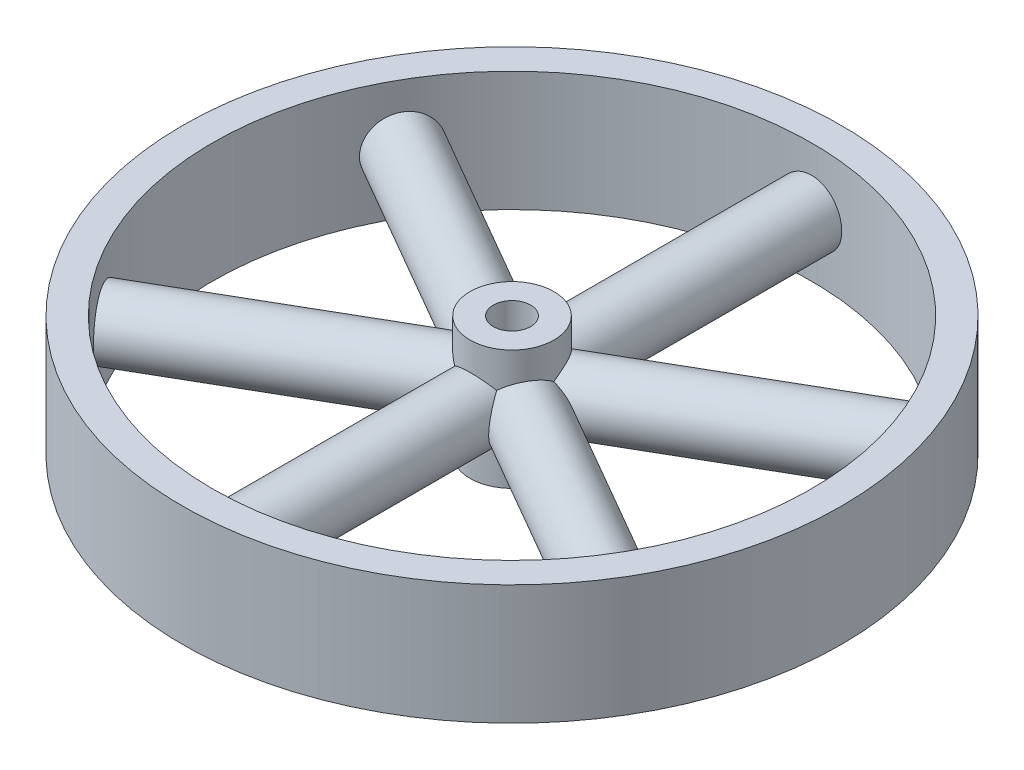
ISO-10303-21;
HEADER;
FILE_DESCRIPTION(('STEP AP214'),'2;1');
FILE_NAME('part.step','',(''),(''),'','','');
FILE_SCHEMA(('AUTOMOTIVE_DESIGN { 1 0 10303 214 1 1 1 1 }'));
ENDSEC;
DATA;
#1=APPLICATION_CONTEXT('core data for automotive mechanical design processes');
#2=APPLICATION_PROTOCOL_DEFINITION('international standard','automotive_design',2000,#1);
#3=PRODUCT_CONTEXT('',#1,'mechanical');
#4=PRODUCT('Part','Part','',(#3));
#5=PRODUCT_RELATED_PRODUCT_CATEGORY('part','',(#4));
#6=PRODUCT_DEFINITION_FORMATION('','',#4);
#7=PRODUCT_DEFINITION_CONTEXT('part definition',#1,'design');
#8=PRODUCT_DEFINITION('design','',#6,#7);
#9=PRODUCT_DEFINITION_SHAPE('','',#8);
#10=(LENGTH_UNIT() NAMED_UNIT(*) SI_UNIT(.MILLI.,.METRE.));
#11=(NAMED_UNIT(*) PLANE_ANGLE_UNIT() SI_UNIT($,.RADIAN.));
#12=(NAMED_UNIT(*) SI_UNIT($,.STERADIAN.) SOLID_ANGLE_UNIT());
#13=UNCERTAINTY_MEASURE_WITH_UNIT(LENGTH_MEASURE(1.E-05),#10,'distance_accuracy_value','');
#14=(GEOMETRIC_REPRESENTATION_CONTEXT(3) GLOBAL_UNCERTAINTY_ASSIGNED_CONTEXT((#13)) GLOBAL_UNIT_ASSIGNED_CONTEXT((#10,
#11,#12)) REPRESENTATION_CONTEXT('',''));
#15=CARTESIAN_POINT('',(0.,0.,0.));
#16=DIRECTION('',(0.,0.,1.));
#17=DIRECTION('',(1.,0.,0.));
#18=AXIS2_PLACEMENT_3D('',#15,#16,#17);
#19=CARTESIAN_POINT('',(0.,12.7,0.));
#20=DIRECTION('',(0.,-1.,0.));
#21=DIRECTION('',(0.,0.,-1.));
#22=AXIS2_PLACEMENT_3D('',#19,#20,#21);
#23=CYLINDRICAL_SURFACE('',#22,8.89510650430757);
#24=CARTESIAN_POINT('',(0.,12.7,0.));
#25=DIRECTION('',(0.,1.,0.));
#26=DIRECTION('',(0.,0.,1.));
#27=AXIS2_PLACEMENT_3D('',#24,#25,#26);
#28=CIRCLE('',#27,8.89510650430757);
#29=CARTESIAN_POINT('',(0.,12.7,8.89510650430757));
#30=VERTEX_POINT('',#29);
#31=EDGE_CURVE('E109',#30,#30,#28,.T.);
#32=ORIENTED_EDGE('',*,*,#31,.F.);
#33=EDGE_LOOP('',(#32));
#34=FACE_BOUND('',#33,.T.);
#35=CARTESIAN_POINT('',(-8.39449774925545,0.,-2.94199375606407));
#36=CARTESIAN_POINT('',(-8.39449336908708,-0.15663829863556,-2.94200001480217));
#37=CARTESIAN_POINT('',(-8.39728738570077,-0.313248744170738,-2.93406827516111));
#38=CARTESIAN_POINT('',(-8.40818052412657,-0.624781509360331,-2.90270542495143));
#39=CARTESIAN_POINT('',(-8.41628188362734,-0.779703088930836,-2.87926777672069));
#40=CARTESIAN_POINT('',(-8.43707300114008,-1.08669092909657,-2.81775846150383));
#41=CARTESIAN_POINT('',(-8.44977493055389,-1.23874847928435,-2.77964795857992));
#42=CARTESIAN_POINT('',(-8.47870876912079,-1.53862398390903,-2.69009778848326));
#43=CARTESIAN_POINT('',(-8.49494345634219,-1.68643849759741,-2.63864762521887));
#44=CARTESIAN_POINT('',(-8.53332188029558,-2.00688437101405,-2.51208109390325));
#45=CARTESIAN_POINT('',(-8.55599461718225,-2.1783868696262,-2.43427503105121));
#46=CARTESIAN_POINT('',(-8.60267711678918,-2.51351414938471,-2.26377384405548));
#47=CARTESIAN_POINT('',(-8.62668666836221,-2.67714016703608,-2.17108106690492));
#48=CARTESIAN_POINT('',(-8.6742134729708,-2.99658283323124,-1.97265314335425));
#49=CARTESIAN_POINT('',(-8.69773012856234,-3.15239029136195,-1.86690313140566));
#50=CARTESIAN_POINT('',(-8.742593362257,-3.45594064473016,-1.64405050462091));
#51=CARTESIAN_POINT('',(-8.7639401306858,-3.60368424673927,-1.52694888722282));
#52=CARTESIAN_POINT('',(-8.80346741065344,-3.89442466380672,-1.27980717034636));
#53=CARTESIAN_POINT('',(-8.82156254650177,-4.03723063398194,-1.14952915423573));
#54=CARTESIAN_POINT('',(-8.85256573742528,-4.31424476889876,-0.879477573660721));
#55=CARTESIAN_POINT('',(-8.86547223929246,-4.44845034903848,-0.739701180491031));
#56=CARTESIAN_POINT('',(-8.88479532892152,-4.70776070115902,-0.451802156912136));
#57=CARTESIAN_POINT('',(-8.8912192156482,-4.83287556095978,-0.303689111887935));
#58=CARTESIAN_POINT('',(-8.89640491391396,-5.0737312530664,0.000198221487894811));
#59=CARTESIAN_POINT('',(-8.89516420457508,-5.18946898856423,0.155975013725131));
#60=CARTESIAN_POINT('',(-8.88411917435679,-5.40621773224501,0.467568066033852));
#61=CARTESIAN_POINT('',(-8.87467628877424,-5.50764285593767,0.623108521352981));
#62=CARTESIAN_POINT('',(-8.84677979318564,-5.70050467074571,0.939476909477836));
#63=CARTESIAN_POINT('',(-8.82832751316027,-5.79194283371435,1.10030405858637));
#64=CARTESIAN_POINT('',(-8.78155051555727,-5.96402523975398,1.42632903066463));
#65=CARTESIAN_POINT('',(-8.75322284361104,-6.04466624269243,1.59152814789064));
#66=CARTESIAN_POINT('',(-8.68597611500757,-6.19414604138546,1.92500687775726));
#67=CARTESIAN_POINT('',(-8.64706228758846,-6.26299063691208,2.09328493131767));
#68=CARTESIAN_POINT('',(-8.55765111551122,-6.38854635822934,2.43324997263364));
#69=CARTESIAN_POINT('',(-8.50704695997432,-6.44513565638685,2.6049541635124));
#70=CARTESIAN_POINT('',(-8.39413639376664,-6.54437534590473,2.94857445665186));
#71=CARTESIAN_POINT('',(-8.33182981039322,-6.58702553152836,3.12049056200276));
#72=CARTESIAN_POINT('',(-8.19558162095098,-6.65751652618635,3.46254447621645));
#73=CARTESIAN_POINT('',(-8.1216522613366,-6.68537278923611,3.63268395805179));
#74=CARTESIAN_POINT('',(-7.96248013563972,-6.72574018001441,3.96944495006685));
#75=CARTESIAN_POINT('',(-7.87723942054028,-6.7382540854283,4.13606709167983));
#76=CARTESIAN_POINT('',(-7.71007243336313,-6.74694690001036,4.43879160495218));
#77=CARTESIAN_POINT('',(-7.62963709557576,-6.74533357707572,4.57566066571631));
#78=CARTESIAN_POINT('',(-7.46184036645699,-6.73094216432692,4.84447664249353));
#79=CARTESIAN_POINT('',(-7.37447925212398,-6.71816452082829,4.97642375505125));
#80=CARTESIAN_POINT('',(-7.19362650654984,-6.68165016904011,5.23445150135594));
#81=CARTESIAN_POINT('',(-7.10013511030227,-6.65791388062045,5.36053235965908));
#82=CARTESIAN_POINT('',(-6.90790636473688,-6.59984719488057,5.60607390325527));
#83=CARTESIAN_POINT('',(-6.80916887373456,-6.56551651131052,5.72553440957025));
#84=CARTESIAN_POINT('',(-6.61054000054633,-6.48797498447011,5.95364003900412));
#85=CARTESIAN_POINT('',(-6.51078085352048,-6.44507479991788,6.06250636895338));
#86=CARTESIAN_POINT('',(-6.30807655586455,-6.35029855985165,6.27315630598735));
#87=CARTESIAN_POINT('',(-6.20513039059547,-6.29841962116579,6.37493762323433));
#88=CARTESIAN_POINT('',(-5.89285512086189,-6.13015346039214,6.66924487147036));
#89=CARTESIAN_POINT('',(-5.67994376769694,-6.0010795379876,6.85089906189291));
#90=CARTESIAN_POINT('',(-5.22296527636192,-5.69461273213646,7.20682408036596));
#91=CARTESIAN_POINT('',(-4.97849385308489,-5.51309157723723,7.37695845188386));
#92=CARTESIAN_POINT('',(-4.49362006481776,-5.11734979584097,7.68195043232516));
#93=CARTESIAN_POINT('',(-4.25322286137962,-4.90309070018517,7.81676602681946));
#94=CARTESIAN_POINT('',(-3.8779976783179,-4.53669701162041,8.00681627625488));
#95=CARTESIAN_POINT('',(-3.73921983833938,-4.39375969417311,8.07237307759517));
#96=CARTESIAN_POINT('',(-3.46783062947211,-4.0976941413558,8.19262315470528));
#97=CARTESIAN_POINT('',(-3.33522075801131,-3.94456345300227,8.24731380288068));
#98=CARTESIAN_POINT('',(-3.07829557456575,-3.62841056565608,8.34661542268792));
#99=CARTESIAN_POINT('',(-2.95397989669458,-3.46538880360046,8.39122683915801));
#100=CARTESIAN_POINT('',(-2.71610928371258,-3.12954626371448,8.47120974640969));
#101=CARTESIAN_POINT('',(-2.60255043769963,-2.95672908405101,8.50658460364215));
#102=CARTESIAN_POINT('',(-2.41902488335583,-2.65103105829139,8.56023741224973));
#103=CARTESIAN_POINT('',(-2.34574465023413,-2.52048634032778,8.58053055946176));
#104=CARTESIAN_POINT('',(-2.20765123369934,-2.25437252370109,8.61709325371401));
#105=CARTESIAN_POINT('',(-2.14284016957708,-2.11880217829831,8.63336179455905));
#106=CARTESIAN_POINT('',(-2.02334014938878,-1.84317260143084,8.66214688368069));
#107=CARTESIAN_POINT('',(-1.96863196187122,-1.70312250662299,8.67467058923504));
#108=CARTESIAN_POINT('',(-1.87082643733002,-1.41882553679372,8.69628903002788));
#109=CARTESIAN_POINT('',(-1.82772157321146,-1.27458145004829,8.70538598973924));
#110=CARTESIAN_POINT('',(-1.7603429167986,-1.00539861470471,8.71923756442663));
#111=CARTESIAN_POINT('',(-1.73418101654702,-0.880955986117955,8.7244480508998));
#112=CARTESIAN_POINT('',(-1.6920109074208,-0.63033173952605,8.73272491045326));
#113=CARTESIAN_POINT('',(-1.67599806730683,-0.504150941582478,8.73579226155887));
#114=CARTESIAN_POINT('',(-1.65465420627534,-0.250910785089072,8.73986035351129));
#115=CARTESIAN_POINT('',(-1.64931798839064,-0.123851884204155,8.74086209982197));
#116=CARTESIAN_POINT('',(-1.64949939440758,0.130259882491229,8.74082782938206));
#117=CARTESIAN_POINT('',(-1.65501729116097,0.257312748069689,8.73979176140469));
#118=CARTESIAN_POINT('',(-1.67669280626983,0.510196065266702,8.73565921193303));
#119=CARTESIAN_POINT('',(-1.6928275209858,0.636028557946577,8.73256716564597));
#120=CARTESIAN_POINT('',(-1.73516539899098,0.885924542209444,8.72425223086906));
#121=CARTESIAN_POINT('',(-1.76137208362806,1.00998739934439,8.71902859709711));
#122=CARTESIAN_POINT('',(-1.85403936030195,1.37874457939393,8.69997020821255));
#123=CARTESIAN_POINT('',(-1.93453193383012,1.61984793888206,8.68275026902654));
#124=CARTESIAN_POINT('',(-2.10000071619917,2.02680675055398,8.64396106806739));
#125=CARTESIAN_POINT('',(-2.17822071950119,2.1957651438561,8.62472946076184));
#126=CARTESIAN_POINT('',(-2.34783726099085,2.52612978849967,8.58010933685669));
#127=CARTESIAN_POINT('',(-2.43923634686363,2.68753457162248,8.55471962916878));
#128=CARTESIAN_POINT('',(-2.63284144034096,3.00283302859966,8.49713381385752));
#129=CARTESIAN_POINT('',(-2.73506788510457,3.15671166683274,8.4649247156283));
#130=CARTESIAN_POINT('',(-2.9480492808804,3.45659208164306,8.39312553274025));
#131=CARTESIAN_POINT('',(-3.05880315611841,3.60259484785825,8.35353637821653));
#132=CARTESIAN_POINT('',(-3.29140578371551,3.89206786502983,8.2647230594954));
#133=CARTESIAN_POINT('',(-3.41351572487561,4.03523351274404,8.21519113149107));
#134=CARTESIAN_POINT('',(-3.66339624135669,4.31292998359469,8.10684905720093));
#135=CARTESIAN_POINT('',(-3.79116850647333,4.44745819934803,8.04803612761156));
#136=CARTESIAN_POINT('',(-4.0507075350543,4.70736539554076,7.92057868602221));
#137=CARTESIAN_POINT('',(-4.18246933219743,4.83275513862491,7.85194603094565));
#138=CARTESIAN_POINT('',(-4.44880814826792,5.07412013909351,7.70416942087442));
#139=CARTESIAN_POINT('',(-4.58338607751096,5.19009229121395,7.62502202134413));
#140=CARTESIAN_POINT('',(-4.84799052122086,5.40701471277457,7.45943567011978));
#141=CARTESIAN_POINT('',(-4.97795585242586,5.50840201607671,7.37347253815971));
#142=CARTESIAN_POINT('',(-5.23795708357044,5.70118879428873,7.19110098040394));
#143=CARTESIAN_POINT('',(-5.36799297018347,5.79258974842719,7.09469410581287));
#144=CARTESIAN_POINT('',(-5.62690915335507,5.96459732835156,6.89114895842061));
#145=CARTESIAN_POINT('',(-5.75578910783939,6.04520085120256,6.78400761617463));
#146=CARTESIAN_POINT('',(-6.01091874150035,6.19460696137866,6.55901547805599));
#147=CARTESIAN_POINT('',(-6.13716968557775,6.26341534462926,6.4411699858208));
#148=CARTESIAN_POINT('',(-6.38682962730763,6.38889983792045,6.19374682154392));
#149=CARTESIAN_POINT('',(-6.51020010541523,6.44545415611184,6.06406809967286));
#150=CARTESIAN_POINT('',(-6.75127207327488,6.54462617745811,5.79447458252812));
#151=CARTESIAN_POINT('',(-6.86897347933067,6.58724367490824,5.65455963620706));
#152=CARTESIAN_POINT('',(-7.09701915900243,6.65767263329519,5.36554601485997));
#153=CARTESIAN_POINT('',(-7.20737094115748,6.6854994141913,5.21645702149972));
#154=CARTESIAN_POINT('',(-7.41937127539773,6.72581129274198,4.91024486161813));
#155=CARTESIAN_POINT('',(-7.5210213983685,6.73829916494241,4.75312315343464));
#156=CARTESIAN_POINT('',(-7.69955948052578,6.74694797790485,4.45700221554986));
#157=CARTESIAN_POINT('',(-7.77785619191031,6.74531526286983,4.31890987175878));
#158=CARTESIAN_POINT('',(-7.92672395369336,6.73088661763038,4.03919047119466));
#159=CARTESIAN_POINT('',(-7.99729531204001,6.71809113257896,3.89756355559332));
#160=CARTESIAN_POINT('',(-8.13029271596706,6.68154290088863,3.61193598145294));
#161=CARTESIAN_POINT('',(-8.19271907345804,6.65779057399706,3.46793541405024));
#162=CARTESIAN_POINT('',(-8.30921639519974,6.59969377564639,3.17870318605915));
#163=CARTESIAN_POINT('',(-8.36328713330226,6.56534901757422,3.033471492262));
#164=CARTESIAN_POINT('',(-8.46149121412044,6.48777835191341,2.74740521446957));
#165=CARTESIAN_POINT('',(-8.50588150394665,6.44486218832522,2.60657448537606));
#166=CARTESIAN_POINT('',(-8.58693511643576,6.35005430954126,2.32569668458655));
#167=CARTESIAN_POINT('',(-8.6235959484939,6.29815971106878,2.18564987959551));
#168=CARTESIAN_POINT('',(-8.72230150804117,6.12984823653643,1.76805608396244));
#169=CARTESIAN_POINT('',(-8.77314026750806,6.0007455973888,1.49284468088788));
#170=CARTESIAN_POINT('',(-8.85284618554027,5.69421453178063,0.919127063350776));
#171=CARTESIAN_POINT('',(-8.8779281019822,5.51265691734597,0.622340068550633));
#172=CARTESIAN_POINT('',(-8.89957839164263,5.11683663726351,0.0499260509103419));
#173=CARTESIAN_POINT('',(-8.89611204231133,4.90253445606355,-0.225674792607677));
#174=CARTESIAN_POINT('',(-8.87305475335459,4.53606498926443,-0.645655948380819));
#175=CARTESIAN_POINT('',(-8.86042739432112,4.39309659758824,-0.79862017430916));
#176=CARTESIAN_POINT('',(-8.82885007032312,4.09697167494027,-1.09377028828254));
#177=CARTESIAN_POINT('',(-8.80989853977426,3.94381262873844,-1.2359534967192));
#178=CARTESIAN_POINT('',(-8.76741278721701,3.62758997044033,-1.5080955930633));
#179=CARTESIAN_POINT('',(-8.7438790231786,3.46452734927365,-1.63805570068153));
#180=CARTESIAN_POINT('',(-8.6942086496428,3.12868098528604,-1.88398592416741));
#181=CARTESIAN_POINT('',(-8.66807305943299,2.95590106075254,-1.99996147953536));
#182=CARTESIAN_POINT('',(-8.60438550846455,2.52613556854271,-2.26101916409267));
#183=CARTESIAN_POINT('',(-8.56662208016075,2.26410655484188,-2.39804277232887));
#184=CARTESIAN_POINT('',(-8.51508405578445,1.85771490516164,-2.57293463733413));
#185=CARTESIAN_POINT('',(-8.49876781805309,1.72015113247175,-2.626091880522));
#186=CARTESIAN_POINT('',(-8.46882705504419,1.44091188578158,-2.72109458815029));
#187=CARTESIAN_POINT('',(-8.45520138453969,1.29923819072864,-2.7629448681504));
#188=CARTESIAN_POINT('',(-8.42788850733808,0.96734946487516,-2.84536272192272));
#189=CARTESIAN_POINT('',(-8.4155264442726,0.775865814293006,-2.88139791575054));
#190=CARTESIAN_POINT('',(-8.39883512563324,0.389573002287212,-2.92970558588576));
#191=CARTESIAN_POINT('',(-8.39450319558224,0.194764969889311,-2.94198597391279));
#192=CARTESIAN_POINT('',(-8.39449774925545,0.,-2.94199375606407));
#193=B_SPLINE_CURVE_WITH_KNOTS('',3,(#35,#36,#37,#38,#39,#40,#41,#42,#43,#44,#45,#46,#47,#48,
#49,#50,#51,#52,#53,#54,#55,#56,#57,#58,#59,#60,#61,#62,#63,#64,#65,#66,#67,#68,#69,#70,#71,#72,
#73,#74,#75,#76,#77,#78,#79,#80,#81,#82,#83,#84,#85,#86,#87,#88,#89,#90,#91,#92,#93,#94,#95,#96,
#97,#98,#99,#100,#101,#102,#103,#104,#105,#106,#107,#108,#109,#110,#111,#112,#113,#114,#115,
#116,#117,#118,#119,#120,#121,#122,#123,#124,#125,#126,#127,#128,#129,#130,#131,#132,#133,#134,
#135,#136,#137,#138,#139,#140,#141,#142,#143,#144,#145,#146,#147,#148,#149,#150,#151,#152,#153,
#154,#155,#156,#157,#158,#159,#160,#161,#162,#163,#164,#165,#166,#167,#168,#169,#170,#171,#172,
#173,#174,#175,#176,#177,#178,#179,#180,#181,#182,#183,#184,#185,#186,#187,#188,#189,#190,#191,
#192),.UNSPECIFIED.,.T.,.F.,(4,2,2,2,2,2,2,2,2,2,2,2,2,2,2,2,2,2,2,2,2,2,2,2,2,2,2,2,2,2,2,2,2,
2,2,2,2,2,2,2,2,2,2,2,2,2,2,2,2,2,2,2,2,2,2,2,2,2,2,2,2,2,2,2,2,2,2,2,2,2,2,2,2,2,2,2,2,2,4),
(0.,0.46964808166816,0.939494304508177,1.41059275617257,1.88206301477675,2.45024274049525,
3.01833297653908,3.58707604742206,4.15576918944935,4.73771465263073,5.31983419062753,
5.90129756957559,6.48295220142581,7.04020585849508,7.59737727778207,8.15471552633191,
8.71177896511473,9.27414886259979,9.83652706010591,10.3983166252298,10.960004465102,
11.4356888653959,11.9113542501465,12.38700141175,12.8626614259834,13.3234731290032,
13.7844330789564,14.7056780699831,15.7484726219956,16.7925020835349,17.4211683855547,
18.0499865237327,18.678776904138,19.3073377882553,19.7602401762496,20.2132556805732,
20.6653997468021,21.1172497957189,21.4986564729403,21.8798889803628,22.2609358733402,
22.6419923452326,23.0222294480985,23.4025996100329,24.1638154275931,24.7246784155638,
25.2856499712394,25.8476999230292,26.4096790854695,26.9929118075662,27.5763197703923,
28.1590291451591,28.7419298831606,29.2991109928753,29.8562094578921,30.4134676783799,
30.9704512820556,31.5327397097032,32.0950364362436,32.6567496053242,33.2183611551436,
33.6940168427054,34.1696535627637,34.645272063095,35.1209034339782,35.5817287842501,
36.0427023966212,36.9639664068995,38.0068158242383,39.0509338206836,39.6796637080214,
40.3085493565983,40.9373721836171,41.5659496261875,42.4569140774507,42.9016272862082,
43.346150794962,43.9303085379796,44.5142716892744),.UNSPECIFIED.);
#194=CARTESIAN_POINT('',(-4.44755325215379,5.07104643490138,7.70338820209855));
#195=VERTEX_POINT('',#194);
#196=CARTESIAN_POINT('',(-8.89510650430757,5.07104643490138,0.));
#197=VERTEX_POINT('',#196);
#198=EDGE_CURVE('E202',#195,#197,#193,.T.);
#199=ORIENTED_EDGE('',*,*,#198,.F.);
#200=CARTESIAN_POINT('',(-6.7450902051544,0.,5.79885142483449));
#201=CARTESIAN_POINT('',(-6.7450934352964,-0.156638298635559,5.79884450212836));
#202=CARTESIAN_POINT('',(-6.73962135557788,-0.313248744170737,5.80523006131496));
#203=CARTESIAN_POINT('',(-6.7179068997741,-0.624781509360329,5.83034522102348));
#204=CARTESIAN_POINT('',(-6.70165998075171,-0.779703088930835,5.8490800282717));
#205=CARTESIAN_POINT('',(-6.6587869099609,-1.08669092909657,5.89784032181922));
#206=CARTESIAN_POINT('',(-6.63213321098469,-1.23874847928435,5.92789576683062));
#207=CARTESIAN_POINT('',(-6.56904740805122,-1.53862398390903,5.99772829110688));
#208=CARTESIAN_POINT('',(-6.53260760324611,-1.68643849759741,6.0375130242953));
#209=CARTESIAN_POINT('',(-6.4421869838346,-2.00688437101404,6.13403298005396));
#210=CARTESIAN_POINT('',(-6.38614132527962,-2.17838686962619,6.19257117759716));
#211=CARTESIAN_POINT('',(-6.26182421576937,-2.51351414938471,6.31825000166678));
#212=CARTESIAN_POINT('',(-6.19355469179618,-2.67714016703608,6.38538927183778));
#213=CARTESIAN_POINT('',(-6.04547447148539,-2.99658283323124,6.52576265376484));
#214=CARTESIAN_POINT('',(-5.96565060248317,-3.15239029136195,6.59900368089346));
#215=CARTESIAN_POINT('',(-5.79508618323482,-3.45594064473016,6.74928269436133));
#216=CARTESIAN_POINT('',(-5.70434659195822,-3.60368424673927,6.82632034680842));
#217=CARTESIAN_POINT('',(-5.51007922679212,-3.89442466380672,6.98412283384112));
#218=CARTESIAN_POINT('',(-5.40630272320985,-4.03723063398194,7.06493268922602));
#219=CARTESIAN_POINT('',(-5.18793278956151,-4.31424476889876,7.22680803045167));
#220=CARTESIAN_POINT('',(-5.07333613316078,-4.44845034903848,7.30787358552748));
#221=CARTESIAN_POINT('',(-4.83366980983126,-4.70776070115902,7.4685573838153));
#222=CARTESIAN_POINT('',(-4.70861209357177,-4.83287556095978,7.54817715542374));
#223=CARTESIAN_POINT('',(-4.44803079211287,-5.0737312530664,7.70461176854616));
#224=CARTESIAN_POINT('',(-4.31250377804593,-5.18946898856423,7.78142567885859));
#225=CARTESIAN_POINT('',(-4.0371337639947,-5.40621773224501,7.92765692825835));
#226=CARTESIAN_POINT('',(-3.89771033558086,-5.50764285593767,7.99724937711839));
#227=CARTESIAN_POINT('',(-3.6097790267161,-5.70050467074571,8.13127449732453));
#228=CARTESIAN_POINT('',(-3.46127248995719,-5.79194283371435,8.19570792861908));
#229=CARTESIAN_POINT('',(-3.15553808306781,-5.96402523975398,8.31821034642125));
#230=CARTESIAN_POINT('',(-2.99830761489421,-6.04466624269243,8.37627742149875));
#231=CARTESIAN_POINT('',(-2.67588319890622,-6.19414604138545,8.48477941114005));
#232=CARTESIAN_POINT('',(-2.51069321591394,-6.26299063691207,8.53521807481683));
#233=CARTESIAN_POINT('',(-2.17156926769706,-6.38854635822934,8.62776824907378));
#234=CARTESIAN_POINT('',(-1.99756699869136,-6.44513565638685,8.66979586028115));
#235=CARTESIAN_POINT('',(-1.64352781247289,-6.54437534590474,8.74382258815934));
#236=CARTESIAN_POINT('',(-1.46349080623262,-6.58702553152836,8.77582155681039));
#237=CARTESIAN_POINT('',(-1.09913933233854,-6.65751652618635,8.82885412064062));
#238=CARTESIAN_POINT('',(-0.914829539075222,-6.68537278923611,8.84989915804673));
#239=CARTESIAN_POINT('',(-0.543599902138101,-6.7257401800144,8.88043254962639));
#240=CARTESIAN_POINT('',(-0.356680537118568,-6.7382540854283,8.88992299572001));
#241=CARTESIAN_POINT('',(-0.0109299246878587,-6.74694690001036,8.89651439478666));
#242=CARTESIAN_POINT('',(0.147819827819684,-6.74533357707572,8.89528987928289));
#243=CARTESIAN_POINT('',(0.464519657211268,-6.73094216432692,8.88438163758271));
#244=CARTESIAN_POINT('',(0.622469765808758,-6.71816452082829,8.87469824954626));
#245=CARTESIAN_POINT('',(0.936354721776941,-6.68165016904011,8.84708905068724));
#246=CARTESIAN_POINT('',(1.09228964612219,-6.65791388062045,8.82916355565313));
#247=CARTESIAN_POINT('',(1.40104923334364,-6.59984719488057,8.78545935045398));
#248=CARTESIAN_POINT('',(1.55387381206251,-6.56551651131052,8.75968042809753));
#249=CARTESIAN_POINT('',(1.8507335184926,-6.48797498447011,8.70171559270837));
#250=CARTESIAN_POINT('',(1.99489409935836,-6.44507479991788,8.66975480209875));
#251=CARTESIAN_POINT('',(2.27867444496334,-6.35029855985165,8.59953269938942));
#252=CARTESIAN_POINT('',(2.4182927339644,-6.29841962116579,8.56126936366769));
#253=CARTESIAN_POINT('',(2.82930792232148,-6.13015346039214,8.43798467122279));
#254=CARTESIAN_POINT('',(3.09308074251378,-6.0010795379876,8.34442512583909));
#255=CARTESIAN_POINT('',(3.6298100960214,-5.69461273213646,8.12663265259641));
#256=CARTESIAN_POINT('',(3.89938649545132,-5.51309157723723,7.99998137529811));
#257=CARTESIAN_POINT('',(4.40595419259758,-5.11734979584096,7.73256434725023));
#258=CARTESIAN_POINT('',(4.64290652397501,-4.90309070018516,7.59178205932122));
#259=CARTESIAN_POINT('',(4.99510745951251,-4.53669701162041,7.36185264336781));
#260=CARTESIAN_POINT('',(5.12127023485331,-4.39375969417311,7.27444590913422));
#261=CARTESIAN_POINT('',(5.36110446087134,-4.09769414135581,7.09954099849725));
#262=CARTESIAN_POINT('',(5.47477288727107,-3.94456345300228,7.01204280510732));
#263=CARTESIAN_POINT('',(5.68923320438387,-3.62841056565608,6.8391898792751));
#264=CARTESIAN_POINT('',(5.79002566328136,-3.46538880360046,6.75383505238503));
#265=CARTESIAN_POINT('',(5.97822819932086,-3.12954626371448,6.58782451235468));
#266=CARTESIAN_POINT('',(6.06564314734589,-2.95672908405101,6.50716709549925));
#267=CARTESIAN_POINT('',(6.20387061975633,-2.65103105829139,6.37505570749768));
#268=CARTESIAN_POINT('',(6.25808511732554,-2.52048634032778,6.32173973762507));
#269=CARTESIAN_POINT('',(6.35879604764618,-2.25437252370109,6.22042867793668));
#270=CARTESIAN_POINT('',(6.40529054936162,-2.11880217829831,6.17243492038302));
#271=CARTESIAN_POINT('',(6.48996917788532,-1.84317260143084,6.08333741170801));
#272=CARTESIAN_POINT('',(6.52816911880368,-1.703122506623,6.04222058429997));
#273=CARTESIAN_POINT('',(6.59579399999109,-1.41882553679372,5.96832773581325));
#274=CARTESIAN_POINT('',(6.6252246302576,-1.27458145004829,5.93554630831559));
#275=CARTESIAN_POINT('',(6.67090977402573,-1.00539861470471,5.88412046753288));
#276=CARTESIAN_POINT('',(6.68850313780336,-0.880955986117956,5.86406884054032));
#277=CARTESIAN_POINT('',(6.71675616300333,-0.630331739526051,5.83168688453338));
#278=CARTESIAN_POINT('',(6.7274189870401,-0.504150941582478,5.81935303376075));
#279=CARTESIAN_POINT('',(6.74161398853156,-0.250910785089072,5.80290275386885));
#280=CARTESIAN_POINT('',(6.74514963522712,-0.123851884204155,5.79878232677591));
#281=CARTESIAN_POINT('',(6.74502925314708,0.130259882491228,5.79892229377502));
#282=CARTESIAN_POINT('',(6.74137304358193,0.257312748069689,5.80318289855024));
#283=CARTESIAN_POINT('',(6.72695639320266,0.510196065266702,5.81988817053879));
#284=CARTESIAN_POINT('',(6.7162112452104,0.636028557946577,5.83231522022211));
#285=CARTESIAN_POINT('',(6.68784136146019,0.885924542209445,5.86482343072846));
#286=CARTESIAN_POINT('',(6.67021421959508,1.00998739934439,5.88490726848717));
#287=CARTESIAN_POINT('',(6.6073755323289,1.37874457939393,5.95563028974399));
#288=CARTESIAN_POINT('',(6.55221634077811,1.61984793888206,6.01672893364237));
#289=CARTESIAN_POINT('',(6.43588951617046,2.02680675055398,6.14063450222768));
#290=CARTESIAN_POINT('',(6.38012445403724,2.1957651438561,6.19875920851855));
#291=CARTESIAN_POINT('',(6.25667402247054,2.52612978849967,6.32334138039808));
#292=CARTESIAN_POINT('',(6.18898634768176,2.68753457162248,6.38980045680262));
#293=CARTESIAN_POINT('',(6.0423130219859,3.00283302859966,6.52867447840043));
#294=CARTESIAN_POINT('',(5.96330590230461,3.15671166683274,6.60110062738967));
#295=CARTESIAN_POINT('',(5.79463528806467,3.45659208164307,6.74964833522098));
#296=CARTESIAN_POINT('',(5.70497313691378,3.60259484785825,6.82576942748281));
#297=CARTESIAN_POINT('',(5.51175723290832,3.89206786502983,6.98280255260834));
#298=CARTESIAN_POINT('',(5.40780635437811,4.03523351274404,7.06378689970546));
#299=CARTESIAN_POINT('',(5.18903910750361,4.31292998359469,7.22601873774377));
#300=CARTESIAN_POINT('',(5.07421948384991,4.44745819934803,7.30726630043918));
#301=CARTESIAN_POINT('',(4.83406858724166,4.70736539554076,7.46830497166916));
#302=CARTESIAN_POINT('',(4.70875006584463,4.83275513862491,7.54809770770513));
#303=CARTESIAN_POINT('',(4.44760235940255,5.07412013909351,7.70486558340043));
#304=CARTESIAN_POINT('',(4.31176973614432,5.19009229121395,7.78183978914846));
#305=CARTESIAN_POINT('',(4.03606552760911,5.40701471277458,7.92820078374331));
#306=CARTESIAN_POINT('',(3.89663660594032,5.50840201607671,7.99777249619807));
#307=CARTESIAN_POINT('',(3.60869758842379,5.70118879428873,8.13175438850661));
#308=CARTESIAN_POINT('',(3.46018884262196,5.7925897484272,8.19616533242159));
#309=CARTESIAN_POINT('',(3.15445548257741,5.96459732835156,8.31862075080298));
#310=CARTESIAN_POINT('',(2.99722838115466,6.04520085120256,8.37666339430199));
#311=CARTESIAN_POINT('',(2.67481465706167,6.19460696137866,8.48511606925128));
#312=CARTESIAN_POINT('',(2.50963199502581,6.26341534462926,8.53552984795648));
#313=CARTESIAN_POINT('',(2.17052727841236,6.38889983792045,8.62803011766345));
#314=CARTESIAN_POINT('',(1.99653697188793,6.44545415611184,8.67003272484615));
#315=CARTESIAN_POINT('',(1.64252615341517,6.54462617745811,8.74401041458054));
#316=CARTESIAN_POINT('',(1.46250555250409,6.58724367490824,8.77598534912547));
#317=CARTESIAN_POINT('',(1.0981895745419,6.65767263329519,8.82897189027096));
#318=CARTESIAN_POINT('',(0.913898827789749,6.6854994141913,8.84999484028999));
#319=CARTESIAN_POINT('',(0.542711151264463,6.72581129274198,8.88048643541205));
#320=CARTESIAN_POINT('',(0.355814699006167,6.73829916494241,8.8899571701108));
#321=CARTESIAN_POINT('',(0.010097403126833,6.74694797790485,8.89651521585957));
#322=CARTESIAN_POINT('',(-0.148642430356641,6.74531526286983,8.89527598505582));
#323=CARTESIAN_POINT('',(-0.465320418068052,6.73088661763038,8.8843395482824));
#324=CARTESIAN_POINT('',(-0.623258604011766,6.71809113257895,8.87464267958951));
#325=CARTESIAN_POINT('',(-0.937118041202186,6.68154290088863,8.84700802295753));
#326=CARTESIAN_POINT('',(-1.09303936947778,6.65779057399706,8.82907055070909));
#327=CARTESIAN_POINT('',(-1.4017704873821,6.59969377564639,8.7853440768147));
#328=CARTESIAN_POINT('',(-1.55458019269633,6.56534901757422,8.75955486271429));
#329=CARTESIAN_POINT('',(-1.85142289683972,6.48777835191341,8.70156895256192));
#330=CARTESIAN_POINT('',(-1.99558103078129,6.44486218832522,8.66959670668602));
#331=CARTESIAN_POINT('',(-2.27935514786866,6.35005430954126,8.59935229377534));
#332=CARTESIAN_POINT('',(-2.41896965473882,6.29815971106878,8.56107810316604));
#333=CARTESIAN_POINT('',(-2.82996926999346,6.12984823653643,8.4377627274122));
#334=CARTESIAN_POINT('',(-3.09372871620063,6.0007455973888,8.34418468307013));
#335=CARTESIAN_POINT('',(-3.63043570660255,5.69421453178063,8.12635322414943));
#336=CARTESIAN_POINT('',(-3.90000174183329,5.51265691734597,7.99968130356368));
#337=CARTESIAN_POINT('',(-4.40655196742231,5.11683663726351,7.73222399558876));
#338=CARTESIAN_POINT('',(-4.64349612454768,4.90253445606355,7.59142162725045));
#339=CARTESIAN_POINT('',(-4.9956818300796,4.53606498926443,7.36146285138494));
#340=CARTESIAN_POINT('',(-5.12183905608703,4.39309659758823,7.27404512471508));
#341=CARTESIAN_POINT('',(-5.36165789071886,4.09697167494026,7.09912330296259));
#342=CARTESIAN_POINT('',(-5.47531639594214,3.94381262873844,7.01161919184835));
#343=CARTESIAN_POINT('',(-5.68975548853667,3.62758997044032,6.83875440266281));
#344=CARTESIAN_POINT('',(-5.79053736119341,3.46452734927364,6.75339351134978));
#345=CARTESIAN_POINT('',(-5.97868399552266,3.12868098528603,6.58741259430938));
#346=CARTESIAN_POINT('',(-6.06605397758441,2.95590106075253,6.5067907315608));
#347=CARTESIAN_POINT('',(-6.26029278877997,2.52613556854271,6.32110685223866));
#348=CARTESIAN_POINT('',(-6.36007700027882,2.26410655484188,6.21989095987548));
#349=CARTESIAN_POINT('',(-6.48576878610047,1.85771490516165,6.08781178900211));
#350=CARTESIAN_POINT('',(-6.52364619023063,1.72015113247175,6.04710289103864));
#351=CARTESIAN_POINT('',(-6.59095056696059,1.44091188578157,5.97367207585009));
#352=CARTESIAN_POINT('',(-6.62038113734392,1.29923819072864,5.94094675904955));
#353=CARTESIAN_POINT('',(-6.67810065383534,0.967349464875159,5.87608418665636));
#354=CARTESIAN_POINT('',(-6.70312701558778,0.775865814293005,5.84736072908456));
#355=CARTESIAN_POINT('',(-6.73661702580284,0.38957300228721,5.8087517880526));
#356=CARTESIAN_POINT('',(-6.74508618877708,0.19476496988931,5.79886003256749));
#357=CARTESIAN_POINT('',(-6.7450902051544,0.,5.79885142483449));
#358=B_SPLINE_CURVE_WITH_KNOTS('',3,(#200,#201,#202,#203,#204,#205,#206,#207,#208,#209,#210,
#211,#212,#213,#214,#215,#216,#217,#218,#219,#220,#221,#222,#223,#224,#225,#226,#227,#228,#229,
#230,#231,#232,#233,#234,#235,#236,#237,#238,#239,#240,#241,#242,#243,#244,#245,#246,#247,#248,
#249,#250,#251,#252,#253,#254,#255,#256,#257,#258,#259,#260,#261,#262,#263,#264,#265,#266,#267,
#268,#269,#270,#271,#272,#273,#274,#275,#276,#277,#278,#279,#280,#281,#282,#283,#284,#285,#286,
#287,#288,#289,#290,#291,#292,#293,#294,#295,#296,#297,#298,#299,#300,#301,#302,#303,#304,#305,
#306,#307,#308,#309,#310,#311,#312,#313,#314,#315,#316,#317,#318,#319,#320,#321,#322,#323,#324,
#325,#326,#327,#328,#329,#330,#331,#332,#333,#334,#335,#336,#337,#338,#339,#340,#341,#342,#343,
#344,#345,#346,#347,#348,#349,#350,#351,#352,#353,#354,#355,#356,#357),.UNSPECIFIED.,.T.,.F.,(4,
2,2,2,2,2,2,2,2,2,2,2,2,2,2,2,2,2,2,2,2,2,2,2,2,2,2,2,2,2,2,2,2,2,2,2,2,2,2,2,2,2,2,2,2,2,2,2,2,
2,2,2,2,2,2,2,2,2,2,2,2,2,2,2,2,2,2,2,2,2,2,2,2,2,2,2,2,2,4),(0.,0.469648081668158,
0.939494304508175,1.41059275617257,1.88206301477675,2.45024274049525,3.01833297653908,
3.58707604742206,4.15576918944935,4.73771465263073,5.31983419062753,5.90129756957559,
6.48295220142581,7.04020585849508,7.59737727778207,8.15471552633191,8.71177896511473,
9.27414886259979,9.83652706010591,10.3983166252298,10.960004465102,11.4356888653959,
11.9113542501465,12.38700141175,12.8626614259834,13.3234731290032,13.7844330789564,
14.7056780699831,15.7484726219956,16.7925020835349,17.4211683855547,18.0499865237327,
18.678776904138,19.3073377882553,19.7602401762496,20.2132556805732,20.6653997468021,
21.1172497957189,21.4986564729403,21.8798889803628,22.2609358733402,22.6419923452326,
23.0222294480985,23.4025996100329,24.1638154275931,24.7246784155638,25.2856499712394,
25.8476999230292,26.4096790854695,26.9929118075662,27.5763197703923,28.1590291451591,
28.7419298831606,29.2991109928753,29.8562094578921,30.4134676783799,30.9704512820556,
31.5327397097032,32.0950364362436,32.6567496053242,33.2183611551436,33.6940168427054,
34.1696535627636,34.6452720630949,35.1209034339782,35.5817287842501,36.0427023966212,
36.9639664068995,38.0068158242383,39.0509338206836,39.6796637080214,40.3085493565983,
40.9373721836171,41.5659496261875,42.4569140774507,42.9016272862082,43.346150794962,
43.9303085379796,44.5142716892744),.UNSPECIFIED.);
#359=CARTESIAN_POINT('',(4.44755325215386,5.07104643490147,7.7033882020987));
#360=VERTEX_POINT('',#359);
#361=EDGE_CURVE('E90',#360,#195,#358,.T.);
#362=ORIENTED_EDGE('',*,*,#361,.F.);
#363=CARTESIAN_POINT('',(1.64940754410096,0.,8.74084518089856));
#364=CARTESIAN_POINT('',(1.64939993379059,-0.15663829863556,8.74084451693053));
#365=CARTESIAN_POINT('',(1.6576660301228,-0.313248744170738,8.73929833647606));
#366=CARTESIAN_POINT('',(1.69027362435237,-0.62478150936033,8.73305064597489));
#367=CARTESIAN_POINT('',(1.71462190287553,-0.779703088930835,8.72834780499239));
#368=CARTESIAN_POINT('',(1.77828609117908,-1.08669092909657,8.71559878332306));
#369=CARTESIAN_POINT('',(1.8176417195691,-1.23874847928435,8.70754372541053));
#370=CARTESIAN_POINT('',(1.90966136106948,-1.53862398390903,8.68782607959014));
#371=CARTESIAN_POINT('',(1.96233585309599,-1.68643849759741,8.67616064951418));
#372=CARTESIAN_POINT('',(2.09113489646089,-2.00688437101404,8.64611407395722));
#373=CARTESIAN_POINT('',(2.16985329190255,-2.17838686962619,8.62684620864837));
#374=CARTESIAN_POINT('',(2.34085290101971,-2.51351414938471,8.58202384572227));
#375=CARTESIAN_POINT('',(2.43313197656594,-2.67714016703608,8.5564703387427));
#376=CARTESIAN_POINT('',(2.62873900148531,-2.99658283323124,8.49841579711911));
#377=CARTESIAN_POINT('',(2.73207952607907,-3.15239029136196,8.46590681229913));
#378=CARTESIAN_POINT('',(2.94750717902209,-3.45594064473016,8.39333319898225));
#379=CARTESIAN_POINT('',(3.05959353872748,-3.60368424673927,8.35326923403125));
#380=CARTESIAN_POINT('',(3.29338818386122,-3.89442466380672,8.2639300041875));
#381=CARTESIAN_POINT('',(3.41525982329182,-4.03723063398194,8.21446184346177));
#382=CARTESIAN_POINT('',(3.66463294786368,-4.31424476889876,8.10628560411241));
#383=CARTESIAN_POINT('',(3.79213610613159,-4.44845034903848,8.04757476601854));
#384=CARTESIAN_POINT('',(4.05112551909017,-4.70776070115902,7.92035954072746));
#385=CARTESIAN_POINT('',(4.18260712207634,-4.83287556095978,7.8518662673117));
#386=CARTESIAN_POINT('',(4.448374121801,-5.0737312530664,7.7044135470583));
#387=CARTESIAN_POINT('',(4.58266042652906,-5.18946898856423,7.6254506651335));
#388=CARTESIAN_POINT('',(4.846985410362,-5.40621773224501,7.46008886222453));
#389=CARTESIAN_POINT('',(4.97696595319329,-5.50764285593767,7.37414085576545));
#390=CARTESIAN_POINT('',(5.23700076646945,-5.70050467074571,7.19179758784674));
#391=CARTESIAN_POINT('',(5.36705502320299,-5.79194283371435,7.09540387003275));
#392=CARTESIAN_POINT('',(5.62601243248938,-5.96402523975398,6.89188131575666));
#393=CARTESIAN_POINT('',(5.75491522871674,-6.04466624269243,6.78474927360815));
#394=CARTESIAN_POINT('',(6.01009291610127,-6.19414604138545,6.55977253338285));
#395=CARTESIAN_POINT('',(6.13636907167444,-6.26299063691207,6.44193314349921));
#396=CARTESIAN_POINT('',(6.38608184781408,-6.38854635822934,6.19451827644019));
#397=CARTESIAN_POINT('',(6.50947996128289,-6.44513565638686,6.0648416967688));
#398=CARTESIAN_POINT('',(6.75060858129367,-6.54437534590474,5.79524813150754));
#399=CARTESIAN_POINT('',(6.86833900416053,-6.58702553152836,5.65533099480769));
#400=CARTESIAN_POINT('',(7.09644228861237,-6.65751652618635,5.36630964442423));
#401=CARTESIAN_POINT('',(7.20682272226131,-6.68537278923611,5.217215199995));
#402=CARTESIAN_POINT('',(7.41888023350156,-6.72574018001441,4.91098759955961));
#403=CARTESIAN_POINT('',(7.52055888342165,-6.7382540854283,4.75385590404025));
#404=CARTESIAN_POINT('',(7.69914250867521,-6.74694690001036,4.45772278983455));
#405=CARTESIAN_POINT('',(7.77745692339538,-6.74533357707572,4.31962921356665));
#406=CARTESIAN_POINT('',(7.9263600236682,-6.73094216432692,4.03990499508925));
#407=CARTESIAN_POINT('',(7.99694901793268,-6.71816452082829,3.89827449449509));
#408=CARTESIAN_POINT('',(8.12998122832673,-6.68165016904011,3.61263754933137));
#409=CARTESIAN_POINT('',(8.1924247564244,-6.65791388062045,3.46863119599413));
#410=CARTESIAN_POINT('',(8.30895559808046,-6.59984719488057,3.17938544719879));
#411=CARTESIAN_POINT('',(8.36304268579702,-6.56551651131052,3.03414601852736));
#412=CARTESIAN_POINT('',(8.46127351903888,-6.48797498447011,2.74807555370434));
#413=CARTESIAN_POINT('',(8.5056749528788,-6.44507479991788,2.60724843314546));
#414=CARTESIAN_POINT('',(8.58675100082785,-6.35029855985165,2.32637639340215));
#415=CARTESIAN_POINT('',(8.62342312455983,-6.29841962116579,2.18633174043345));
#416=CARTESIAN_POINT('',(8.72216304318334,-6.13015346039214,1.76873979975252));
#417=CARTESIAN_POINT('',(8.77302451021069,-6.0010795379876,1.49352606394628));
#418=CARTESIAN_POINT('',(8.8527753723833,-5.69461273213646,0.919808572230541));
#419=CARTESIAN_POINT('',(8.87788034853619,-5.51309157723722,0.623022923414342));
#420=CARTESIAN_POINT('',(8.89957425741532,-5.11734979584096,0.0506139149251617));
#421=CARTESIAN_POINT('',(8.89612938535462,-4.90309070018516,-0.224983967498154));
#422=CARTESIAN_POINT('',(8.8731051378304,-4.53669701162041,-0.644963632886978));
#423=CARTESIAN_POINT('',(8.86049007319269,-4.39375969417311,-0.797927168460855));
#424=CARTESIAN_POINT('',(8.82893509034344,-4.09769414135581,-1.09308215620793));
#425=CARTESIAN_POINT('',(8.80999364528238,-3.94456345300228,-1.23527099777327));
#426=CARTESIAN_POINT('',(8.76752877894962,-3.62841056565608,-1.50742554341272));
#427=CARTESIAN_POINT('',(8.74400555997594,-3.46538880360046,-1.63739178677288));
#428=CARTESIAN_POINT('',(8.69433748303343,-3.12954626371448,-1.88338523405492));
#429=CARTESIAN_POINT('',(8.66819358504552,-2.95672908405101,-1.99941750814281));
#430=CARTESIAN_POINT('',(8.62289550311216,-2.65103105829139,-2.18518170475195));
#431=CARTESIAN_POINT('',(8.60382976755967,-2.52048634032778,-2.2587908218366));
#432=CARTESIAN_POINT('',(8.56644728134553,-2.25437252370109,-2.39666457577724));
#433=CARTESIAN_POINT('',(8.54813071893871,-2.11880217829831,-2.46092687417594));
#434=CARTESIAN_POINT('',(8.5133093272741,-1.84317260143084,-2.57880947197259));
#435=CARTESIAN_POINT('',(8.4968010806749,-1.70312250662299,-2.63245000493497));
#436=CARTESIAN_POINT('',(8.46662043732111,-1.41882553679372,-2.72796129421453));
#437=CARTESIAN_POINT('',(8.45294620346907,-1.27458145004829,-2.76983968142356));
#438=CARTESIAN_POINT('',(8.43125269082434,-1.00539861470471,-2.83511709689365));
#439=CARTESIAN_POINT('',(8.4226841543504,-0.880955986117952,-2.86037921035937));
#440=CARTESIAN_POINT('',(8.40876707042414,-0.630331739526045,-2.90103802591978));
#441=CARTESIAN_POINT('',(8.40341705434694,-0.504150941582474,-2.91643922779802));
#442=CARTESIAN_POINT('',(8.39626819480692,-0.250910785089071,-2.93695759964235));
#443=CARTESIAN_POINT('',(8.39446762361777,-0.123851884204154,-2.94207977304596));
#444=CARTESIAN_POINT('',(8.39452864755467,0.130259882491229,-2.94190553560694));
#445=CARTESIAN_POINT('',(8.39639033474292,0.257312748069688,-2.93660886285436));
#446=CARTESIAN_POINT('',(8.4036491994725,0.510196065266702,-2.91577104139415));
#447=CARTESIAN_POINT('',(8.40903876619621,0.636028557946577,-2.90025194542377));
#448=CARTESIAN_POINT('',(8.42300676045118,0.885924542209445,-2.8594288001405));
#449=CARTESIAN_POINT('',(8.43158630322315,1.00998739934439,-2.83412132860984));
#450=CARTESIAN_POINT('',(8.46141489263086,1.37874457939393,-2.74433991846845));
#451=CARTESIAN_POINT('',(8.48674827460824,1.61984793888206,-2.66602133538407));
#452=CARTESIAN_POINT('',(8.53589023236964,2.02680675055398,-2.50332656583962));
#453=CARTESIAN_POINT('',(8.55834517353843,2.1957651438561,-2.4259702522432));
#454=CARTESIAN_POINT('',(8.60451128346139,2.52612978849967,-2.25676795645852));
#455=CARTESIAN_POINT('',(8.62822269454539,2.68753457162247,-2.16491917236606));
#456=CARTESIAN_POINT('',(8.67515446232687,3.00283302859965,-1.96845933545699));
#457=CARTESIAN_POINT('',(8.69837378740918,3.15671166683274,-1.86382408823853));
#458=CARTESIAN_POINT('',(8.74268456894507,3.45659208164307,-1.64347719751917));
#459=CARTESIAN_POINT('',(8.76377629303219,3.60259484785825,-1.52776695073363));
#460=CARTESIAN_POINT('',(8.80316301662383,3.89206786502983,-1.28192050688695));
#461=CARTESIAN_POINT('',(8.82132207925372,4.03523351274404,-1.15140423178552));
#462=CARTESIAN_POINT('',(8.85243534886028,4.31292998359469,-0.88083031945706));
#463=CARTESIAN_POINT('',(8.86538799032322,4.44745819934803,-0.740769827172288));
#464=CARTESIAN_POINT('',(8.88477612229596,4.70736539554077,-0.452273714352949));
#465=CARTESIAN_POINT('',(8.89121939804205,4.83275513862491,-0.303848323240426));
#466=CARTESIAN_POINT('',(8.89641050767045,5.07412013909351,0.000696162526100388));
#467=CARTESIAN_POINT('',(8.89515581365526,5.19009229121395,0.156817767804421));
#468=CARTESIAN_POINT('',(8.88405604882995,5.40701471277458,0.468765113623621));
#469=CARTESIAN_POINT('',(8.87459245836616,5.50840201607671,0.624299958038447));
#470=CARTESIAN_POINT('',(8.84665467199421,5.70118879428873,0.940653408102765));
#471=CARTESIAN_POINT('',(8.82818181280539,5.79258974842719,1.10147122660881));
#472=CARTESIAN_POINT('',(8.78136463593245,5.96459732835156,1.42747179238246));
#473=CARTESIAN_POINT('',(8.75301748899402,6.04520085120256,1.59265577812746));
#474=CARTESIAN_POINT('',(8.68573339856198,6.19460696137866,1.92610059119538));
#475=CARTESIAN_POINT('',(8.64680168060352,6.26341534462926,2.09435986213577));
#476=CARTESIAN_POINT('',(8.55735690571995,6.38889983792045,2.43428329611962));
#477=CARTESIAN_POINT('',(8.50673707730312,6.44545415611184,2.60596462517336));
#478=CARTESIAN_POINT('',(8.39379822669,6.54462617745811,2.9495358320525));
#479=CARTESIAN_POINT('',(8.33147903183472,6.58724367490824,3.12142571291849));
#480=CARTESIAN_POINT('',(8.19520873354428,6.65767263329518,3.46342587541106));
#481=CARTESIAN_POINT('',(8.12126976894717,6.6854994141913,3.63353781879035));
#482=CARTESIAN_POINT('',(7.96208242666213,6.72581129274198,3.97024157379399));
#483=CARTESIAN_POINT('',(7.87683609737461,6.73829916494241,4.13683401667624));
#484=CARTESIAN_POINT('',(7.70965688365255,6.74694797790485,4.43951300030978));
#485=CARTESIAN_POINT('',(7.62921376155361,6.74531526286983,4.5763661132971));
#486=CARTESIAN_POINT('',(7.46140353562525,6.73088661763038,4.84514907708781));
#487=CARTESIAN_POINT('',(7.37403670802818,6.71809113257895,4.97707912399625));
#488=CARTESIAN_POINT('',(7.1931746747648,6.68154290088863,5.23507204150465));
#489=CARTESIAN_POINT('',(7.09967970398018,6.65779057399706,5.36113513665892));
#490=CARTESIAN_POINT('',(6.90744590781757,6.59969377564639,5.60664089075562));
#491=CARTESIAN_POINT('',(6.80870694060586,6.56534901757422,5.72608337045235));
#492=CARTESIAN_POINT('',(6.61006831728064,6.48777835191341,5.95416373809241));
#493=CARTESIAN_POINT('',(6.51030047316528,6.44486218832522,6.06302222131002));
#494=CARTESIAN_POINT('',(6.30757996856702,6.35005430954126,6.27365560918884));
#495=CARTESIAN_POINT('',(6.204626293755,6.29815971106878,6.37542822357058));
#496=CARTESIAN_POINT('',(5.89233223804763,6.12984823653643,6.66970664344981));
#497=CARTESIAN_POINT('',(5.67941155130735,6.0007455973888,6.85134000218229));
#498=CARTESIAN_POINT('',(5.22241047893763,5.69421453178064,7.2072261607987));
#499=CARTESIAN_POINT('',(4.97792636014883,5.51265691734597,7.37734123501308));
#500=CARTESIAN_POINT('',(4.49302642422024,5.11683663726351,7.68229794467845));
#501=CARTESIAN_POINT('',(4.25261591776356,4.90253445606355,7.81709641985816));
#502=CARTESIAN_POINT('',(3.87737292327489,4.53606498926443,8.00711879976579));
#503=CARTESIAN_POINT('',(3.73858833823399,4.39309659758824,8.07266529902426));
#504=CARTESIAN_POINT('',(3.46719217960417,4.09697167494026,8.19289359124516));
#505=CARTESIAN_POINT('',(3.33458214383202,3.94381262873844,8.24757268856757));
#506=CARTESIAN_POINT('',(3.07765729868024,3.62758997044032,8.34684999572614));
#507=CARTESIAN_POINT('',(2.95334166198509,3.46452734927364,8.39144921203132));
#508=CARTESIAN_POINT('',(2.71552465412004,3.12868098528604,8.4713985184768));
#509=CARTESIAN_POINT('',(2.60201908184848,2.95590106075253,8.50675221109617));
#510=CARTESIAN_POINT('',(2.34409271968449,2.52613556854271,8.58212601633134));
#511=CARTESIAN_POINT('',(2.20654507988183,2.26410655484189,8.61793373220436));
#512=CARTESIAN_POINT('',(2.02931526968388,1.85771490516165,8.66074642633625));
#513=CARTESIAN_POINT('',(1.97512162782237,1.72015113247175,8.67319477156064));
#514=CARTESIAN_POINT('',(1.87787648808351,1.44091188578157,8.69476666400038));
#515=CARTESIAN_POINT('',(1.83482024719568,1.29923819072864,8.70389162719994));
#516=CARTESIAN_POINT('',(1.74978785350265,0.96734946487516,8.72144690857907));
#517=CARTESIAN_POINT('',(1.71239942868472,0.775865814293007,8.72875864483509));
#518=CARTESIAN_POINT('',(1.6622180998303,0.389573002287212,8.73845737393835));
#519=CARTESIAN_POINT('',(1.64941700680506,0.19476496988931,8.74084600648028));
#520=CARTESIAN_POINT('',(1.64940754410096,0.,8.74084518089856));
#521=B_SPLINE_CURVE_WITH_KNOTS('',3,(#363,#364,#365,#366,#367,#368,#369,#370,#371,#372,#373,
#374,#375,#376,#377,#378,#379,#380,#381,#382,#383,#384,#385,#386,#387,#388,#389,#390,#391,#392,
#393,#394,#395,#396,#397,#398,#399,#400,#401,#402,#403,#404,#405,#406,#407,#408,#409,#410,#411,
#412,#413,#414,#415,#416,#417,#418,#419,#420,#421,#422,#423,#424,#425,#426,#427,#428,#429,#430,
#431,#432,#433,#434,#435,#436,#437,#438,#439,#440,#441,#442,#443,#444,#445,#446,#447,#448,#449,
#450,#451,#452,#453,#454,#455,#456,#457,#458,#459,#460,#461,#462,#463,#464,#465,#466,#467,#468,
#469,#470,#471,#472,#473,#474,#475,#476,#477,#478,#479,#480,#481,#482,#483,#484,#485,#486,#487,
#488,#489,#490,#491,#492,#493,#494,#495,#496,#497,#498,#499,#500,#501,#502,#503,#504,#505,#506,
#507,#508,#509,#510,#511,#512,#513,#514,#515,#516,#517,#518,#519,#520),.UNSPECIFIED.,.T.,.F.,(4,
2,2,2,2,2,2,2,2,2,2,2,2,2,2,2,2,2,2,2,2,2,2,2,2,2,2,2,2,2,2,2,2,2,2,2,2,2,2,2,2,2,2,2,2,2,2,2,2,
2,2,2,2,2,2,2,2,2,2,2,2,2,2,2,2,2,2,2,2,2,2,2,2,2,2,2,2,2,4),(0.,0.46964808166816,
0.939494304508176,1.41059275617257,1.88206301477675,2.45024274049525,3.01833297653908,
3.58707604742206,4.15576918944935,4.73771465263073,5.31983419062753,5.90129756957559,
6.48295220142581,7.04020585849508,7.59737727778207,8.15471552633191,8.71177896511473,
9.27414886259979,9.83652706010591,10.3983166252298,10.960004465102,11.4356888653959,
11.9113542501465,12.38700141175,12.8626614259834,13.3234731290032,13.7844330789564,
14.7056780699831,15.7484726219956,16.7925020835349,17.4211683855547,18.0499865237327,
18.6787769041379,19.3073377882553,19.7602401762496,20.2132556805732,20.6653997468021,
21.1172497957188,21.4986564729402,21.8798889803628,22.2609358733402,22.6419923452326,
23.0222294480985,23.4025996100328,24.1638154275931,24.7246784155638,25.2856499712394,
25.8476999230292,26.4096790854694,26.9929118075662,27.5763197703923,28.1590291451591,
28.7419298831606,29.2991109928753,29.8562094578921,30.4134676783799,30.9704512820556,
31.5327397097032,32.0950364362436,32.6567496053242,33.2183611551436,33.6940168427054,
34.1696535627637,34.645272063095,35.1209034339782,35.5817287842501,36.0427023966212,
36.9639664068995,38.0068158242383,39.0509338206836,39.6796637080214,40.3085493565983,
40.9373721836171,41.5659496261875,42.4569140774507,42.9016272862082,43.346150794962,
43.9303085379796,44.5142716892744),.UNSPECIFIED.);
#522=CARTESIAN_POINT('',(8.89510650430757,5.07104643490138,0.));
#523=VERTEX_POINT('',#522);
#524=EDGE_CURVE('E100',#523,#360,#521,.T.);
#525=ORIENTED_EDGE('',*,*,#524,.F.);
#526=CARTESIAN_POINT('',(8.39449774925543,0.,2.94199375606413));
#527=CARTESIAN_POINT('',(8.39449336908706,-0.156638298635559,2.94200001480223));
#528=CARTESIAN_POINT('',(8.39728738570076,-0.313248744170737,2.93406827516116));
#529=CARTESIAN_POINT('',(8.40818052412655,-0.62478150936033,2.90270542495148));
#530=CARTESIAN_POINT('',(8.41628188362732,-0.779703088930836,2.87926777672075));
#531=CARTESIAN_POINT('',(8.43707300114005,-1.08669092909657,2.8177584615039));
#532=CARTESIAN_POINT('',(8.44977493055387,-1.23874847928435,2.77964795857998));
#533=CARTESIAN_POINT('',(8.47870876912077,-1.53862398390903,2.69009778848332));
#534=CARTESIAN_POINT('',(8.49494345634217,-1.68643849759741,2.63864762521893));
#535=CARTESIAN_POINT('',(8.53332188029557,-2.00688437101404,2.51208109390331));
#536=CARTESIAN_POINT('',(8.55599461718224,-2.17838686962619,2.43427503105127));
#537=CARTESIAN_POINT('',(8.60267711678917,-2.51351414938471,2.26377384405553));
#538=CARTESIAN_POINT('',(8.6266866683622,-2.67714016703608,2.17108106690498));
#539=CARTESIAN_POINT('',(8.67421347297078,-2.99658283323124,1.97265314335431));
#540=CARTESIAN_POINT('',(8.69773012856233,-3.15239029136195,1.86690313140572));
#541=CARTESIAN_POINT('',(8.74259336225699,-3.45594064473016,1.64405050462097));
#542=CARTESIAN_POINT('',(8.76394013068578,-3.60368424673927,1.52694888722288));
#543=CARTESIAN_POINT('',(8.80346741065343,-3.89442466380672,1.27980717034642));
#544=CARTESIAN_POINT('',(8.82156254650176,-4.03723063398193,1.14952915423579));
#545=CARTESIAN_POINT('',(8.85256573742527,-4.31424476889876,0.879477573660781));
#546=CARTESIAN_POINT('',(8.86547223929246,-4.44845034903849,0.739701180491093));
#547=CARTESIAN_POINT('',(8.88479532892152,-4.70776070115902,0.451802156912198));
#548=CARTESIAN_POINT('',(8.8912192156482,-4.83287556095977,0.303689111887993));
#549=CARTESIAN_POINT('',(8.89640491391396,-5.0737312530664,-0.000198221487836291));
#550=CARTESIAN_POINT('',(8.89516420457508,-5.18946898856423,-0.15597501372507));
#551=CARTESIAN_POINT('',(8.88411917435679,-5.40621773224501,-0.467568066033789));
#552=CARTESIAN_POINT('',(8.87467628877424,-5.50764285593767,-0.623108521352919));
#553=CARTESIAN_POINT('',(8.84677979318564,-5.70050467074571,-0.939476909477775));
#554=CARTESIAN_POINT('',(8.82832751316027,-5.79194283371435,-1.10030405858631));
#555=CARTESIAN_POINT('',(8.78155051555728,-5.96402523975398,-1.42632903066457));
#556=CARTESIAN_POINT('',(8.75322284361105,-6.04466624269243,-1.59152814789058));
#557=CARTESIAN_POINT('',(8.68597611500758,-6.19414604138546,-1.9250068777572));
#558=CARTESIAN_POINT('',(8.64706228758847,-6.26299063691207,-2.09328493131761));
#559=CARTESIAN_POINT('',(8.55765111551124,-6.38854635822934,-2.43324997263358));
#560=CARTESIAN_POINT('',(8.50704695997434,-6.44513565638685,-2.60495416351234));
#561=CARTESIAN_POINT('',(8.39413639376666,-6.54437534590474,-2.9485744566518));
#562=CARTESIAN_POINT('',(8.33182981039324,-6.58702553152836,-3.1204905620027));
#563=CARTESIAN_POINT('',(8.195581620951,-6.65751652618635,-3.4625444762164));
#564=CARTESIAN_POINT('',(8.12165226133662,-6.68537278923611,-3.63268395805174));
#565=CARTESIAN_POINT('',(7.96248013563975,-6.72574018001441,-3.96944495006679));
#566=CARTESIAN_POINT('',(7.87723942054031,-6.7382540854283,-4.13606709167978));
#567=CARTESIAN_POINT('',(7.71007243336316,-6.74694690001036,-4.43879160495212));
#568=CARTESIAN_POINT('',(7.62963709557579,-6.74533357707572,-4.57566066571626));
#569=CARTESIAN_POINT('',(7.46184036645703,-6.73094216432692,-4.84447664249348));
#570=CARTESIAN_POINT('',(7.37447925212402,-6.71816452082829,-4.9764237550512));
#571=CARTESIAN_POINT('',(7.19362650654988,-6.68165016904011,-5.23445150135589));
#572=CARTESIAN_POINT('',(7.10013511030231,-6.65791388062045,-5.36053235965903));
#573=CARTESIAN_POINT('',(6.90790636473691,-6.59984719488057,-5.60607390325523));
#574=CARTESIAN_POINT('',(6.8091688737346,-6.56551651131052,-5.7255344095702));
#575=CARTESIAN_POINT('',(6.61054000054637,-6.48797498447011,-5.95364003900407));
#576=CARTESIAN_POINT('',(6.51078085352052,-6.44507479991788,-6.06250636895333));
#577=CARTESIAN_POINT('',(6.30807655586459,-6.35029855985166,-6.27315630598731));
#578=CARTESIAN_POINT('',(6.20513039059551,-6.29841962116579,-6.37493762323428));
#579=CARTESIAN_POINT('',(5.89285512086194,-6.13015346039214,-6.66924487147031));
#580=CARTESIAN_POINT('',(5.67994376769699,-6.00107953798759,-6.85089906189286));
#581=CARTESIAN_POINT('',(5.22296527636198,-5.69461273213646,-7.20682408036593));
#582=CARTESIAN_POINT('',(4.97849385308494,-5.51309157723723,-7.37695845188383));
#583=CARTESIAN_POINT('',(4.49362006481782,-5.11734979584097,-7.68195043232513));
#584=CARTESIAN_POINT('',(4.25322286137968,-4.90309070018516,-7.81676602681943));
#585=CARTESIAN_POINT('',(3.87799767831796,-4.53669701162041,-8.00681627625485));
#586=CARTESIAN_POINT('',(3.73921983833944,-4.39375969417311,-8.07237307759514));
#587=CARTESIAN_POINT('',(3.46783062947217,-4.09769414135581,-8.19262315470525));
#588=CARTESIAN_POINT('',(3.33522075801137,-3.94456345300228,-8.24731380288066));
#589=CARTESIAN_POINT('',(3.07829557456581,-3.62841056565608,-8.3466154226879));
#590=CARTESIAN_POINT('',(2.95397989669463,-3.46538880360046,-8.39122683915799));
#591=CARTESIAN_POINT('',(2.71610928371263,-3.12954626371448,-8.47120974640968));
#592=CARTESIAN_POINT('',(2.60255043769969,-2.95672908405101,-8.50658460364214));
#593=CARTESIAN_POINT('',(2.41902488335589,-2.65103105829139,-8.56023741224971));
#594=CARTESIAN_POINT('',(2.34574465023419,-2.52048634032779,-8.58053055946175));
#595=CARTESIAN_POINT('',(2.2076512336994,-2.25437252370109,-8.617093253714));
#596=CARTESIAN_POINT('',(2.14284016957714,-2.11880217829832,-8.63336179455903));
#597=CARTESIAN_POINT('',(2.02334014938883,-1.84317260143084,-8.66214688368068));
#598=CARTESIAN_POINT('',(1.96863196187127,-1.703122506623,-8.67467058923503));
#599=CARTESIAN_POINT('',(1.87082643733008,-1.41882553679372,-8.69628903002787));
#600=CARTESIAN_POINT('',(1.82772157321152,-1.27458145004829,-8.70538598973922));
#601=CARTESIAN_POINT('',(1.76034291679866,-1.00539861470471,-8.71923756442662));
#602=CARTESIAN_POINT('',(1.73418101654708,-0.880955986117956,-8.72444805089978));
#603=CARTESIAN_POINT('',(1.69201090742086,-0.630331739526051,-8.73272491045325));
#604=CARTESIAN_POINT('',(1.67599806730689,-0.504150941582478,-8.73579226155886));
#605=CARTESIAN_POINT('',(1.6546542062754,-0.250910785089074,-8.73986035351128));
#606=CARTESIAN_POINT('',(1.6493179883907,-0.123851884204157,-8.74086209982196));
#607=CARTESIAN_POINT('',(1.64949939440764,0.130259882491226,-8.74082782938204));
#608=CARTESIAN_POINT('',(1.65501729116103,0.257312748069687,-8.73979176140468));
#609=CARTESIAN_POINT('',(1.67669280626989,0.510196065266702,-8.73565921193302));
#610=CARTESIAN_POINT('',(1.69282752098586,0.636028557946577,-8.73256716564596));
#611=CARTESIAN_POINT('',(1.73516539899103,0.885924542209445,-8.72425223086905));
#612=CARTESIAN_POINT('',(1.76137208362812,1.00998739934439,-8.7190285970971));
#613=CARTESIAN_POINT('',(1.85403936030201,1.37874457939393,-8.69997020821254));
#614=CARTESIAN_POINT('',(1.93453193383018,1.61984793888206,-8.68275026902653));
#615=CARTESIAN_POINT('',(2.10000071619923,2.02680675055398,-8.64396106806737));
#616=CARTESIAN_POINT('',(2.17822071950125,2.1957651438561,-8.62472946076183));
#617=CARTESIAN_POINT('',(2.34783726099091,2.52612978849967,-8.58010933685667));
#618=CARTESIAN_POINT('',(2.43923634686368,2.68753457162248,-8.55471962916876));
#619=CARTESIAN_POINT('',(2.63284144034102,3.00283302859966,-8.4971338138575));
#620=CARTESIAN_POINT('',(2.73506788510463,3.15671166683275,-8.46492471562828));
#621=CARTESIAN_POINT('',(2.94804928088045,3.45659208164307,-8.39312553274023));
#622=CARTESIAN_POINT('',(3.05880315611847,3.60259484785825,-8.35353637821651));
#623=CARTESIAN_POINT('',(3.29140578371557,3.89206786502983,-8.26472305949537));
#624=CARTESIAN_POINT('',(3.41351572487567,4.03523351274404,-8.21519113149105));
#625=CARTESIAN_POINT('',(3.66339624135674,4.31292998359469,-8.10684905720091));
#626=CARTESIAN_POINT('',(3.79116850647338,4.44745819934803,-8.04803612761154));
#627=CARTESIAN_POINT('',(4.05070753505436,4.70736539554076,-7.92057868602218));
#628=CARTESIAN_POINT('',(4.18246933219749,4.83275513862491,-7.85194603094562));
#629=CARTESIAN_POINT('',(4.44880814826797,5.07412013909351,-7.70416942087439));
#630=CARTESIAN_POINT('',(4.58338607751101,5.19009229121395,-7.6250220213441));
#631=CARTESIAN_POINT('',(4.84799052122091,5.40701471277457,-7.45943567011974));
#632=CARTESIAN_POINT('',(4.97795585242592,5.5084020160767,-7.37347253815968));
#633=CARTESIAN_POINT('',(5.23795708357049,5.70118879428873,-7.1911009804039));
#634=CARTESIAN_POINT('',(5.36799297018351,5.79258974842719,-7.09469410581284));
#635=CARTESIAN_POINT('',(5.62690915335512,5.96459732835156,-6.89114895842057));
#636=CARTESIAN_POINT('',(5.75578910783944,6.04520085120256,-6.78400761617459));
#637=CARTESIAN_POINT('',(6.0109187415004,6.19460696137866,-6.55901547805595));
#638=CARTESIAN_POINT('',(6.13716968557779,6.26341534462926,-6.44116998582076));
#639=CARTESIAN_POINT('',(6.38682962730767,6.38889983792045,-6.19374682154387));
#640=CARTESIAN_POINT('',(6.51020010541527,6.44545415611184,-6.06406809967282));
#641=CARTESIAN_POINT('',(6.75127207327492,6.54462617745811,-5.79447458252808));
#642=CARTESIAN_POINT('',(6.86897347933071,6.58724367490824,-5.65455963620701));
#643=CARTESIAN_POINT('',(7.09701915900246,6.65767263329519,-5.36554601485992));
#644=CARTESIAN_POINT('',(7.20737094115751,6.6854994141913,-5.21645702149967));
#645=CARTESIAN_POINT('',(7.41937127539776,6.72581129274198,-4.91024486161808));
#646=CARTESIAN_POINT('',(7.52102139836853,6.73829916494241,-4.75312315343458));
#647=CARTESIAN_POINT('',(7.69955948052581,6.74694797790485,-4.4570022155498));
#648=CARTESIAN_POINT('',(7.77785619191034,6.74531526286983,-4.31890987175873));
#649=CARTESIAN_POINT('',(7.92672395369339,6.73088661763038,-4.0391904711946));
#650=CARTESIAN_POINT('',(7.99729531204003,6.71809113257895,-3.89756355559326));
#651=CARTESIAN_POINT('',(8.13029271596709,6.68154290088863,-3.61193598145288));
#652=CARTESIAN_POINT('',(8.19271907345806,6.65779057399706,-3.46793541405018));
#653=CARTESIAN_POINT('',(8.30921639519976,6.59969377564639,-3.17870318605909));
#654=CARTESIAN_POINT('',(8.36328713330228,6.56534901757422,-3.03347149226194));
#655=CARTESIAN_POINT('',(8.46149121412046,6.48777835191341,-2.74740521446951));
#656=CARTESIAN_POINT('',(8.50588150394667,6.44486218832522,-2.606574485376));
#657=CARTESIAN_POINT('',(8.58693511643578,6.35005430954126,-2.32569668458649));
#658=CARTESIAN_POINT('',(8.62359594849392,6.29815971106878,-2.18564987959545));
#659=CARTESIAN_POINT('',(8.72230150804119,6.12984823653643,-1.76805608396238));
#660=CARTESIAN_POINT('',(8.77314026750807,6.0007455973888,-1.49284468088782));
#661=CARTESIAN_POINT('',(8.85284618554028,5.69421453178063,-0.919127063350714));
#662=CARTESIAN_POINT('',(8.87792810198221,5.51265691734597,-0.622340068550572));
#663=CARTESIAN_POINT('',(8.89957839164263,5.11683663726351,-0.0499260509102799));
#664=CARTESIAN_POINT('',(8.89611204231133,4.90253445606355,0.22567479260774));
#665=CARTESIAN_POINT('',(8.87305475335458,4.53606498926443,0.645655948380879));
#666=CARTESIAN_POINT('',(8.86042739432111,4.39309659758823,0.798620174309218));
#667=CARTESIAN_POINT('',(8.82885007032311,4.09697167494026,1.0937702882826));
#668=CARTESIAN_POINT('',(8.80989853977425,3.94381262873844,1.23595349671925));
#669=CARTESIAN_POINT('',(8.767412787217,3.62758997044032,1.50809559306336));
#670=CARTESIAN_POINT('',(8.74387902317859,3.46452734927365,1.63805570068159));
#671=CARTESIAN_POINT('',(8.69420864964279,3.12868098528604,1.88398592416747));
#672=CARTESIAN_POINT('',(8.66807305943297,2.95590106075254,1.99996147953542));
#673=CARTESIAN_POINT('',(8.60438550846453,2.52613556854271,2.26101916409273));
#674=CARTESIAN_POINT('',(8.56662208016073,2.26410655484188,2.39804277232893));
#675=CARTESIAN_POINT('',(8.51508405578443,1.85771490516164,2.5729346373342));
#676=CARTESIAN_POINT('',(8.49876781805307,1.72015113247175,2.62609188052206));
#677=CARTESIAN_POINT('',(8.46882705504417,1.44091188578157,2.72109458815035));
#678=CARTESIAN_POINT('',(8.45520138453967,1.29923819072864,2.76294486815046));
#679=CARTESIAN_POINT('',(8.42788850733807,0.967349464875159,2.84536272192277));
#680=CARTESIAN_POINT('',(8.41552644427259,0.775865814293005,2.88139791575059));
#681=CARTESIAN_POINT('',(8.39883512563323,0.389573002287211,2.9297055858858));
#682=CARTESIAN_POINT('',(8.39450319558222,0.19476496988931,2.94198597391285));
#683=CARTESIAN_POINT('',(8.39449774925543,0.,2.94199375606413));
#684=B_SPLINE_CURVE_WITH_KNOTS('',3,(#526,#527,#528,#529,#530,#531,#532,#533,#534,#535,#536,
#537,#538,#539,#540,#541,#542,#543,#544,#545,#546,#547,#548,#549,#550,#551,#552,#553,#554,#555,
#556,#557,#558,#559,#560,#561,#562,#563,#564,#565,#566,#567,#568,#569,#570,#571,#572,#573,#574,
#575,#576,#577,#578,#579,#580,#581,#582,#583,#584,#585,#586,#587,#588,#589,#590,#591,#592,#593,
#594,#595,#596,#597,#598,#599,#600,#601,#602,#603,#604,#605,#606,#607,#608,#609,#610,#611,#612,
#613,#614,#615,#616,#617,#618,#619,#620,#621,#622,#623,#624,#625,#626,#627,#628,#629,#630,#631,
#632,#633,#634,#635,#636,#637,#638,#639,#640,#641,#642,#643,#644,#645,#646,#647,#648,#649,#650,
#651,#652,#653,#654,#655,#656,#657,#658,#659,#660,#661,#662,#663,#664,#665,#666,#667,#668,#669,
#670,#671,#672,#673,#674,#675,#676,#677,#678,#679,#680,#681,#682,#683),.UNSPECIFIED.,.T.,.F.,(4,
2,2,2,2,2,2,2,2,2,2,2,2,2,2,2,2,2,2,2,2,2,2,2,2,2,2,2,2,2,2,2,2,2,2,2,2,2,2,2,2,2,2,2,2,2,2,2,2,
2,2,2,2,2,2,2,2,2,2,2,2,2,2,2,2,2,2,2,2,2,2,2,2,2,2,2,2,2,4),(0.,0.469648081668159,
0.939494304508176,1.41059275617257,1.88206301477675,2.45024274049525,3.01833297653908,
3.58707604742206,4.15576918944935,4.73771465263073,5.31983419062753,5.90129756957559,
6.48295220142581,7.04020585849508,7.59737727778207,8.15471552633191,8.71177896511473,
9.27414886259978,9.83652706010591,10.3983166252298,10.960004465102,11.4356888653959,
11.9113542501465,12.38700141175,12.8626614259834,13.3234731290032,13.7844330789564,
14.7056780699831,15.7484726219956,16.7925020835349,17.4211683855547,18.0499865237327,
18.6787769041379,19.3073377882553,19.7602401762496,20.2132556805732,20.6653997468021,
21.1172497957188,21.4986564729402,21.8798889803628,22.2609358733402,22.6419923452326,
23.0222294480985,23.4025996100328,24.1638154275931,24.7246784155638,25.2856499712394,
25.8476999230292,26.4096790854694,26.9929118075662,27.5763197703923,28.1590291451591,
28.7419298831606,29.2991109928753,29.8562094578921,30.4134676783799,30.9704512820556,
31.5327397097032,32.0950364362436,32.6567496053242,33.2183611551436,33.6940168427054,
34.1696535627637,34.645272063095,35.1209034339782,35.5817287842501,36.0427023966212,
36.9639664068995,38.0068158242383,39.0509338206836,39.6796637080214,40.3085493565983,
40.9373721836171,41.5659496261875,42.4569140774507,42.9016272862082,43.346150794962,
43.9303085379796,44.5142716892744),.UNSPECIFIED.);
#685=CARTESIAN_POINT('',(4.44755325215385,5.07104643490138,-7.70338820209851));
#686=VERTEX_POINT('',#685);
#687=EDGE_CURVE('E173',#686,#523,#684,.T.);
#688=ORIENTED_EDGE('',*,*,#687,.F.);
#689=CARTESIAN_POINT('',(6.74509020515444,0.,-5.79885142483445));
#690=CARTESIAN_POINT('',(6.74509343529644,-0.156638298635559,-5.79884450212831));
#691=CARTESIAN_POINT('',(6.73962135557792,-0.313248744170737,-5.80523006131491));
#692=CARTESIAN_POINT('',(6.71790689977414,-0.624781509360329,-5.83034522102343));
#693=CARTESIAN_POINT('',(6.70165998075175,-0.779703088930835,-5.84908002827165));
#694=CARTESIAN_POINT('',(6.65878690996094,-1.08669092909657,-5.89784032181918));
#695=CARTESIAN_POINT('',(6.63213321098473,-1.23874847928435,-5.92789576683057));
#696=CARTESIAN_POINT('',(6.56904740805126,-1.53862398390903,-5.99772829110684));
#697=CARTESIAN_POINT('',(6.53260760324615,-1.68643849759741,-6.03751302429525));
#698=CARTESIAN_POINT('',(6.44218698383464,-2.00688437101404,-6.13403298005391));
#699=CARTESIAN_POINT('',(6.38614132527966,-2.17838686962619,-6.19257117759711));
#700=CARTESIAN_POINT('',(6.26182421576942,-2.51351414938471,-6.31825000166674));
#701=CARTESIAN_POINT('',(6.19355469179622,-2.67714016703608,-6.38538927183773));
#702=CARTESIAN_POINT('',(6.04547447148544,-2.99658283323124,-6.5257626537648));
#703=CARTESIAN_POINT('',(5.96565060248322,-3.15239029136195,-6.59900368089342));
#704=CARTESIAN_POINT('',(5.79508618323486,-3.45594064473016,-6.74928269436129));
#705=CARTESIAN_POINT('',(5.70434659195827,-3.60368424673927,-6.82632034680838));
#706=CARTESIAN_POINT('',(5.51007922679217,-3.89442466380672,-6.98412283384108));
#707=CARTESIAN_POINT('',(5.4063027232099,-4.03723063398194,-7.06493268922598));
#708=CARTESIAN_POINT('',(5.18793278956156,-4.31424476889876,-7.22680803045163));
#709=CARTESIAN_POINT('',(5.07333613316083,-4.44845034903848,-7.30787358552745));
#710=CARTESIAN_POINT('',(4.83366980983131,-4.70776070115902,-7.46855738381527));
#711=CARTESIAN_POINT('',(4.70861209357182,-4.83287556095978,-7.5481771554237));
#712=CARTESIAN_POINT('',(4.44803079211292,-5.0737312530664,-7.70461176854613));
#713=CARTESIAN_POINT('',(4.31250377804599,-5.18946898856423,-7.78142567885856));
#714=CARTESIAN_POINT('',(4.03713376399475,-5.40621773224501,-7.92765692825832));
#715=CARTESIAN_POINT('',(3.89771033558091,-5.50764285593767,-7.99724937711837));
#716=CARTESIAN_POINT('',(3.60977902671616,-5.70050467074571,-8.13127449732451));
#717=CARTESIAN_POINT('',(3.46127248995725,-5.79194283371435,-8.19570792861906));
#718=CARTESIAN_POINT('',(3.15553808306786,-5.96402523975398,-8.31821034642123));
#719=CARTESIAN_POINT('',(2.99830761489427,-6.04466624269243,-8.37627742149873));
#720=CARTESIAN_POINT('',(2.67588319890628,-6.19414604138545,-8.48477941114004));
#721=CARTESIAN_POINT('',(2.510693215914,-6.26299063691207,-8.53521807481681));
#722=CARTESIAN_POINT('',(2.17156926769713,-6.38854635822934,-8.62776824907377));
#723=CARTESIAN_POINT('',(1.99756699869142,-6.44513565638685,-8.66979586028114));
#724=CARTESIAN_POINT('',(1.64352781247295,-6.54437534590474,-8.74382258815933));
#725=CARTESIAN_POINT('',(1.46349080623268,-6.58702553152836,-8.77582155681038));
#726=CARTESIAN_POINT('',(1.0991393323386,-6.65751652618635,-8.82885412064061));
#727=CARTESIAN_POINT('',(0.914829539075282,-6.68537278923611,-8.84989915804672));
#728=CARTESIAN_POINT('',(0.543599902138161,-6.72574018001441,-8.88043254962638));
#729=CARTESIAN_POINT('',(0.35668053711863,-6.7382540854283,-8.88992299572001));
#730=CARTESIAN_POINT('',(0.0109299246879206,-6.74694690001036,-8.89651439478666));
#731=CARTESIAN_POINT('',(-0.147819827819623,-6.74533357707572,-8.89528987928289));
#732=CARTESIAN_POINT('',(-0.464519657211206,-6.73094216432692,-8.88438163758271));
#733=CARTESIAN_POINT('',(-0.622469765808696,-6.71816452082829,-8.87469824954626));
#734=CARTESIAN_POINT('',(-0.936354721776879,-6.68165016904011,-8.84708905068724));
#735=CARTESIAN_POINT('',(-1.09228964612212,-6.65791388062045,-8.82916355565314));
#736=CARTESIAN_POINT('',(-1.40104923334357,-6.59984719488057,-8.78545935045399));
#737=CARTESIAN_POINT('',(-1.55387381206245,-6.56551651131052,-8.75968042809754));
#738=CARTESIAN_POINT('',(-1.85073351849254,-6.48797498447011,-8.70171559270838));
#739=CARTESIAN_POINT('',(-1.9948940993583,-6.44507479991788,-8.66975480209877));
#740=CARTESIAN_POINT('',(-2.27867444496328,-6.35029855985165,-8.59953269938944));
#741=CARTESIAN_POINT('',(-2.41829273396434,-6.29841962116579,-8.56126936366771));
#742=CARTESIAN_POINT('',(-2.82930792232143,-6.13015346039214,-8.43798467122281));
#743=CARTESIAN_POINT('',(-3.09308074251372,-6.0010795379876,-8.34442512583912));
#744=CARTESIAN_POINT('',(-3.62981009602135,-5.69461273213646,-8.12663265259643));
#745=CARTESIAN_POINT('',(-3.89938649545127,-5.51309157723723,-7.99998137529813));
#746=CARTESIAN_POINT('',(-4.40595419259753,-5.11734979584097,-7.73256434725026));
#747=CARTESIAN_POINT('',(-4.64290652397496,-4.90309070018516,-7.59178205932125));
#748=CARTESIAN_POINT('',(-4.99510745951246,-4.53669701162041,-7.36185264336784));
#749=CARTESIAN_POINT('',(-5.12127023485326,-4.39375969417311,-7.27444590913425));
#750=CARTESIAN_POINT('',(-5.36110446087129,-4.09769414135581,-7.09954099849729));
#751=CARTESIAN_POINT('',(-5.47477288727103,-3.94456345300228,-7.01204280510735));
#752=CARTESIAN_POINT('',(-5.68923320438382,-3.62841056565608,-6.83918987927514));
#753=CARTESIAN_POINT('',(-5.79002566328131,-3.46538880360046,-6.75383505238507));
#754=CARTESIAN_POINT('',(-5.97822819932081,-3.12954626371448,-6.58782451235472));
#755=CARTESIAN_POINT('',(-6.06564314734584,-2.95672908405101,-6.50716709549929));
#756=CARTESIAN_POINT('',(-6.20387061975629,-2.65103105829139,-6.37505570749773));
#757=CARTESIAN_POINT('',(-6.25808511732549,-2.52048634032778,-6.32173973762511));
#758=CARTESIAN_POINT('',(-6.35879604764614,-2.25437252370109,-6.22042867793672));
#759=CARTESIAN_POINT('',(-6.40529054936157,-2.11880217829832,-6.17243492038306));
#760=CARTESIAN_POINT('',(-6.48996917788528,-1.84317260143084,-6.08333741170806));
#761=CARTESIAN_POINT('',(-6.52816911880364,-1.703122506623,-6.04222058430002));
#762=CARTESIAN_POINT('',(-6.59579399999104,-1.41882553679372,-5.9683277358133));
#763=CARTESIAN_POINT('',(-6.62522463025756,-1.27458145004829,-5.93554630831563));
#764=CARTESIAN_POINT('',(-6.67090977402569,-1.00539861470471,-5.88412046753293));
#765=CARTESIAN_POINT('',(-6.68850313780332,-0.880955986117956,-5.86406884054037));
#766=CARTESIAN_POINT('',(-6.71675616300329,-0.630331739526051,-5.83168688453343));
#767=CARTESIAN_POINT('',(-6.72741898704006,-0.504150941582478,-5.8193530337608));
#768=CARTESIAN_POINT('',(-6.74161398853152,-0.250910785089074,-5.8029027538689));
#769=CARTESIAN_POINT('',(-6.74514963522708,-0.123851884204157,-5.79878232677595));
#770=CARTESIAN_POINT('',(-6.74502925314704,0.130259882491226,-5.79892229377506));
#771=CARTESIAN_POINT('',(-6.74137304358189,0.257312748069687,-5.80318289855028));
#772=CARTESIAN_POINT('',(-6.72695639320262,0.510196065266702,-5.81988817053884));
#773=CARTESIAN_POINT('',(-6.71621124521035,0.636028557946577,-5.83231522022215));
#774=CARTESIAN_POINT('',(-6.68784136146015,0.885924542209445,-5.8648234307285));
#775=CARTESIAN_POINT('',(-6.67021421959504,1.00998739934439,-5.88490726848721));
#776=CARTESIAN_POINT('',(-6.60737553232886,1.37874457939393,-5.95563028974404));
#777=CARTESIAN_POINT('',(-6.55221634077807,1.61984793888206,-6.01672893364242));
#778=CARTESIAN_POINT('',(-6.43588951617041,2.02680675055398,-6.14063450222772));
#779=CARTESIAN_POINT('',(-6.38012445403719,2.1957651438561,-6.1987592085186));
#780=CARTESIAN_POINT('',(-6.25667402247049,2.52612978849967,-6.32334138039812));
#781=CARTESIAN_POINT('',(-6.18898634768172,2.68753457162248,-6.38980045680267));
#782=CARTESIAN_POINT('',(-6.04231302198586,3.00283302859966,-6.52867447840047));
#783=CARTESIAN_POINT('',(-5.96330590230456,3.15671166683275,-6.60110062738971));
#784=CARTESIAN_POINT('',(-5.79463528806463,3.45659208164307,-6.74964833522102));
#785=CARTESIAN_POINT('',(-5.70497313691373,3.60259484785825,-6.82576942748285));
#786=CARTESIAN_POINT('',(-5.51175723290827,3.89206786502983,-6.98280255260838));
#787=CARTESIAN_POINT('',(-5.40780635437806,4.03523351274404,-7.0637868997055));
#788=CARTESIAN_POINT('',(-5.18903910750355,4.31292998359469,-7.22601873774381));
#789=CARTESIAN_POINT('',(-5.07421948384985,4.44745819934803,-7.30726630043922));
#790=CARTESIAN_POINT('',(-4.83406858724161,4.70736539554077,-7.4683049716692));
#791=CARTESIAN_POINT('',(-4.70875006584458,4.83275513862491,-7.54809770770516));
#792=CARTESIAN_POINT('',(-4.4476023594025,5.07412013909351,-7.70486558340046));
#793=CARTESIAN_POINT('',(-4.31176973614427,5.19009229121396,-7.78183978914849));
#794=CARTESIAN_POINT('',(-4.03606552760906,5.40701471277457,-7.92820078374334));
#795=CARTESIAN_POINT('',(-3.89663660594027,5.50840201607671,-7.99777249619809));
#796=CARTESIAN_POINT('',(-3.60869758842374,5.70118879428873,-8.13175438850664));
#797=CARTESIAN_POINT('',(-3.4601888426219,5.79258974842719,-8.19616533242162));
#798=CARTESIAN_POINT('',(-3.15445548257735,5.96459732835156,-8.318620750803));
#799=CARTESIAN_POINT('',(-2.9972283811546,6.04520085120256,-8.37666339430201));
#800=CARTESIAN_POINT('',(-2.67481465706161,6.19460696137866,-8.4851160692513));
#801=CARTESIAN_POINT('',(-2.50963199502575,6.26341534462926,-8.53552984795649));
#802=CARTESIAN_POINT('',(-2.1705272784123,6.38889983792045,-8.62803011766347));
#803=CARTESIAN_POINT('',(-1.99653697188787,6.44545415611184,-8.67003272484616));
#804=CARTESIAN_POINT('',(-1.6425261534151,6.54462617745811,-8.74401041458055));
#805=CARTESIAN_POINT('',(-1.46250555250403,6.58724367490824,-8.77598534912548));
#806=CARTESIAN_POINT('',(-1.09818957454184,6.65767263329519,-8.82897189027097));
#807=CARTESIAN_POINT('',(-0.913898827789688,6.6854994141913,-8.84999484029));
#808=CARTESIAN_POINT('',(-0.542711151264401,6.72581129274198,-8.88048643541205));
#809=CARTESIAN_POINT('',(-0.355814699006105,6.73829916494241,-8.8899571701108));
#810=CARTESIAN_POINT('',(-0.0100974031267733,6.74694797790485,-8.89651521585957));
#811=CARTESIAN_POINT('',(0.148642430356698,6.74531526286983,-8.89527598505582));
#812=CARTESIAN_POINT('',(0.465320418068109,6.73088661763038,-8.8843395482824));
#813=CARTESIAN_POINT('',(0.623258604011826,6.71809113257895,-8.8746426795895));
#814=CARTESIAN_POINT('',(0.937118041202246,6.68154290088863,-8.84700802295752));
#815=CARTESIAN_POINT('',(1.09303936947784,6.65779057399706,-8.82907055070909));
#816=CARTESIAN_POINT('',(1.40177048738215,6.59969377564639,-8.7853440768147));
#817=CARTESIAN_POINT('',(1.55458019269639,6.56534901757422,-8.75955486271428));
#818=CARTESIAN_POINT('',(1.85142289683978,6.48777835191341,-8.70156895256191));
#819=CARTESIAN_POINT('',(1.99558103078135,6.44486218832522,-8.669596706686));
#820=CARTESIAN_POINT('',(2.27935514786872,6.35005430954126,-8.59935229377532));
#821=CARTESIAN_POINT('',(2.41896965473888,6.29815971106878,-8.56107810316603));
#822=CARTESIAN_POINT('',(2.82996926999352,6.12984823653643,-8.43776272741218));
#823=CARTESIAN_POINT('',(3.09372871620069,6.0007455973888,-8.34418468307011));
#824=CARTESIAN_POINT('',(3.63043570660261,5.69421453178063,-8.12635322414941));
#825=CARTESIAN_POINT('',(3.90000174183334,5.51265691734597,-7.99968130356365));
#826=CARTESIAN_POINT('',(4.40655196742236,5.11683663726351,-7.73222399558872));
#827=CARTESIAN_POINT('',(4.64349612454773,4.90253445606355,-7.59142162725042));
#828=CARTESIAN_POINT('',(4.99568183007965,4.53606498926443,-7.36146285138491));
#829=CARTESIAN_POINT('',(5.12183905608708,4.39309659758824,-7.27404512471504));
#830=CARTESIAN_POINT('',(5.3616578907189,4.09697167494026,-7.09912330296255));
#831=CARTESIAN_POINT('',(5.47531639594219,3.94381262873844,-7.01161919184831));
#832=CARTESIAN_POINT('',(5.68975548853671,3.62758997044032,-6.83875440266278));
#833=CARTESIAN_POINT('',(5.79053736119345,3.46452734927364,-6.75339351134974));
#834=CARTESIAN_POINT('',(5.97868399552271,3.12868098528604,-6.58741259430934));
#835=CARTESIAN_POINT('',(6.06605397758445,2.95590106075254,-6.50679073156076));
#836=CARTESIAN_POINT('',(6.26029278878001,2.52613556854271,-6.32110685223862));
#837=CARTESIAN_POINT('',(6.36007700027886,2.26410655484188,-6.21989095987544));
#838=CARTESIAN_POINT('',(6.48576878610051,1.85771490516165,-6.08781178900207));
#839=CARTESIAN_POINT('',(6.52364619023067,1.72015113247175,-6.04710289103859));
#840=CARTESIAN_POINT('',(6.59095056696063,1.44091188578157,-5.97367207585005));
#841=CARTESIAN_POINT('',(6.62038113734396,1.29923819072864,-5.9409467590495));
#842=CARTESIAN_POINT('',(6.67810065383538,0.96734946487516,-5.87608418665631));
#843=CARTESIAN_POINT('',(6.70312701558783,0.775865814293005,-5.84736072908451));
#844=CARTESIAN_POINT('',(6.73661702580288,0.38957300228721,-5.80875178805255));
#845=CARTESIAN_POINT('',(6.74508618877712,0.19476496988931,-5.79886003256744));
#846=CARTESIAN_POINT('',(6.74509020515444,0.,-5.79885142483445));
#847=B_SPLINE_CURVE_WITH_KNOTS('',3,(#689,#690,#691,#692,#693,#694,#695,#696,#697,#698,#699,
#700,#701,#702,#703,#704,#705,#706,#707,#708,#709,#710,#711,#712,#713,#714,#715,#716,#717,#718,
#719,#720,#721,#722,#723,#724,#725,#726,#727,#728,#729,#730,#731,#732,#733,#734,#735,#736,#737,
#738,#739,#740,#741,#742,#743,#744,#745,#746,#747,#748,#749,#750,#751,#752,#753,#754,#755,#756,
#757,#758,#759,#760,#761,#762,#763,#764,#765,#766,#767,#768,#769,#770,#771,#772,#773,#774,#775,
#776,#777,#778,#779,#780,#781,#782,#783,#784,#785,#786,#787,#788,#789,#790,#791,#792,#793,#794,
#795,#796,#797,#798,#799,#800,#801,#802,#803,#804,#805,#806,#807,#808,#809,#810,#811,#812,#813,
#814,#815,#816,#817,#818,#819,#820,#821,#822,#823,#824,#825,#826,#827,#828,#829,#830,#831,#832,
#833,#834,#835,#836,#837,#838,#839,#840,#841,#842,#843,#844,#845,#846),.UNSPECIFIED.,.T.,.F.,(4,
2,2,2,2,2,2,2,2,2,2,2,2,2,2,2,2,2,2,2,2,2,2,2,2,2,2,2,2,2,2,2,2,2,2,2,2,2,2,2,2,2,2,2,2,2,2,2,2,
2,2,2,2,2,2,2,2,2,2,2,2,2,2,2,2,2,2,2,2,2,2,2,2,2,2,2,2,2,4),(0.,0.469648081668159,
0.939494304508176,1.41059275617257,1.88206301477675,2.45024274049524,3.01833297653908,
3.58707604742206,4.15576918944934,4.73771465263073,5.31983419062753,5.90129756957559,
6.4829522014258,7.04020585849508,7.59737727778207,8.15471552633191,8.71177896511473,
9.27414886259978,9.8365270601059,10.3983166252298,10.960004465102,11.4356888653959,
11.9113542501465,12.38700141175,12.8626614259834,13.3234731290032,13.7844330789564,
14.7056780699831,15.7484726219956,16.7925020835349,17.4211683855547,18.0499865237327,
18.6787769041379,19.3073377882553,19.7602401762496,20.2132556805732,20.6653997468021,
21.1172497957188,21.4986564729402,21.8798889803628,22.2609358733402,22.6419923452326,
23.0222294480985,23.4025996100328,24.1638154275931,24.7246784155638,25.2856499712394,
25.8476999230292,26.4096790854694,26.9929118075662,27.5763197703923,28.1590291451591,
28.7419298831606,29.2991109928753,29.8562094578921,30.4134676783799,30.9704512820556,
31.5327397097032,32.0950364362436,32.6567496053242,33.2183611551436,33.6940168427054,
34.1696535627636,34.6452720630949,35.1209034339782,35.5817287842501,36.0427023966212,
36.9639664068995,38.0068158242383,39.0509338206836,39.6796637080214,40.3085493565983,
40.9373721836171,41.5659496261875,42.4569140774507,42.9016272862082,43.346150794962,
43.9303085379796,44.5142716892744),.UNSPECIFIED.);
#848=CARTESIAN_POINT('',(-4.44755325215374,5.07104643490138,-7.70338820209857));
#849=VERTEX_POINT('',#848);
#850=EDGE_CURVE('E52',#849,#686,#847,.T.);
#851=ORIENTED_EDGE('',*,*,#850,.F.);
#852=CARTESIAN_POINT('',(-1.64940754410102,0.,-8.74084518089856));
#853=CARTESIAN_POINT('',(-1.64939993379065,-0.156638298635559,-8.74084451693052));
#854=CARTESIAN_POINT('',(-1.65766603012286,-0.313248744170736,-8.73929833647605));
#855=CARTESIAN_POINT('',(-1.69027362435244,-0.624781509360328,-8.73305064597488));
#856=CARTESIAN_POINT('',(-1.7146219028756,-0.779703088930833,-8.72834780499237));
#857=CARTESIAN_POINT('',(-1.77828609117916,-1.08669092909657,-8.71559878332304));
#858=CARTESIAN_POINT('',(-1.81764171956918,-1.23874847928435,-8.70754372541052));
#859=CARTESIAN_POINT('',(-1.90966136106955,-1.53862398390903,-8.68782607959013));
#860=CARTESIAN_POINT('',(-1.96233585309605,-1.68643849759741,-8.67616064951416));
#861=CARTESIAN_POINT('',(-2.09113489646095,-2.00688437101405,-8.6461140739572));
#862=CARTESIAN_POINT('',(-2.16985329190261,-2.17838686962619,-8.62684620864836));
#863=CARTESIAN_POINT('',(-2.34085290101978,-2.51351414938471,-8.58202384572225));
#864=CARTESIAN_POINT('',(-2.43313197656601,-2.67714016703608,-8.55647033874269));
#865=CARTESIAN_POINT('',(-2.62873900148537,-2.99658283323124,-8.49841579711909));
#866=CARTESIAN_POINT('',(-2.73207952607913,-3.15239029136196,-8.46590681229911));
#867=CARTESIAN_POINT('',(-2.94750717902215,-3.45594064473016,-8.39333319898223));
#868=CARTESIAN_POINT('',(-3.05959353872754,-3.60368424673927,-8.35326923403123));
#869=CARTESIAN_POINT('',(-3.29338818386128,-3.89442466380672,-8.26393000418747));
#870=CARTESIAN_POINT('',(-3.41525982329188,-4.03723063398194,-8.21446184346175));
#871=CARTESIAN_POINT('',(-3.66463294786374,-4.31424476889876,-8.10628560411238));
#872=CARTESIAN_POINT('',(-3.79213610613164,-4.44845034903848,-8.04757476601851));
#873=CARTESIAN_POINT('',(-4.05112551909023,-4.70776070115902,-7.92035954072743));
#874=CARTESIAN_POINT('',(-4.1826071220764,-4.83287556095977,-7.85186626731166));
#875=CARTESIAN_POINT('',(-4.44837412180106,-5.0737312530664,-7.70441354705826));
#876=CARTESIAN_POINT('',(-4.58266042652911,-5.18946898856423,-7.62545066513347));
#877=CARTESIAN_POINT('',(-4.84698541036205,-5.40621773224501,-7.4600888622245));
#878=CARTESIAN_POINT('',(-4.97696595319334,-5.50764285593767,-7.37414085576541));
#879=CARTESIAN_POINT('',(-5.2370007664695,-5.70050467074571,-7.1917975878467));
#880=CARTESIAN_POINT('',(-5.36705502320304,-5.79194283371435,-7.09540387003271));
#881=CARTESIAN_POINT('',(-5.62601243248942,-5.96402523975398,-6.89188131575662));
#882=CARTESIAN_POINT('',(-5.75491522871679,-6.04466624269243,-6.78474927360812));
#883=CARTESIAN_POINT('',(-6.01009291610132,-6.19414604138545,-6.55977253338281));
#884=CARTESIAN_POINT('',(-6.13636907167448,-6.26299063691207,-6.44193314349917));
#885=CARTESIAN_POINT('',(-6.38608184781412,-6.38854635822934,-6.19451827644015));
#886=CARTESIAN_POINT('',(-6.50947996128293,-6.44513565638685,-6.06484169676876));
#887=CARTESIAN_POINT('',(-6.75060858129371,-6.54437534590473,-5.79524813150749));
#888=CARTESIAN_POINT('',(-6.86833900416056,-6.58702553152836,-5.65533099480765));
#889=CARTESIAN_POINT('',(-7.09644228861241,-6.65751652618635,-5.36630964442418));
#890=CARTESIAN_POINT('',(-7.20682272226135,-6.68537278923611,-5.21721519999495));
#891=CARTESIAN_POINT('',(-7.41888023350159,-6.7257401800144,-4.91098759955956));
#892=CARTESIAN_POINT('',(-7.52055888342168,-6.7382540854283,-4.7538559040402));
#893=CARTESIAN_POINT('',(-7.69914250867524,-6.74694690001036,-4.4577227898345));
#894=CARTESIAN_POINT('',(-7.77745692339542,-6.74533357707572,-4.31962921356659));
#895=CARTESIAN_POINT('',(-7.92636002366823,-6.73094216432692,-4.03990499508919));
#896=CARTESIAN_POINT('',(-7.99694901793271,-6.71816452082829,-3.89827449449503));
#897=CARTESIAN_POINT('',(-8.12998122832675,-6.68165016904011,-3.61263754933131));
#898=CARTESIAN_POINT('',(-8.19242475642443,-6.65791388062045,-3.46863119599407));
#899=CARTESIAN_POINT('',(-8.30895559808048,-6.59984719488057,-3.17938544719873));
#900=CARTESIAN_POINT('',(-8.36304268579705,-6.56551651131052,-3.0341460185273));
#901=CARTESIAN_POINT('',(-8.4612735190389,-6.48797498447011,-2.74807555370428));
#902=CARTESIAN_POINT('',(-8.50567495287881,-6.44507479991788,-2.6072484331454));
#903=CARTESIAN_POINT('',(-8.58675100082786,-6.35029855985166,-2.32637639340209));
#904=CARTESIAN_POINT('',(-8.62342312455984,-6.29841962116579,-2.18633174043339));
#905=CARTESIAN_POINT('',(-8.72216304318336,-6.13015346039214,-1.76873979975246));
#906=CARTESIAN_POINT('',(-8.77302451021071,-6.0010795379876,-1.49352606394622));
#907=CARTESIAN_POINT('',(-8.85277537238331,-5.69461273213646,-0.919808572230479));
#908=CARTESIAN_POINT('',(-8.87788034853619,-5.51309157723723,-0.623022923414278));
#909=CARTESIAN_POINT('',(-8.89957425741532,-5.11734979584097,-0.050613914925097));
#910=CARTESIAN_POINT('',(-8.89612938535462,-4.90309070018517,0.224983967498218));
#911=CARTESIAN_POINT('',(-8.8731051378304,-4.53669701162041,0.64496363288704));
#912=CARTESIAN_POINT('',(-8.86049007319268,-4.39375969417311,0.797927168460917));
#913=CARTESIAN_POINT('',(-8.82893509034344,-4.0976941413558,1.09308215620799));
#914=CARTESIAN_POINT('',(-8.80999364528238,-3.94456345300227,1.23527099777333));
#915=CARTESIAN_POINT('',(-8.76752877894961,-3.62841056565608,1.50742554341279));
#916=CARTESIAN_POINT('',(-8.74400555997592,-3.46538880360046,1.63739178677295));
#917=CARTESIAN_POINT('',(-8.69433748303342,-3.12954626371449,1.88338523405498));
#918=CARTESIAN_POINT('',(-8.66819358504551,-2.95672908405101,1.99941750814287));
#919=CARTESIAN_POINT('',(-8.62289550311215,-2.65103105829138,2.18518170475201));
#920=CARTESIAN_POINT('',(-8.60382976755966,-2.52048634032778,2.25879082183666));
#921=CARTESIAN_POINT('',(-8.56644728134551,-2.25437252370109,2.39666457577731));
#922=CARTESIAN_POINT('',(-8.54813071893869,-2.11880217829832,2.460926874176));
#923=CARTESIAN_POINT('',(-8.51330932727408,-1.84317260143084,2.57880947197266));
#924=CARTESIAN_POINT('',(-8.49680108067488,-1.703122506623,2.63245000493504));
#925=CARTESIAN_POINT('',(-8.46662043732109,-1.41882553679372,2.72796129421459));
#926=CARTESIAN_POINT('',(-8.45294620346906,-1.27458145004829,2.76983968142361));
#927=CARTESIAN_POINT('',(-8.43125269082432,-1.00539861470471,2.83511709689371));
#928=CARTESIAN_POINT('',(-8.42268415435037,-0.880955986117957,2.86037921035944));
#929=CARTESIAN_POINT('',(-8.40876707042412,-0.63033173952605,2.90103802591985));
#930=CARTESIAN_POINT('',(-8.40341705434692,-0.504150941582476,2.91643922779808));
#931=CARTESIAN_POINT('',(-8.3962681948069,-0.25091078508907,2.9369575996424));
#932=CARTESIAN_POINT('',(-8.39446762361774,-0.123851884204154,2.94207977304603));
#933=CARTESIAN_POINT('',(-8.39452864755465,0.130259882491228,2.94190553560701));
#934=CARTESIAN_POINT('',(-8.3963903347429,0.257312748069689,2.93660886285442));
#935=CARTESIAN_POINT('',(-8.40364919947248,0.510196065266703,2.91577104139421));
#936=CARTESIAN_POINT('',(-8.40903876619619,0.636028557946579,2.90025194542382));
#937=CARTESIAN_POINT('',(-8.42300676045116,0.885924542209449,2.85942880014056));
#938=CARTESIAN_POINT('',(-8.43158630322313,1.00998739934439,2.83412132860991));
#939=CARTESIAN_POINT('',(-8.46141489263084,1.37874457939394,2.74433991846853));
#940=CARTESIAN_POINT('',(-8.48674827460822,1.61984793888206,2.66602133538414));
#941=CARTESIAN_POINT('',(-8.53589023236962,2.02680675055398,2.50332656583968));
#942=CARTESIAN_POINT('',(-8.55834517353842,2.1957651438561,2.42597025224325));
#943=CARTESIAN_POINT('',(-8.60451128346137,2.52612978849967,2.25676795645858));
#944=CARTESIAN_POINT('',(-8.62822269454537,2.68753457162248,2.16491917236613));
#945=CARTESIAN_POINT('',(-8.67515446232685,3.00283302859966,1.96845933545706));
#946=CARTESIAN_POINT('',(-8.69837378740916,3.15671166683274,1.8638240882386));
#947=CARTESIAN_POINT('',(-8.74268456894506,3.45659208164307,1.64347719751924));
#948=CARTESIAN_POINT('',(-8.76377629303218,3.60259484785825,1.52776695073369));
#949=CARTESIAN_POINT('',(-8.80316301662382,3.89206786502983,1.28192050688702));
#950=CARTESIAN_POINT('',(-8.82132207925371,4.03523351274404,1.15140423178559));
#951=CARTESIAN_POINT('',(-8.85243534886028,4.31292998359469,0.880830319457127));
#952=CARTESIAN_POINT('',(-8.86538799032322,4.44745819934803,0.740769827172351));
#953=CARTESIAN_POINT('',(-8.88477612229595,4.70736539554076,0.452273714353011));
#954=CARTESIAN_POINT('',(-8.89121939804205,4.83275513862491,0.303848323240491));
#955=CARTESIAN_POINT('',(-8.89641050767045,5.07412013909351,-0.000696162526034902));
#956=CARTESIAN_POINT('',(-8.89515581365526,5.19009229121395,-0.156817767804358));
#957=CARTESIAN_POINT('',(-8.88405604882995,5.40701471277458,-0.468765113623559));
#958=CARTESIAN_POINT('',(-8.87459245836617,5.50840201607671,-0.624299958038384));
#959=CARTESIAN_POINT('',(-8.84665467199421,5.70118879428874,-0.940653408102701));
#960=CARTESIAN_POINT('',(-8.8281818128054,5.7925897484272,-1.10147122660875));
#961=CARTESIAN_POINT('',(-8.78136463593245,5.96459732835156,-1.42747179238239));
#962=CARTESIAN_POINT('',(-8.75301748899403,6.04520085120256,-1.59265577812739));
#963=CARTESIAN_POINT('',(-8.68573339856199,6.19460696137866,-1.92610059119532));
#964=CARTESIAN_POINT('',(-8.64680168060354,6.26341534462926,-2.09435986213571));
#965=CARTESIAN_POINT('',(-8.55735690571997,6.38889983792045,-2.43428329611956));
#966=CARTESIAN_POINT('',(-8.50673707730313,6.44545415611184,-2.6059646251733));
#967=CARTESIAN_POINT('',(-8.39379822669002,6.54462617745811,-2.94953583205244));
#968=CARTESIAN_POINT('',(-8.33147903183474,6.58724367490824,-3.12142571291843));
#969=CARTESIAN_POINT('',(-8.1952087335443,6.65767263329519,-3.463425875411));
#970=CARTESIAN_POINT('',(-8.1212697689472,6.6854994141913,-3.63353781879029));
#971=CARTESIAN_POINT('',(-7.96208242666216,6.72581129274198,-3.97024157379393));
#972=CARTESIAN_POINT('',(-7.87683609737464,6.73829916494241,-4.13683401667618));
#973=CARTESIAN_POINT('',(-7.70965688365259,6.74694797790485,-4.43951300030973));
#974=CARTESIAN_POINT('',(-7.62921376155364,6.74531526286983,-4.57636611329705));
#975=CARTESIAN_POINT('',(-7.46140353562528,6.73088661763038,-4.84514907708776));
#976=CARTESIAN_POINT('',(-7.37403670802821,6.71809113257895,-4.9770791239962));
#977=CARTESIAN_POINT('',(-7.19317467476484,6.68154290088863,-5.2350720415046));
#978=CARTESIAN_POINT('',(-7.09967970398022,6.65779057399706,-5.36113513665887));
#979=CARTESIAN_POINT('',(-6.90744590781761,6.59969377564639,-5.60664089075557));
#980=CARTESIAN_POINT('',(-6.8087069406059,6.56534901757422,-5.72608337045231));
#981=CARTESIAN_POINT('',(-6.61006831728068,6.48777835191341,-5.95416373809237));
#982=CARTESIAN_POINT('',(-6.51030047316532,6.44486218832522,-6.06302222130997));
#983=CARTESIAN_POINT('',(-6.30757996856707,6.35005430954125,-6.2736556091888));
#984=CARTESIAN_POINT('',(-6.20462629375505,6.29815971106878,-6.37542822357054));
#985=CARTESIAN_POINT('',(-5.89233223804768,6.12984823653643,-6.66970664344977));
#986=CARTESIAN_POINT('',(-5.67941155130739,6.0007455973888,-6.85134000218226));
#987=CARTESIAN_POINT('',(-5.22241047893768,5.69421453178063,-7.20722616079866));
#988=CARTESIAN_POINT('',(-4.97792636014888,5.51265691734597,-7.37734123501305));
#989=CARTESIAN_POINT('',(-4.49302642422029,5.11683663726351,-7.68229794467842));
#990=CARTESIAN_POINT('',(-4.25261591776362,4.90253445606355,-7.81709641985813));
#991=CARTESIAN_POINT('',(-3.87737292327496,4.53606498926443,-8.00711879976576));
#992=CARTESIAN_POINT('',(-3.73858833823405,4.39309659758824,-8.07266529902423));
#993=CARTESIAN_POINT('',(-3.46719217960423,4.09697167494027,-8.19289359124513));
#994=CARTESIAN_POINT('',(-3.33458214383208,3.94381262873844,-8.24757268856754));
#995=CARTESIAN_POINT('',(-3.0776572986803,3.62758997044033,-8.34684999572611));
#996=CARTESIAN_POINT('',(-2.95334166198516,3.46452734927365,-8.3914492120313));
#997=CARTESIAN_POINT('',(-2.7155246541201,3.12868098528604,-8.47139851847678));
#998=CARTESIAN_POINT('',(-2.60201908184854,2.95590106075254,-8.50675221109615));
#999=CARTESIAN_POINT('',(-2.34409271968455,2.52613556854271,-8.58212601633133));
#1000=CARTESIAN_POINT('',(-2.2065450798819,2.26410655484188,-8.61793373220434));
#1001=CARTESIAN_POINT('',(-2.02931526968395,1.85771490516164,-8.66074642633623));
#1002=CARTESIAN_POINT('',(-1.97512162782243,1.72015113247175,-8.67319477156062));
#1003=CARTESIAN_POINT('',(-1.87787648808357,1.44091188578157,-8.69476666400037));
#1004=CARTESIAN_POINT('',(-1.83482024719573,1.29923819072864,-8.70389162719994));
#1005=CARTESIAN_POINT('',(-1.74978785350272,0.96734946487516,-8.72144690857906));
#1006=CARTESIAN_POINT('',(-1.71239942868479,0.775865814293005,-8.72875864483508));
#1007=CARTESIAN_POINT('',(-1.66221809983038,0.38957300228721,-8.73845737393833));
#1008=CARTESIAN_POINT('',(-1.64941700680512,0.19476496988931,-8.74084600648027));
#1009=CARTESIAN_POINT('',(-1.64940754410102,0.,-8.74084518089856));
#1010=B_SPLINE_CURVE_WITH_KNOTS('',3,(#852,#853,#854,#855,#856,#857,#858,#859,#860,#861,#862,
#863,#864,#865,#866,#867,#868,#869,#870,#871,#872,#873,#874,#875,#876,#877,#878,#879,#880,#881,
#882,#883,#884,#885,#886,#887,#888,#889,#890,#891,#892,#893,#894,#895,#896,#897,#898,#899,#900,
#901,#902,#903,#904,#905,#906,#907,#908,#909,#910,#911,#912,#913,#914,#915,#916,#917,#918,#919,
#920,#921,#922,#923,#924,#925,#926,#927,#928,#929,#930,#931,#932,#933,#934,#935,#936,#937,#938,
#939,#940,#941,#942,#943,#944,#945,#946,#947,#948,#949,#950,#951,#952,#953,#954,#955,#956,#957,
#958,#959,#960,#961,#962,#963,#964,#965,#966,#967,#968,#969,#970,#971,#972,#973,#974,#975,#976,
#977,#978,#979,#980,#981,#982,#983,#984,#985,#986,#987,#988,#989,#990,#991,#992,#993,#994,#995,
#996,#997,#998,#999,#1000,#1001,#1002,#1003,#1004,#1005,#1006,#1007,#1008,#1009),.UNSPECIFIED.,
.T.,.F.,(4,2,2,2,2,2,2,2,2,2,2,2,2,2,2,2,2,2,2,2,2,2,2,2,2,2,2,2,2,2,2,2,2,2,2,2,2,2,2,2,2,2,2,
2,2,2,2,2,2,2,2,2,2,2,2,2,2,2,2,2,2,2,2,2,2,2,2,2,2,2,2,2,2,2,2,2,2,2,4),(0.,0.469648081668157,
0.939494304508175,1.41059275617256,1.88206301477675,2.45024274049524,3.01833297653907,
3.58707604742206,4.15576918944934,4.73771465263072,5.31983419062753,5.90129756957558,
6.4829522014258,7.04020585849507,7.59737727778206,8.15471552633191,8.71177896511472,
9.27414886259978,9.8365270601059,10.3983166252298,10.960004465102,11.4356888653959,
11.9113542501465,12.38700141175,12.8626614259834,13.3234731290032,13.7844330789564,
14.7056780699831,15.7484726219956,16.7925020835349,17.4211683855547,18.0499865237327,
18.6787769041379,19.3073377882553,19.7602401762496,20.2132556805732,20.6653997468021,
21.1172497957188,21.4986564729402,21.8798889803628,22.2609358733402,22.6419923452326,
23.0222294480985,23.4025996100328,24.163815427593,24.7246784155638,25.2856499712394,
25.8476999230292,26.4096790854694,26.9929118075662,27.5763197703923,28.1590291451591,
28.7419298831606,29.2991109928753,29.8562094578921,30.4134676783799,30.9704512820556,
31.5327397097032,32.0950364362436,32.6567496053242,33.2183611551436,33.6940168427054,
34.1696535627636,34.6452720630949,35.1209034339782,35.5817287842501,36.0427023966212,
36.9639664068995,38.0068158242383,39.0509338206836,39.6796637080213,40.3085493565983,
40.937372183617,41.5659496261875,42.4569140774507,42.9016272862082,43.346150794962,
43.9303085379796,44.5142716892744),.UNSPECIFIED.);
#1011=EDGE_CURVE('E47',#197,#849,#1010,.T.);
#1012=ORIENTED_EDGE('',*,*,#1011,.F.);
#1013=EDGE_LOOP('',(#199,#362,#525,#688,#851,#1012));
#1014=FACE_BOUND('',#1013,.T.);
#1015=ADVANCED_FACE('F32',(#34,#1014),#23,.T.);
#1016=CARTESIAN_POINT('',(0.,-12.7,0.));
#1017=DIRECTION('',(0.,1.,0.));
#1018=DIRECTION('',(0.,0.,1.));
#1019=AXIS2_PLACEMENT_3D('',#1016,#1017,#1018);
#1020=CIRCLE('',#1019,8.89510650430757);
#1021=CARTESIAN_POINT('',(0.,-12.7,8.89510650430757));
#1022=VERTEX_POINT('',#1021);
#1023=EDGE_CURVE('E211',#1022,#1022,#1020,.T.);
#1024=ORIENTED_EDGE('',*,*,#1023,.T.);
#1025=EDGE_LOOP('',(#1024));
#1026=FACE_BOUND('',#1025,.T.);
#1027=CARTESIAN_POINT('',(-8.89510650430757,-5.07104643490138,0.));
#1028=VERTEX_POINT('',#1027);
#1029=CARTESIAN_POINT('',(-4.4475532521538,-5.07104643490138,7.70338820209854));
#1030=VERTEX_POINT('',#1029);
#1031=EDGE_CURVE('E206',#1028,#1030,#193,.T.);
#1032=ORIENTED_EDGE('',*,*,#1031,.F.);
#1033=CARTESIAN_POINT('',(-4.44755325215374,-5.07104643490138,-7.70338820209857));
#1034=VERTEX_POINT('',#1033);
#1035=EDGE_CURVE('E222',#1034,#1028,#1010,.T.);
#1036=ORIENTED_EDGE('',*,*,#1035,.F.);
#1037=CARTESIAN_POINT('',(4.44755325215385,-5.07104643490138,-7.70338820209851));
#1038=VERTEX_POINT('',#1037);
#1039=EDGE_CURVE('E175',#1038,#1034,#847,.T.);
#1040=ORIENTED_EDGE('',*,*,#1039,.F.);
#1041=CARTESIAN_POINT('',(8.89510650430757,-5.07104643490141,1.34281771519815E-13));
#1042=VERTEX_POINT('',#1041);
#1043=EDGE_CURVE('E96',#1042,#1038,#684,.T.);
#1044=ORIENTED_EDGE('',*,*,#1043,.F.);
#1045=CARTESIAN_POINT('',(4.44755325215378,-5.07104643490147,7.70338820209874));
#1046=VERTEX_POINT('',#1045);
#1047=EDGE_CURVE('E93',#1046,#1042,#521,.T.);
#1048=ORIENTED_EDGE('',*,*,#1047,.F.);
#1049=EDGE_CURVE('E82',#1030,#1046,#358,.T.);
#1050=ORIENTED_EDGE('',*,*,#1049,.F.);
#1051=EDGE_LOOP('',(#1032,#1036,#1040,#1044,#1048,#1050));
#1052=FACE_BOUND('',#1051,.T.);
#1053=ADVANCED_FACE('F94',(#1026,#1052),#23,.T.);
#1054=CARTESIAN_POINT('',(0.,0.,69.851));
#1055=DIRECTION('',(0.,0.,-1.));
#1056=DIRECTION('',(-1.,0.,0.));
#1057=AXIS2_PLACEMENT_3D('',#1054,#1055,#1056);
#1058=CYLINDRICAL_SURFACE('',#1057,6.7450902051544);
#1059=CARTESIAN_POINT('',(-6.7450902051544,0.,63.1407456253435));
#1060=CARTESIAN_POINT('',(-6.7450921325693,0.188929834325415,63.1407450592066));
#1061=CARTESIAN_POINT('',(-6.73714936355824,0.377830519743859,63.1415953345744));
#1062=CARTESIAN_POINT('',(-6.70543773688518,0.754344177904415,63.1449710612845));
#1063=CARTESIAN_POINT('',(-6.68166513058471,0.941956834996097,63.147496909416));
#1064=CARTESIAN_POINT('',(-6.61843793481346,1.31463927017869,63.1541549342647));
#1065=CARTESIAN_POINT('',(-6.57897102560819,1.49970693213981,63.1582883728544));
#1066=CARTESIAN_POINT('',(-6.48462816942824,1.86590498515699,63.1680444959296));
#1067=CARTESIAN_POINT('',(-6.42974658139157,2.04703390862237,63.1736677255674));
#1068=CARTESIAN_POINT('',(-6.30504227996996,2.4038222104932,63.1862355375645));
#1069=CARTESIAN_POINT('',(-6.23523449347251,2.57948685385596,63.1931787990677));
#1070=CARTESIAN_POINT('',(-6.08112025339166,2.92436391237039,63.2081954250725));
#1071=CARTESIAN_POINT('',(-5.99680846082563,3.09357392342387,63.2162692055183));
#1072=CARTESIAN_POINT('',(-5.81435836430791,3.42419453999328,63.2333110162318));
#1073=CARTESIAN_POINT('',(-5.716227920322,3.58560950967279,63.2422785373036));
#1074=CARTESIAN_POINT('',(-5.50676018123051,3.89967642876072,63.2608618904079));
#1075=CARTESIAN_POINT('',(-5.39541800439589,4.05232510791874,63.2704779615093));
#1076=CARTESIAN_POINT('',(-5.15995360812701,4.34821642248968,63.290116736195));
#1077=CARTESIAN_POINT('',(-5.03579080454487,4.49142668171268,63.300140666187));
#1078=CARTESIAN_POINT('',(-4.77581354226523,4.76694183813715,63.3202858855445));
#1079=CARTESIAN_POINT('',(-4.6399947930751,4.89924268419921,63.3304072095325));
#1080=CARTESIAN_POINT('',(-4.35774254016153,5.15191100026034,63.3504544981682));
#1081=CARTESIAN_POINT('',(-4.21131246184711,5.27228229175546,63.3603805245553));
#1082=CARTESIAN_POINT('',(-3.90876818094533,5.50033381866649,63.3797642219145));
#1083=CARTESIAN_POINT('',(-3.75265042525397,5.60800935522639,63.3892217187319));
#1084=CARTESIAN_POINT('',(-3.43154993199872,5.81005671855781,63.4074157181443));
#1085=CARTESIAN_POINT('',(-3.26655001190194,5.90440137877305,63.4161507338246));
#1086=CARTESIAN_POINT('',(-2.92908054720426,6.0788840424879,63.4326338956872));
#1087=CARTESIAN_POINT('',(-2.75660825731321,6.15901676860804,63.4403816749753));
#1088=CARTESIAN_POINT('',(-2.40552556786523,6.30442344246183,63.4546630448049));
#1089=CARTESIAN_POINT('',(-2.2269175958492,6.3697031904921,63.4611971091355));
#1090=CARTESIAN_POINT('',(-1.86477399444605,6.48498573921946,63.4728726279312));
#1091=CARTESIAN_POINT('',(-1.6812365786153,6.53498291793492,63.4780135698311));
#1092=CARTESIAN_POINT('',(-1.12672730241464,6.66105704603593,63.4910707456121));
#1093=CARTESIAN_POINT('',(-0.750125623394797,6.71393198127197,63.4966939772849));
#1094=CARTESIAN_POINT('',(0.00644027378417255,6.75573392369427,63.5011285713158));
#1095=CARTESIAN_POINT('',(0.386404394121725,6.74466278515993,63.4999401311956));
#1096=CARTESIAN_POINT('',(1.13754520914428,6.65916309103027,63.490916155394));
#1097=CARTESIAN_POINT('',(1.50875115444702,6.58499013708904,63.4831074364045));
#1098=CARTESIAN_POINT('',(2.23340116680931,6.37576846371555,63.4617478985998));
#1099=CARTESIAN_POINT('',(2.5868449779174,6.24071886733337,63.4481969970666));
#1100=CARTESIAN_POINT('',(3.26675824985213,5.91330504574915,63.4168310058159));
#1101=CARTESIAN_POINT('',(3.59317310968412,5.72082825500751,63.3990075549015));
#1102=CARTESIAN_POINT('',(4.20916213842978,5.28410392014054,63.361094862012));
#1103=CARTESIAN_POINT('',(4.49873508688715,5.0398546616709,63.3410055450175));
#1104=CARTESIAN_POINT('',(5.03432024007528,4.50508258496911,63.300697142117));
#1105=CARTESIAN_POINT('',(5.28011031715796,4.21433725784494,63.2804779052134));
#1106=CARTESIAN_POINT('',(5.71943107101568,3.59559595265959,63.2422871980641));
#1107=CARTESIAN_POINT('',(5.91296165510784,3.26759990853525,63.2243157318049));
#1108=CARTESIAN_POINT('',(6.24227194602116,2.5834908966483,63.1926542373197));
#1109=CARTESIAN_POINT('',(6.37803700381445,2.2273708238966,63.1789652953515));
#1110=CARTESIAN_POINT('',(6.5877817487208,1.49721124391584,63.157440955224));
#1111=CARTESIAN_POINT('',(6.66176356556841,1.12317235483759,63.1496053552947));
#1112=CARTESIAN_POINT('',(6.74555411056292,0.369745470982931,63.140710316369));
#1113=CARTESIAN_POINT('',(6.75567401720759,-0.00960754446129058,63.1396180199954));
#1114=CARTESIAN_POINT('',(6.7122715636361,-0.764607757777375,63.1442465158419));
#1115=CARTESIAN_POINT('',(6.65875017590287,-1.14025501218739,63.1499672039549));
#1116=CARTESIAN_POINT('',(6.48984516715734,-1.87626761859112,63.1675471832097));
#1117=CARTESIAN_POINT('',(6.37460949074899,-2.23666730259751,63.179391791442));
#1118=CARTESIAN_POINT('',(6.08569824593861,-2.93302307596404,63.2078731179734));
#1119=CARTESIAN_POINT('',(5.91202117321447,-3.26897853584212,63.2245099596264));
#1120=CARTESIAN_POINT('',(5.51038132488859,-3.90832532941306,63.2607805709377));
#1121=CARTESIAN_POINT('',(5.28221283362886,-4.21158678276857,63.2804255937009));
#1122=CARTESIAN_POINT('',(4.77835958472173,-4.77561801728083,63.3204625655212));
#1123=CARTESIAN_POINT('',(4.50267349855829,-5.03638661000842,63.3408545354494));
#1124=CARTESIAN_POINT('',(3.91026370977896,-5.50910804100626,63.380187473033));
#1125=CARTESIAN_POINT('',(3.59337729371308,-5.72085754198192,63.3991221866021));
#1126=CARTESIAN_POINT('',(2.9283440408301,-6.0881271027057,63.4333151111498));
#1127=CARTESIAN_POINT('',(2.58019767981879,-6.24364801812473,63.4485733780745));
#1128=CARTESIAN_POINT('',(1.86329991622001,-6.49371029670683,63.4736678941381));
#1129=CARTESIAN_POINT('',(1.49459120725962,-6.58837324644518,63.4835149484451));
#1130=CARTESIAN_POINT('',(0.746195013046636,-6.71440257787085,63.4967153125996));
#1131=CARTESIAN_POINT('',(0.366507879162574,-6.74577098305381,63.5000688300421));
#1132=CARTESIAN_POINT('',(-0.20161052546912,-6.74473314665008,63.4999638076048));
#1133=CARTESIAN_POINT('',(-0.390383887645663,-6.73643437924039,63.499079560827));
#1134=CARTESIAN_POINT('',(-0.766536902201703,-6.70404559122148,63.4956507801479));
#1135=CARTESIAN_POINT('',(-0.953917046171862,-6.67996143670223,63.4931068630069));
#1136=CARTESIAN_POINT('',(-1.32602430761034,-6.61615961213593,63.4864263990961));
#1137=CARTESIAN_POINT('',(-1.51075042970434,-6.57643622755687,63.4822892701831));
#1138=CARTESIAN_POINT('',(-1.87612088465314,-6.48166739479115,63.4725416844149));
#1139=CARTESIAN_POINT('',(-2.05676668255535,-6.4266275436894,63.4669317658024));
#1140=CARTESIAN_POINT('',(-2.41280018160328,-6.30160640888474,63.4543941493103));
#1141=CARTESIAN_POINT('',(-2.58818691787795,-6.23162240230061,63.4474662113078));
#1142=CARTESIAN_POINT('',(-2.93237549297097,-6.07725074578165,63.4324904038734));
#1143=CARTESIAN_POINT('',(-3.1011797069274,-5.99286835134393,63.4244429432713));
#1144=CARTESIAN_POINT('',(-3.4311516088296,-5.81025051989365,63.4074483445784));
#1145=CARTESIAN_POINT('',(-3.59231654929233,-5.71201014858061,63.3985008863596));
#1146=CARTESIAN_POINT('',(-3.90576765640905,-5.50243146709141,63.3799623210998));
#1147=CARTESIAN_POINT('',(-4.05805701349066,-5.39109790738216,63.3703714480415));
#1148=CARTESIAN_POINT('',(-4.35351746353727,-5.15548368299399,63.3507610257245));
#1149=CARTESIAN_POINT('',(-4.49663804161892,-5.03113982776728,63.3407395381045));
#1150=CARTESIAN_POINT('',(-4.77185435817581,-4.77090159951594,63.3206004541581));
#1151=CARTESIAN_POINT('',(-4.90395409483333,-4.63501145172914,63.3104828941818));
#1152=CARTESIAN_POINT('',(-5.15633793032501,-4.35250722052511,63.2904275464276));
#1153=CARTESIAN_POINT('',(-5.2766148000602,-4.20588667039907,63.2804898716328));
#1154=CARTESIAN_POINT('',(-5.50437134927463,-3.9030778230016,63.2610856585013));
#1155=CARTESIAN_POINT('',(-5.6118557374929,-3.74689307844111,63.2516189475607));
#1156=CARTESIAN_POINT('',(-5.81364066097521,-3.42548448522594,63.2333921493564));
#1157=CARTESIAN_POINT('',(-5.9078977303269,-3.26023320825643,63.2246344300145));
#1158=CARTESIAN_POINT('',(-6.08210644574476,-2.92238495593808,63.2081137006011));
#1159=CARTESIAN_POINT('',(-6.16206333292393,-2.74979070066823,63.2003503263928));
#1160=CARTESIAN_POINT('',(-6.30707555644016,-2.39856271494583,63.1860436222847));
#1161=CARTESIAN_POINT('',(-6.37214297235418,-2.21993401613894,63.1794993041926));
#1162=CARTESIAN_POINT('',(-6.48696755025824,-1.85784038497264,63.1678128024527));
#1163=CARTESIAN_POINT('',(-6.53672844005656,-1.67437664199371,63.1626702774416));
#1164=CARTESIAN_POINT('',(-6.63389192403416,-1.24509836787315,63.1525503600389));
#1165=CARTESIAN_POINT('',(-6.67555054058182,-0.99794832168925,63.1481416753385));
#1166=CARTESIAN_POINT('',(-6.73114833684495,-0.500515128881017,63.1422396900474));
#1167=CARTESIAN_POINT('',(-6.74508765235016,-0.25023199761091,63.140746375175));
#1168=CARTESIAN_POINT('',(-6.7450902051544,0.,63.1407456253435));
#1169=B_SPLINE_CURVE_WITH_KNOTS('',3,(#1059,#1060,#1061,#1062,#1063,#1064,#1065,#1066,#1067,
#1068,#1069,#1070,#1071,#1072,#1073,#1074,#1075,#1076,#1077,#1078,#1079,#1080,#1081,#1082,#1083,
#1084,#1085,#1086,#1087,#1088,#1089,#1090,#1091,#1092,#1093,#1094,#1095,#1096,#1097,#1098,#1099,
#1100,#1101,#1102,#1103,#1104,#1105,#1106,#1107,#1108,#1109,#1110,#1111,#1112,#1113,#1114,#1115,
#1116,#1117,#1118,#1119,#1120,#1121,#1122,#1123,#1124,#1125,#1126,#1127,#1128,#1129,#1130,#1131,
#1132,#1133,#1134,#1135,#1136,#1137,#1138,#1139,#1140,#1141,#1142,#1143,#1144,#1145,#1146,#1147,
#1148,#1149,#1150,#1151,#1152,#1153,#1154,#1155,#1156,#1157,#1158,#1159,#1160,#1161,#1162,#1163,
#1164,#1165,#1166,#1167,#1168),.UNSPECIFIED.,.T.,.F.,(4,2,2,2,2,2,2,2,2,2,2,2,2,2,2,2,2,2,2,2,2,
2,2,2,2,2,2,2,2,2,2,2,2,2,2,2,2,2,2,2,2,2,2,2,2,2,2,2,2,2,2,2,2,2,4),(0.,0.566570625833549,
1.13327546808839,1.70042604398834,2.26778444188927,2.83457808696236,3.4015808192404,
3.96826233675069,4.53515389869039,5.1038984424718,5.67285324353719,6.24162519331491,
6.81060699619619,7.38073208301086,7.95106843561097,8.52118168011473,9.09150439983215,
10.2265932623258,11.3616492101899,12.4921292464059,13.6226255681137,14.7553525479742,
15.8881170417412,17.026474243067,18.1648334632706,19.3034811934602,20.4420896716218,
21.5751457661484,22.7081845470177,23.8385192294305,24.9688830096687,26.1035835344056,
27.238315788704,28.3776739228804,29.5170147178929,30.6540721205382,31.7910931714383,
32.3574154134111,32.9235273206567,33.4898462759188,34.055958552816,34.6221740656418,
35.1881833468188,35.7543946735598,36.3204011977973,36.8892970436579,37.4579855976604,
38.0270197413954,38.5958437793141,39.1664953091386,39.7369372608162,40.30691476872,
40.8767533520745,41.6271631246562,42.377569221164),.UNSPECIFIED.);
#1170=CARTESIAN_POINT('',(-6.7450902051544,0.,63.1407456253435));
#1171=VERTEX_POINT('',#1170);
#1172=EDGE_CURVE('E101',#1171,#1171,#1169,.T.);
#1173=ORIENTED_EDGE('',*,*,#1172,.T.);
#1174=EDGE_LOOP('',(#1173));
#1175=FACE_BOUND('',#1174,.T.);
#1176=CARTESIAN_POINT('',(0.,0.,0.));
#1177=DIRECTION('',(-0.866025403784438,0.,-0.500000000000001));
#1178=DIRECTION('',(0.500000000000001,0.,-0.866025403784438));
#1179=AXIS2_PLACEMENT_3D('',#1176,#1177,#1178);
#1180=ELLIPSE('',#1179,13.4901804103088,6.7450902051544);
#1181=EDGE_CURVE('E12',#1030,#195,#1180,.T.);
#1182=ORIENTED_EDGE('',*,*,#1181,.F.);
#1183=ORIENTED_EDGE('',*,*,#1049,.T.);
#1184=CARTESIAN_POINT('',(0.,0.,0.));
#1185=DIRECTION('',(0.866025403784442,0.,-0.499999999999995));
#1186=DIRECTION('',(-0.499999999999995,0.,-0.866025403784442));
#1187=AXIS2_PLACEMENT_3D('',#1184,#1185,#1186);
#1188=ELLIPSE('',#1187,13.4901804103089,6.7450902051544);
#1189=EDGE_CURVE('E40',#360,#1046,#1188,.T.);
#1190=ORIENTED_EDGE('',*,*,#1189,.F.);
#1191=ORIENTED_EDGE('',*,*,#361,.T.);
#1192=EDGE_LOOP('',(#1182,#1183,#1190,#1191));
#1193=FACE_BOUND('',#1192,.T.);
#1194=ADVANCED_FACE('F84',(#1175,#1193),#1058,.T.);
#1195=CARTESIAN_POINT('',(0.,12.7,0.));
#1196=DIRECTION('',(0.,1.,0.));
#1197=DIRECTION('',(0.,0.,1.));
#1198=AXIS2_PLACEMENT_3D('',#1195,#1196,#1197);
#1199=PLANE('',#1198);
#1200=CARTESIAN_POINT('',(0.,12.7,0.));
#1201=DIRECTION('',(0.,1.,0.));
#1202=DIRECTION('',(0.,0.,1.));
#1203=AXIS2_PLACEMENT_3D('',#1200,#1201,#1202);
#1204=CIRCLE('',#1203,3.96167877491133);
#1205=CARTESIAN_POINT('',(0.,12.7,3.96167877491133));
#1206=VERTEX_POINT('',#1205);
#1207=EDGE_CURVE('E294',#1206,#1206,#1204,.T.);
#1208=ORIENTED_EDGE('',*,*,#1207,.F.);
#1209=EDGE_LOOP('',(#1208));
#1210=FACE_BOUND('',#1209,.T.);
#1211=ORIENTED_EDGE('',*,*,#31,.T.);
#1212=EDGE_LOOP('',(#1211));
#1213=FACE_BOUND('',#1212,.T.);
#1214=ADVANCED_FACE('F115',(#1210,#1213),#1199,.T.);
#1215=CARTESIAN_POINT('',(0.,-12.7,0.));
#1216=DIRECTION('',(0.,1.,0.));
#1217=DIRECTION('',(0.,0.,1.));
#1218=AXIS2_PLACEMENT_3D('',#1215,#1216,#1217);
#1219=PLANE('',#1218);
#1220=CARTESIAN_POINT('',(0.,-12.7,0.));
#1221=DIRECTION('',(0.,1.,0.));
#1222=DIRECTION('',(0.,0.,1.));
#1223=AXIS2_PLACEMENT_3D('',#1220,#1221,#1222);
#1224=CIRCLE('',#1223,3.96167877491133);
#1225=CARTESIAN_POINT('',(0.,-12.7,3.96167877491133));
#1226=VERTEX_POINT('',#1225);
#1227=EDGE_CURVE('E291',#1226,#1226,#1224,.T.);
#1228=ORIENTED_EDGE('',*,*,#1227,.T.);
#1229=EDGE_LOOP('',(#1228));
#1230=FACE_BOUND('',#1229,.T.);
#1231=ORIENTED_EDGE('',*,*,#1023,.F.);
#1232=EDGE_LOOP('',(#1231));
#1233=FACE_BOUND('',#1232,.T.);
#1234=ADVANCED_FACE('F119',(#1230,#1233),#1219,.F.);
#1235=CARTESIAN_POINT('',(-60.4927404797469,0.,34.9254999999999));
#1236=DIRECTION('',(0.86602540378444,0.,-0.499999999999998));
#1237=DIRECTION('',(-0.499999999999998,0.,-0.86602540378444));
#1238=AXIS2_PLACEMENT_3D('',#1235,#1236,#1237);
#1239=CYLINDRICAL_SURFACE('',#1238,6.7450902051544);
#1240=CARTESIAN_POINT('',(-58.0540348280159,0.,25.7289533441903));
#1241=CARTESIAN_POINT('',(-58.0540353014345,0.188929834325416,25.7289513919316));
#1242=CARTESIAN_POINT('',(-58.0508002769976,0.377830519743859,25.7362551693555));
#1243=CARTESIAN_POINT('',(-58.0378679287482,0.754344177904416,25.7654061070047));
#1244=CARTESIAN_POINT('',(-58.028169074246,0.941956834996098,25.7872567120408));
#1245=CARTESIAN_POINT('',(-58.0023214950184,1.31463927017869,25.8453420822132));
#1246=CARTESIAN_POINT('',(-57.9861677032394,1.49970693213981,25.8815881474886));
#1247=CARTESIAN_POINT('',(-57.947445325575,1.86590498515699,25.9681695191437));
#1248=CARTESIAN_POINT('',(-57.9248743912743,2.04703390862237,26.0185099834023));
#1249=CARTESIAN_POINT('',(-57.8734062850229,2.4038222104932,26.1327909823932));
#1250=CARTESIAN_POINT('',(-57.8445154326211,2.57948685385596,26.1967179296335));
#1251=CARTESIAN_POINT('',(-57.78046309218,2.9243639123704,26.3376930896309));
#1252=CARTESIAN_POINT('',(-57.7452992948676,3.09357392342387,26.4147461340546));
#1253=CARTESIAN_POINT('',(-57.6688328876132,3.42419453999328,26.5812734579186));
#1254=CARTESIAN_POINT('',(-57.6275337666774,3.58560950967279,26.6707406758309));
#1255=CARTESIAN_POINT('',(-57.5388935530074,3.89967642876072,26.8614367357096));
#1256=CARTESIAN_POINT('',(-57.4915502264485,4.05232510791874,26.9626699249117));
#1257=CARTESIAN_POINT('',(-57.3908257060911,4.34821642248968,27.1764074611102));
#1258=CARTESIAN_POINT('',(-57.3374252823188,4.49142668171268,27.2889475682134));
#1259=CARTESIAN_POINT('',(-57.2248829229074,4.76694183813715,27.5241670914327));
#1260=CARTESIAN_POINT('',(-57.1657388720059,4.89924268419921,27.6468502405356));
#1261=CARTESIAN_POINT('',(-57.0419742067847,5.15191100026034,27.901311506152));
#1262=CARTESIAN_POINT('',(-56.9773553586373,5.27228229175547,28.0330866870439));
#1263=CARTESIAN_POINT('',(-56.8428699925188,5.50033381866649,28.3047895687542));
#1264=CARTESIAN_POINT('',(-56.7730015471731,5.60800935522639,28.4447202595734));
#1265=CARTESIAN_POINT('',(-56.6282077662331,5.81005671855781,28.7318984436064));
#1266=CARTESIAN_POINT('',(-56.5532725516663,5.90440137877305,28.8791600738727));
#1267=CARTESIAN_POINT('',(-56.3988126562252,6.0788840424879,29.1796587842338));
#1268=CARTESIAN_POINT('',(-56.3192862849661,6.15901676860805,29.3328980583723));
#1269=CARTESIAN_POINT('',(-56.1561129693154,6.30442344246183,29.6440852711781));
#1270=CARTESIAN_POINT('',(-56.0724676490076,6.3697031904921,29.8020313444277));
#1271=CARTESIAN_POINT('',(-55.9015071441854,6.48498573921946,30.1214946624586));
#1272=CARTESIAN_POINT('',(-55.8141906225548,6.53498291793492,30.2830131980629));
#1273=CARTESIAN_POINT('',(-55.5482438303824,6.66105704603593,30.7697609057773));
#1274=CARTESIAN_POINT('',(-55.3648128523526,6.71393198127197,31.0987191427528));
#1275=CARTESIAN_POINT('',(-54.9903703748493,6.75573392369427,31.7561417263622));
#1276=CARTESIAN_POINT('',(-54.7993590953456,6.74466278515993,32.084606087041));
#1277=CARTESIAN_POINT('',(-54.4159736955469,6.65916309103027,32.7306011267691));
#1278=CARTESIAN_POINT('',(-54.2236081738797,6.58499013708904,33.0481705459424));
#1279=CARTESIAN_POINT('',(-53.8427852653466,6.37576846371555,33.6650560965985));
#1280=CARTESIAN_POINT('',(-53.6543279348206,6.24071886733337,33.9643719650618));
#1281=CARTESIAN_POINT('',(-53.2872075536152,5.91330504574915,34.5375111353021));
#1282=CARTESIAN_POINT('',(-53.1085645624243,5.72082825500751,34.8112829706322));
#1283=CARTESIAN_POINT('',(-52.7677366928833,5.28410392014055,35.3257887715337));
#1284=CARTESIAN_POINT('',(-52.6055523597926,5.0398546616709,35.5665216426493));
#1285=CARTESIAN_POINT('',(-52.3028516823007,4.50508258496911,36.0101977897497));
#1286=CARTESIAN_POINT('',(-52.1624462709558,4.21433725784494,36.2129486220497));
#1287=CARTESIAN_POINT('',(-51.9097117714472,3.59559595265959,36.5743162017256));
#1288=CARTESIAN_POINT('',(-51.7973827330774,3.26759990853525,36.732932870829));
#1289=CARTESIAN_POINT('',(-51.6053079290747,2.5834908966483,37.002293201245));
#1290=CARTESIAN_POINT('',(-51.5255704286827,2.2273708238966,37.1130247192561));
#1291=CARTESIAN_POINT('',(-51.4020574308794,1.49721124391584,37.2839068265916));
#1292=CARTESIAN_POINT('',(-51.3582806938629,1.12317235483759,37.3440591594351));
#1293=CARTESIAN_POINT('',(-51.3086820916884,0.369745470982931,37.4121763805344));
#1294=CARTESIAN_POINT('',(-51.302676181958,-0.00960754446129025,37.4203943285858));
#1295=CARTESIAN_POINT('',(-51.3283858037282,-0.764607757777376,37.3851209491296));
#1296=CARTESIAN_POINT('',(-51.3601007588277,-1.14025501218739,37.3416304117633));
#1297=CARTESIAN_POINT('',(-51.4597779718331,-1.87626761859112,37.2041443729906));
#1298=CARTESIAN_POINT('',(-51.5276535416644,-2.2366673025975,37.1102696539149));
#1299=CARTESIAN_POINT('',(-51.6967747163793,-2.93302307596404,36.8743058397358));
#1300=CARTESIAN_POINT('',(-51.7980211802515,-3.26897853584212,36.7322155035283));
#1301=CARTESIAN_POINT('',(-52.0302523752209,-3.90832532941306,36.4025204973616));
#1302=CARTESIAN_POINT('',(-52.1613497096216,-4.21158678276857,36.2147432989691));
#1303=CARTESIAN_POINT('',(-52.4479493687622,-4.77561801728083,35.7984120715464));
#1304=CARTESIAN_POINT('',(-52.6034523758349,-5.03638661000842,35.569856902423));
#1305=CARTESIAN_POINT('',(-52.9337205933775,-5.50910804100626,35.0764814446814));
#1306=CARTESIAN_POINT('',(-53.1085617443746,-5.72085754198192,34.8115171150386));
#1307=CARTESIAN_POINT('',(-53.4706903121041,-6.0881271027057,34.2526778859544));
#1308=CARTESIAN_POINT('',(-53.6579775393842,-6.24364801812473,33.9588034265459));
#1309=CARTESIAN_POINT('',(-54.0381589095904,-6.49371029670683,33.3504990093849));
#1310=CARTESIAN_POINT('',(-54.2310410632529,-6.58837324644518,33.0361114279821));
#1311=CARTESIAN_POINT('',(-54.6166710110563,-6.71440257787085,32.3945814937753));
#1312=CARTESIAN_POINT('',(-54.8094188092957,-6.74577098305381,32.0674395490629));
#1313=CARTESIAN_POINT('',(-55.0933870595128,-6.74473314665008,31.5753820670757));
#1314=CARTESIAN_POINT('',(-55.1870079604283,-6.73643437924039,31.4114574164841));
#1315=CARTESIAN_POINT('',(-55.3721150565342,-6.70404559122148,31.0839849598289));
#1316=CARTESIAN_POINT('',(-55.4636020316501,-6.67996143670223,30.9204370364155));
#1317=CARTESIAN_POINT('',(-55.6438702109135,-6.61615961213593,30.5948424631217));
#1318=CARTESIAN_POINT('',(-55.7326504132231,-6.57643622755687,30.4327963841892));
#1319=CARTESIAN_POINT('',(-55.9068939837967,-6.48166739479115,30.1115024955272));
#1320=CARTESIAN_POINT('',(-55.9923585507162,-6.4266275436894,29.9522536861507));
#1321=CARTESIAN_POINT('',(-56.1595174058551,-6.30160640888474,29.6376508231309));
#1322=CARTESIAN_POINT('',(-56.2412110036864,-6.23162240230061,29.4822974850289));
#1323=CARTESIAN_POINT('',(-56.4003358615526,-6.07725074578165,29.1767335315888));
#1324=CARTESIAN_POINT('',(-56.4777686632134,-5.99286835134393,29.0265210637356));
#1325=CARTESIAN_POINT('',(-56.6280368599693,-5.81025051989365,28.7322597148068));
#1326=CARTESIAN_POINT('',(-56.7008706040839,-5.71201014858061,28.5882130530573));
#1327=CARTESIAN_POINT('',(-56.8415412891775,-5.50243146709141,28.3074871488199));
#1328=CARTESIAN_POINT('',(-56.9093800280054,-5.39109790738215,28.1708052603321));
#1329=CARTESIAN_POINT('',(-57.0401271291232,-5.15548368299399,27.9051237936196));
#1330=CARTESIAN_POINT('',(-57.1030085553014,-5.03113982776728,27.7761669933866));
#1331=CARTESIAN_POINT('',(-57.2231757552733,-4.77090159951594,27.5277531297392));
#1332=CARTESIAN_POINT('',(-57.2804635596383,-4.63501145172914,27.4082926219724));
#1333=CARTESIAN_POINT('',(-57.3892870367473,-4.35250722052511,27.1796941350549));
#1334=CARTESIAN_POINT('',(-57.440819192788,-4.20588667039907,27.0705624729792));
#1335=CARTESIAN_POINT('',(-57.537892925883,-3.9030778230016,26.8636174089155));
#1336=CARTESIAN_POINT('',(-57.5834367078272,-3.74689307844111,26.7657998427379));
#1337=CARTESIAN_POINT('',(-57.6685442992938,-3.42548448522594,26.5819355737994));
#1338=CARTESIAN_POINT('',(-57.7080884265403,-3.26023320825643,26.4959276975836));
#1339=CARTESIAN_POINT('',(-57.7808854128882,-2.92238495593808,26.3367981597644));
#1340=CARTESIAN_POINT('',(-57.8141405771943,-2.74979070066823,26.2636717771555));
#1341=CARTESIAN_POINT('',(-57.8742567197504,-2.39856271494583,26.1309341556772));
#1342=CARTESIAN_POINT('',(-57.9011228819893,-2.21993401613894,26.071311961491));
#1343=CARTESIAN_POINT('',(-57.9484143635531,-1.85784038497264,25.9660277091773));
#1344=CARTESIAN_POINT('',(-57.9688412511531,-1.67437664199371,25.9203622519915));
#1345=CARTESIAN_POINT('',(-58.0086588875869,-1.24509836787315,25.8311562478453));
#1346=CARTESIAN_POINT('',(-58.0256701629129,-0.99794832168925,25.7928744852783));
#1347=CARTESIAN_POINT('',(-58.0483577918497,-0.500515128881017,25.7417743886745));
#1348=CARTESIAN_POINT('',(-58.0540342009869,-0.25023199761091,25.7289559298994));
#1349=CARTESIAN_POINT('',(-58.0540348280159,0.,25.7289533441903));
#1350=B_SPLINE_CURVE_WITH_KNOTS('',3,(#1240,#1241,#1242,#1243,#1244,#1245,#1246,#1247,#1248,
#1249,#1250,#1251,#1252,#1253,#1254,#1255,#1256,#1257,#1258,#1259,#1260,#1261,#1262,#1263,#1264,
#1265,#1266,#1267,#1268,#1269,#1270,#1271,#1272,#1273,#1274,#1275,#1276,#1277,#1278,#1279,#1280,
#1281,#1282,#1283,#1284,#1285,#1286,#1287,#1288,#1289,#1290,#1291,#1292,#1293,#1294,#1295,#1296,
#1297,#1298,#1299,#1300,#1301,#1302,#1303,#1304,#1305,#1306,#1307,#1308,#1309,#1310,#1311,#1312,
#1313,#1314,#1315,#1316,#1317,#1318,#1319,#1320,#1321,#1322,#1323,#1324,#1325,#1326,#1327,#1328,
#1329,#1330,#1331,#1332,#1333,#1334,#1335,#1336,#1337,#1338,#1339,#1340,#1341,#1342,#1343,#1344,
#1345,#1346,#1347,#1348,#1349),.UNSPECIFIED.,.T.,.F.,(4,2,2,2,2,2,2,2,2,2,2,2,2,2,2,2,2,2,2,2,2,
2,2,2,2,2,2,2,2,2,2,2,2,2,2,2,2,2,2,2,2,2,2,2,2,2,2,2,2,2,2,2,2,2,4),(0.,0.56657062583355,
1.13327546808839,1.70042604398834,2.26778444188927,2.83457808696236,3.4015808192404,
3.96826233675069,4.53515389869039,5.1038984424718,5.67285324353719,6.24162519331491,
6.81060699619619,7.38073208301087,7.95106843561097,8.52118168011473,9.09150439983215,
10.2265932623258,11.3616492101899,12.4921292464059,13.6226255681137,14.7553525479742,
15.8881170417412,17.026474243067,18.1648334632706,19.3034811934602,20.4420896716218,
21.5751457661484,22.7081845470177,23.8385192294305,24.9688830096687,26.1035835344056,
27.238315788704,28.3776739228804,29.5170147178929,30.6540721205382,31.7910931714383,
32.3574154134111,32.9235273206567,33.4898462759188,34.055958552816,34.6221740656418,
35.1881833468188,35.7543946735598,36.3204011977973,36.8892970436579,37.4579855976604,
38.0270197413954,38.5958437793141,39.1664953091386,39.7369372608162,40.30691476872,
40.8767533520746,41.6271631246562,42.377569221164),.UNSPECIFIED.);
#1351=CARTESIAN_POINT('',(-58.0540348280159,0.,25.7289533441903));
#1352=VERTEX_POINT('',#1351);
#1353=EDGE_CURVE('E238',#1352,#1352,#1350,.T.);
#1354=ORIENTED_EDGE('',*,*,#1353,.T.);
#1355=EDGE_LOOP('',(#1354));
#1356=FACE_BOUND('',#1355,.T.);
#1357=ORIENTED_EDGE('',*,*,#1031,.T.);
#1358=ORIENTED_EDGE('',*,*,#1181,.T.);
#1359=ORIENTED_EDGE('',*,*,#198,.T.);
#1360=CARTESIAN_POINT('',(0.,0.,0.));
#1361=DIRECTION('',(0.,0.,-1.));
#1362=DIRECTION('',(1.,0.,0.));
#1363=AXIS2_PLACEMENT_3D('',#1360,#1361,#1362);
#1364=ELLIPSE('',#1363,13.4901804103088,6.7450902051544);
#1365=EDGE_CURVE('E209',#1028,#197,#1364,.T.);
#1366=ORIENTED_EDGE('',*,*,#1365,.F.);
#1367=EDGE_LOOP('',(#1357,#1358,#1359,#1366));
#1368=FACE_BOUND('',#1367,.T.);
#1369=ADVANCED_FACE('F158',(#1356,#1368),#1239,.T.);
#1370=CARTESIAN_POINT('',(60.4927404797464,0.,34.9255000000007));
#1371=DIRECTION('',(-0.866025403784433,0.,-0.50000000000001));
#1372=DIRECTION('',(-0.50000000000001,0.,0.866025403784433));
#1373=AXIS2_PLACEMENT_3D('',#1370,#1371,#1372);
#1374=CYLINDRICAL_SURFACE('',#1373,6.7450902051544);
#1375=CARTESIAN_POINT('',(51.308944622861,0.,37.4117922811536));
#1376=CARTESIAN_POINT('',(51.3089431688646,0.188929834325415,37.4117936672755));
#1377=CARTESIAN_POINT('',(51.3136509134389,0.377830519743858,37.4053401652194));
#1378=CARTESIAN_POINT('',(51.3324301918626,0.754344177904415,37.3795649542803));
#1379=CARTESIAN_POINT('',(51.3465039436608,0.941956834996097,37.3602401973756));
#1380=CARTESIAN_POINT('',(51.3838835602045,1.31463927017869,37.308812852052));
#1381=CARTESIAN_POINT('',(51.4071966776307,1.49970693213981,37.2767002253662));
#1382=CARTESIAN_POINT('',(51.4628171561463,1.86590498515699,37.1998749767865));
#1383=CARTESIAN_POINT('',(51.4951278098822,2.04703390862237,37.1551577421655));
#1384=CARTESIAN_POINT('',(51.5683640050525,2.4038222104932,37.0534445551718));
#1385=CARTESIAN_POINT('',(51.6092809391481,2.57948685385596,36.9964608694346));
#1386=CARTESIAN_POINT('',(51.6993428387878,2.9243639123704,36.8705023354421));
#1387=CARTESIAN_POINT('',(51.7484908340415,3.09357392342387,36.8015230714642));
#1388=CARTESIAN_POINT('',(51.8544745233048,3.42419453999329,36.6520375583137));
#1389=CARTESIAN_POINT('',(51.9113058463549,3.58560950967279,36.5715378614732));
#1390=CARTESIAN_POINT('',(52.0321333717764,3.89967642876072,36.3994251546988));
#1391=CARTESIAN_POINT('',(52.0961322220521,4.05232510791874,36.307808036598));
#1392=CARTESIAN_POINT('',(52.2308720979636,4.34821642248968,36.1137092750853));
#1393=CARTESIAN_POINT('',(52.3016344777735,4.49142668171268,36.011193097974));
#1394=CARTESIAN_POINT('',(52.4490693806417,4.76694183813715,35.7961187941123));
#1395=CARTESIAN_POINT('',(52.5257440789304,4.89924268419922,35.6835569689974));
#1396=CARTESIAN_POINT('',(52.6842316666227,5.15191100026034,35.4491429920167));
#1397=CARTESIAN_POINT('',(52.7660428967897,5.27228229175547,35.3272938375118));
#1398=CARTESIAN_POINT('',(52.934101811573,5.50033381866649,35.0749746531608));
#1399=CARTESIAN_POINT('',(53.0203511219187,5.60800935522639,34.944501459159));
#1400=CARTESIAN_POINT('',(53.1966578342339,5.81005671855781,34.6755172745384));
#1401=CARTESIAN_POINT('',(53.2867225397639,5.90440137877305,34.5369906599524));
#1402=CARTESIAN_POINT('',(53.4697321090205,6.0788840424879,34.2529751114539));
#1403=CARTESIAN_POINT('',(53.5626780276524,6.15901676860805,34.1074836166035));
#1404=CARTESIAN_POINT('',(53.7505874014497,6.30442344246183,33.8105777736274));
#1405=CARTESIAN_POINT('',(53.845550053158,6.3697031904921,33.6591657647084));
#1406=CARTESIAN_POINT('',(54.0367331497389,6.48498573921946,33.3513779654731));
#1407=CARTESIAN_POINT('',(54.132954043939,6.53498291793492,33.1950003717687));
#1408=CARTESIAN_POINT('',(54.4215165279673,6.66105704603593,32.7213098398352));
#1409=CARTESIAN_POINT('',(54.6146872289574,6.71393198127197,32.3979748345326));
#1410=CARTESIAN_POINT('',(54.9968106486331,6.75573392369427,31.7449868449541));
#1411=CARTESIAN_POINT('',(55.1857634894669,6.74466278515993,31.4153340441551));
#1412=CARTESIAN_POINT('',(55.5535189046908,6.65916309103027,30.7603150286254));
#1413=CARTESIAN_POINT('',(55.7323593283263,6.58499013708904,30.4349368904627));
#1414=CARTESIAN_POINT('',(56.0761864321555,6.37576846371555,29.7966918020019));
#1415=CARTESIAN_POINT('',(56.2411729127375,6.24071886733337,29.4838250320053));
#1416=CARTESIAN_POINT('',(56.5539658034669,5.91330504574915,28.8793198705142));
#1417=CARTESIAN_POINT('',(56.701737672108,5.7208282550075,28.5877245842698));
#1418=CARTESIAN_POINT('',(56.9768988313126,5.28410392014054,28.0353060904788));
#1419=CARTESIAN_POINT('',(57.1042874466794,5.0398546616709,27.7744839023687));
#1420=CARTESIAN_POINT('',(57.3371719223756,4.50508258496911,27.2904993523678));
#1421=CARTESIAN_POINT('',(57.4425565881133,4.21433725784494,27.0675292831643));
#1422=CARTESIAN_POINT('',(57.6291428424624,3.59559595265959,26.6679709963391));
#1423=CARTESIAN_POINT('',(57.7103443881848,3.26759990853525,26.4913828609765));
#1424=CARTESIAN_POINT('',(57.8475798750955,2.5834908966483,26.1903610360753));
#1425=CARTESIAN_POINT('',(57.9036074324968,2.2273708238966,26.0659405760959));
#1426=CARTESIAN_POINT('',(57.9898391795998,1.49721124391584,25.873534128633));
#1427=CARTESIAN_POINT('',(58.0200442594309,1.12317235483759,25.8055461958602));
#1428=CARTESIAN_POINT('',(58.0542362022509,0.369745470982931,25.7285339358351));
#1429=CARTESIAN_POINT('',(58.0583501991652,-0.00960754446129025,25.7192236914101));
#1430=CARTESIAN_POINT('',(58.0406573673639,-0.764607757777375,25.7591255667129));
#1431=CARTESIAN_POINT('',(58.0188509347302,-1.14025501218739,25.8083367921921));
#1432=CARTESIAN_POINT('',(57.9496231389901,-1.87626761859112,25.9634028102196));
#1433=CARTESIAN_POINT('',(57.902263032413,-2.2366673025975,26.0691221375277));
#1434=CARTESIAN_POINT('',(57.7824729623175,-2.93302307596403,26.3335672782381));
#1435=CARTESIAN_POINT('',(57.7100423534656,-3.26897853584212,26.4922944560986));
#1436=CARTESIAN_POINT('',(57.5406337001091,-3.90832532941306,26.8582600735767));
#1437=CARTESIAN_POINT('',(57.44356254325,-4.21158678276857,27.0656822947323));
#1438=CARTESIAN_POINT('',(57.2263089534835,-4.77561801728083,27.5220504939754));
#1439=CARTESIAN_POINT('',(57.1061258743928,-5.03638661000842,27.7709976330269));
#1440=CARTESIAN_POINT('',(56.843984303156,-5.50910804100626,28.3037060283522));
#1441=CARTESIAN_POINT('',(56.7019390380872,-5.72085754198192,28.587605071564));
#1442=CARTESIAN_POINT('',(56.3990343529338,-6.0881271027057,29.1806372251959));
#1443=CARTESIAN_POINT('',(56.2381752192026,-6.24364801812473,29.4897699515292));
#1444=CARTESIAN_POINT('',(55.90145882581,-6.49371029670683,30.1231688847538));
#1445=CARTESIAN_POINT('',(55.7256322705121,-6.58837324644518,30.4474035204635));
#1446=CARTESIAN_POINT('',(55.3628660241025,-6.71440257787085,31.1021338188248));
#1447=CARTESIAN_POINT('',(55.1759266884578,-6.74577098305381,31.4326292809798));
#1448=CARTESIAN_POINT('',(54.8917765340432,-6.74473314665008,31.9245817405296));
#1449=CARTESIAN_POINT('',(54.7966240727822,-6.73643437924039,32.0876221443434));
#1450=CARTESIAN_POINT('',(54.6055781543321,-6.70404559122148,32.4116658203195));
#1451=CARTESIAN_POINT('',(54.5096849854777,-6.67996143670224,32.5726698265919));
#1452=CARTESIAN_POINT('',(54.3178459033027,-6.61615961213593,32.8915839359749));
#1453=CARTESIAN_POINT('',(54.2218999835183,-6.57643622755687,33.0494928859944));
#1454=CARTESIAN_POINT('',(54.0307730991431,-6.48166739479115,33.3610391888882));
#1455=CARTESIAN_POINT('',(53.9355918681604,-6.4266275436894,33.5146780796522));
#1456=CARTESIAN_POINT('',(53.7467172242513,-6.30160640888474,33.8167433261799));
#1457=CARTESIAN_POINT('',(53.653024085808,-6.23162240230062,33.9651687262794));
#1458=CARTESIAN_POINT('',(53.4679603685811,-6.07725074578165,34.2557568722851));
#1459=CARTESIAN_POINT('',(53.3765889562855,-5.99286835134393,34.3979218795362));
#1460=CARTESIAN_POINT('',(53.1968852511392,-5.81025051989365,34.6751886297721));
#1461=CARTESIAN_POINT('',(53.1085540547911,-5.7120101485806,34.8102878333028));
#1462=CARTESIAN_POINT('',(52.935773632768,-5.50243146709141,35.0724751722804));
#1463=CARTESIAN_POINT('',(52.8513230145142,-5.39109790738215,35.1995661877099));
#1464=CARTESIAN_POINT('',(52.6866096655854,-5.15548368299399,35.4456372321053));
#1465=CARTESIAN_POINT('',(52.606370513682,-5.03113982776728,35.5645725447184));
#1466=CARTESIAN_POINT('',(52.451321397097,-4.77090159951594,35.7928473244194));
#1467=CARTESIAN_POINT('',(52.3765094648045,-4.63501145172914,35.9021902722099));
#1468=CARTESIAN_POINT('',(52.2329491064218,-4.35250722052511,36.1107334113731));
#1469=CARTESIAN_POINT('',(52.1642043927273,-4.20588667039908,36.2099273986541));
#1470=CARTESIAN_POINT('',(52.0335215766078,-3.9030778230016,36.3974682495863));
#1471=CARTESIAN_POINT('',(51.9715809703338,-3.74689307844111,36.4858191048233));
#1472=CARTESIAN_POINT('',(51.8549036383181,-3.42548448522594,36.6514565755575));
#1473=CARTESIAN_POINT('',(51.8001906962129,-3.26023320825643,36.7287067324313));
#1474=CARTESIAN_POINT('',(51.6987789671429,-2.92238495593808,36.8713155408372));
#1475=CARTESIAN_POINT('',(51.6520772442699,-2.74979070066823,36.9366785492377));
#1476=CARTESIAN_POINT('',(51.5671811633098,-2.39856271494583,37.055109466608));
#1477=CARTESIAN_POINT('',(51.5289799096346,-2.21993401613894,37.1081873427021));
#1478=CARTESIAN_POINT('',(51.4614468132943,-1.85784038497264,37.2017850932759));
#1479=CARTESIAN_POINT('',(51.432112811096,-1.67437664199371,37.2423080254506));
#1480=CARTESIAN_POINT('',(51.3747669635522,-1.24509836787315,37.321394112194));
#1481=CARTESIAN_POINT('',(51.3501196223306,-0.99794832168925,37.3552671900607));
#1482=CARTESIAN_POINT('',(51.3172094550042,-0.500515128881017,37.4004653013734));
#1483=CARTESIAN_POINT('',(51.3089465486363,-0.25023199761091,37.4117904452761));
#1484=CARTESIAN_POINT('',(51.308944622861,0.,37.4117922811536));
#1485=B_SPLINE_CURVE_WITH_KNOTS('',3,(#1375,#1376,#1377,#1378,#1379,#1380,#1381,#1382,#1383,
#1384,#1385,#1386,#1387,#1388,#1389,#1390,#1391,#1392,#1393,#1394,#1395,#1396,#1397,#1398,#1399,
#1400,#1401,#1402,#1403,#1404,#1405,#1406,#1407,#1408,#1409,#1410,#1411,#1412,#1413,#1414,#1415,
#1416,#1417,#1418,#1419,#1420,#1421,#1422,#1423,#1424,#1425,#1426,#1427,#1428,#1429,#1430,#1431,
#1432,#1433,#1434,#1435,#1436,#1437,#1438,#1439,#1440,#1441,#1442,#1443,#1444,#1445,#1446,#1447,
#1448,#1449,#1450,#1451,#1452,#1453,#1454,#1455,#1456,#1457,#1458,#1459,#1460,#1461,#1462,#1463,
#1464,#1465,#1466,#1467,#1468,#1469,#1470,#1471,#1472,#1473,#1474,#1475,#1476,#1477,#1478,#1479,
#1480,#1481,#1482,#1483,#1484),.UNSPECIFIED.,.T.,.F.,(4,2,2,2,2,2,2,2,2,2,2,2,2,2,2,2,2,2,2,2,2,
2,2,2,2,2,2,2,2,2,2,2,2,2,2,2,2,2,2,2,2,2,2,2,2,2,2,2,2,2,2,2,2,2,4),(0.,0.566570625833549,
1.13327546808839,1.70042604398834,2.26778444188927,2.83457808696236,3.4015808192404,
3.9682623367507,4.53515389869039,5.10389844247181,5.67285324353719,6.24162519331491,
6.81060699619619,7.38073208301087,7.95106843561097,8.52118168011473,9.09150439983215,
10.2265932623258,11.3616492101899,12.4921292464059,13.6226255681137,14.7553525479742,
15.8881170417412,17.026474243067,18.1648334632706,19.3034811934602,20.4420896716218,
21.5751457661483,22.7081845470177,23.8385192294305,24.9688830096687,26.1035835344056,
27.238315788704,28.3776739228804,29.5170147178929,30.6540721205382,31.7910931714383,
32.3574154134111,32.9235273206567,33.4898462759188,34.055958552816,34.6221740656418,
35.1881833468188,35.7543946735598,36.3204011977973,36.8892970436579,37.4579855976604,
38.0270197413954,38.5958437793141,39.1664953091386,39.7369372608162,40.30691476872,
40.8767533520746,41.6271631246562,42.377569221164),.UNSPECIFIED.);
#1486=CARTESIAN_POINT('',(51.308944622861,0.,37.4117922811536));
#1487=VERTEX_POINT('',#1486);
#1488=EDGE_CURVE('E273',#1487,#1487,#1485,.T.);
#1489=ORIENTED_EDGE('',*,*,#1488,.T.);
#1490=EDGE_LOOP('',(#1489));
#1491=FACE_BOUND('',#1490,.T.);
#1492=ORIENTED_EDGE('',*,*,#524,.T.);
#1493=ORIENTED_EDGE('',*,*,#1189,.T.);
#1494=ORIENTED_EDGE('',*,*,#1047,.T.);
#1495=CARTESIAN_POINT('',(0.,0.,0.));
#1496=DIRECTION('',(0.,0.,1.));
#1497=DIRECTION('',(-1.,0.,0.));
#1498=AXIS2_PLACEMENT_3D('',#1495,#1496,#1497);
#1499=ELLIPSE('',#1498,13.4901804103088,6.7450902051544);
#1500=EDGE_CURVE('E172',#1042,#523,#1499,.T.);
#1501=ORIENTED_EDGE('',*,*,#1500,.T.);
#1502=EDGE_LOOP('',(#1492,#1493,#1494,#1501));
#1503=FACE_BOUND('',#1502,.T.);
#1504=ADVANCED_FACE('F104',(#1491,#1503),#1374,.T.);
#1505=CARTESIAN_POINT('',(-60.4927404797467,0.,-34.9255000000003));
#1506=DIRECTION('',(0.866025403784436,0.,0.500000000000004));
#1507=DIRECTION('',(0.500000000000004,0.,-0.866025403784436));
#1508=AXIS2_PLACEMENT_3D('',#1505,#1506,#1507);
#1509=CYLINDRICAL_SURFACE('',#1508,6.7450902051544);
#1510=CARTESIAN_POINT('',(-51.3089446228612,0.,-37.4117922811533));
#1511=CARTESIAN_POINT('',(-51.3089431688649,0.188929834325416,-37.4117936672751));
#1512=CARTESIAN_POINT('',(-51.3136509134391,0.377830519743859,-37.405340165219));
#1513=CARTESIAN_POINT('',(-51.3324301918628,0.754344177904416,-37.3795649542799));
#1514=CARTESIAN_POINT('',(-51.346503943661,0.941956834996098,-37.3602401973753));
#1515=CARTESIAN_POINT('',(-51.3838835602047,1.31463927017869,-37.3088128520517));
#1516=CARTESIAN_POINT('',(-51.4071966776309,1.49970693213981,-37.2767002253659));
#1517=CARTESIAN_POINT('',(-51.4628171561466,1.86590498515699,-37.1998749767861));
#1518=CARTESIAN_POINT('',(-51.4951278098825,2.04703390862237,-37.1551577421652));
#1519=CARTESIAN_POINT('',(-51.5683640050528,2.4038222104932,-37.0534445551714));
#1520=CARTESIAN_POINT('',(-51.6092809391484,2.57948685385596,-36.9964608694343));
#1521=CARTESIAN_POINT('',(-51.6993428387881,2.9243639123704,-36.8705023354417));
#1522=CARTESIAN_POINT('',(-51.7484908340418,3.09357392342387,-36.8015230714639));
#1523=CARTESIAN_POINT('',(-51.8544745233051,3.42419453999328,-36.6520375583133));
#1524=CARTESIAN_POINT('',(-51.9113058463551,3.58560950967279,-36.5715378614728));
#1525=CARTESIAN_POINT('',(-52.0321333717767,3.89967642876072,-36.3994251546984));
#1526=CARTESIAN_POINT('',(-52.0961322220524,4.05232510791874,-36.3078080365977));
#1527=CARTESIAN_POINT('',(-52.2308720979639,4.34821642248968,-36.1137092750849));
#1528=CARTESIAN_POINT('',(-52.3016344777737,4.49142668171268,-36.0111930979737));
#1529=CARTESIAN_POINT('',(-52.4490693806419,4.76694183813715,-35.7961187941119));
#1530=CARTESIAN_POINT('',(-52.5257440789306,4.89924268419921,-35.6835569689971));
#1531=CARTESIAN_POINT('',(-52.6842316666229,5.15191100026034,-35.4491429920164));
#1532=CARTESIAN_POINT('',(-52.76604289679,5.27228229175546,-35.3272938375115));
#1533=CARTESIAN_POINT('',(-52.9341018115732,5.50033381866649,-35.0749746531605));
#1534=CARTESIAN_POINT('',(-53.020351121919,5.60800935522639,-34.9445014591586));
#1535=CARTESIAN_POINT('',(-53.1966578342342,5.81005671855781,-34.6755172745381));
#1536=CARTESIAN_POINT('',(-53.2867225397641,5.90440137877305,-34.536990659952));
#1537=CARTESIAN_POINT('',(-53.4697321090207,6.0788840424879,-34.2529751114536));
#1538=CARTESIAN_POINT('',(-53.5626780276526,6.15901676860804,-34.1074836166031));
#1539=CARTESIAN_POINT('',(-53.7505874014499,6.30442344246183,-33.810577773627));
#1540=CARTESIAN_POINT('',(-53.8455500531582,6.3697031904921,-33.659165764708));
#1541=CARTESIAN_POINT('',(-54.0367331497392,6.48498573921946,-33.3513779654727));
#1542=CARTESIAN_POINT('',(-54.1329540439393,6.53498291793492,-33.1950003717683));
#1543=CARTESIAN_POINT('',(-54.4215165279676,6.66105704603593,-32.7213098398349));
#1544=CARTESIAN_POINT('',(-54.6146872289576,6.71393198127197,-32.3979748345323));
#1545=CARTESIAN_POINT('',(-54.9968106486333,6.75573392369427,-31.7449868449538));
#1546=CARTESIAN_POINT('',(-55.1857634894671,6.74466278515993,-31.4153340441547));
#1547=CARTESIAN_POINT('',(-55.553518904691,6.65916309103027,-30.760315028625));
#1548=CARTESIAN_POINT('',(-55.7323593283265,6.58499013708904,-30.4349368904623));
#1549=CARTESIAN_POINT('',(-56.0761864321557,6.37576846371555,-29.7966918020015));
#1550=CARTESIAN_POINT('',(-56.2411729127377,6.24071886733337,-29.4838250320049));
#1551=CARTESIAN_POINT('',(-56.5539658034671,5.91330504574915,-28.8793198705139));
#1552=CARTESIAN_POINT('',(-56.7017376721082,5.72082825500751,-28.5877245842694));
#1553=CARTESIAN_POINT('',(-56.9768988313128,5.28410392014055,-28.0353060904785));
#1554=CARTESIAN_POINT('',(-57.1042874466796,5.0398546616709,-27.7744839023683));
#1555=CARTESIAN_POINT('',(-57.3371719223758,4.50508258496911,-27.2904993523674));
#1556=CARTESIAN_POINT('',(-57.4425565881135,4.21433725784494,-27.0675292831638));
#1557=CARTESIAN_POINT('',(-57.6291428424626,3.5955959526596,-26.6679709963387));
#1558=CARTESIAN_POINT('',(-57.710344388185,3.26759990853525,-26.4913828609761));
#1559=CARTESIAN_POINT('',(-57.8475798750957,2.58349089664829,-26.1903610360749));
#1560=CARTESIAN_POINT('',(-57.9036074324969,2.2273708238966,-26.0659405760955));
#1561=CARTESIAN_POINT('',(-57.9898391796,1.49721124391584,-25.8735341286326));
#1562=CARTESIAN_POINT('',(-58.0200442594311,1.12317235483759,-25.8055461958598));
#1563=CARTESIAN_POINT('',(-58.0542362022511,0.369745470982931,-25.7285339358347));
#1564=CARTESIAN_POINT('',(-58.0583501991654,-0.00960754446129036,-25.7192236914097));
#1565=CARTESIAN_POINT('',(-58.040657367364,-0.764607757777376,-25.7591255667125));
#1566=CARTESIAN_POINT('',(-58.0188509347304,-1.14025501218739,-25.8083367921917));
#1567=CARTESIAN_POINT('',(-57.9496231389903,-1.87626761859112,-25.9634028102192));
#1568=CARTESIAN_POINT('',(-57.9022630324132,-2.2366673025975,-26.0691221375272));
#1569=CARTESIAN_POINT('',(-57.7824729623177,-2.93302307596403,-26.3335672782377));
#1570=CARTESIAN_POINT('',(-57.7100423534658,-3.26897853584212,-26.4922944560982));
#1571=CARTESIAN_POINT('',(-57.5406337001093,-3.90832532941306,-26.8582600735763));
#1572=CARTESIAN_POINT('',(-57.4435625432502,-4.21158678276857,-27.0656822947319));
#1573=CARTESIAN_POINT('',(-57.2263089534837,-4.77561801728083,-27.522050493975));
#1574=CARTESIAN_POINT('',(-57.106125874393,-5.03638661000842,-27.7709976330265));
#1575=CARTESIAN_POINT('',(-56.8439843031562,-5.50910804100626,-28.3037060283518));
#1576=CARTESIAN_POINT('',(-56.7019390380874,-5.72085754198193,-28.5876050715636));
#1577=CARTESIAN_POINT('',(-56.399034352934,-6.08812710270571,-29.1806372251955));
#1578=CARTESIAN_POINT('',(-56.2381752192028,-6.24364801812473,-29.4897699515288));
#1579=CARTESIAN_POINT('',(-55.9014588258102,-6.49371029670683,-30.1231688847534));
#1580=CARTESIAN_POINT('',(-55.7256322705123,-6.58837324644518,-30.4474035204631));
#1581=CARTESIAN_POINT('',(-55.3628660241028,-6.71440257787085,-31.1021338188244));
#1582=CARTESIAN_POINT('',(-55.175926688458,-6.74577098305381,-31.4326292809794));
#1583=CARTESIAN_POINT('',(-54.8917765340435,-6.74473314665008,-31.9245817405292));
#1584=CARTESIAN_POINT('',(-54.7966240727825,-6.73643437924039,-32.0876221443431));
#1585=CARTESIAN_POINT('',(-54.6055781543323,-6.70404559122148,-32.4116658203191));
#1586=CARTESIAN_POINT('',(-54.509684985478,-6.67996143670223,-32.5726698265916));
#1587=CARTESIAN_POINT('',(-54.3178459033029,-6.61615961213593,-32.8915839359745));
#1588=CARTESIAN_POINT('',(-54.2218999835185,-6.57643622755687,-33.049492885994));
#1589=CARTESIAN_POINT('',(-54.0307730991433,-6.48166739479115,-33.3610391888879));
#1590=CARTESIAN_POINT('',(-53.9355918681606,-6.4266275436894,-33.5146780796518));
#1591=CARTESIAN_POINT('',(-53.7467172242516,-6.30160640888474,-33.8167433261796));
#1592=CARTESIAN_POINT('',(-53.6530240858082,-6.23162240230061,-33.965168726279));
#1593=CARTESIAN_POINT('',(-53.4679603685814,-6.07725074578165,-34.2557568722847));
#1594=CARTESIAN_POINT('',(-53.3765889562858,-5.99286835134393,-34.3979218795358));
#1595=CARTESIAN_POINT('',(-53.1968852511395,-5.81025051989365,-34.6751886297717));
#1596=CARTESIAN_POINT('',(-53.1085540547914,-5.71201014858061,-34.8102878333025));
#1597=CARTESIAN_POINT('',(-52.9357736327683,-5.50243146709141,-35.07247517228));
#1598=CARTESIAN_POINT('',(-52.8513230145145,-5.39109790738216,-35.1995661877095));
#1599=CARTESIAN_POINT('',(-52.6866096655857,-5.15548368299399,-35.4456372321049));
#1600=CARTESIAN_POINT('',(-52.6063705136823,-5.03113982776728,-35.564572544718));
#1601=CARTESIAN_POINT('',(-52.4513213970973,-4.77090159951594,-35.792847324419));
#1602=CARTESIAN_POINT('',(-52.3765094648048,-4.63501145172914,-35.9021902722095));
#1603=CARTESIAN_POINT('',(-52.232949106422,-4.35250722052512,-36.1107334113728));
#1604=CARTESIAN_POINT('',(-52.1642043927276,-4.20588667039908,-36.2099273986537));
#1605=CARTESIAN_POINT('',(-52.0335215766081,-3.9030778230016,-36.397468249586));
#1606=CARTESIAN_POINT('',(-51.9715809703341,-3.74689307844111,-36.4858191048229));
#1607=CARTESIAN_POINT('',(-51.8549036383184,-3.42548448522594,-36.6514565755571));
#1608=CARTESIAN_POINT('',(-51.8001906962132,-3.26023320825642,-36.728706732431));
#1609=CARTESIAN_POINT('',(-51.6987789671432,-2.92238495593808,-36.8713155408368));
#1610=CARTESIAN_POINT('',(-51.6520772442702,-2.74979070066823,-36.9366785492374));
#1611=CARTESIAN_POINT('',(-51.56718116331,-2.39856271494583,-37.0551094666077));
#1612=CARTESIAN_POINT('',(-51.5289799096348,-2.21993401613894,-37.1081873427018));
#1613=CARTESIAN_POINT('',(-51.4614468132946,-1.85784038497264,-37.2017850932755));
#1614=CARTESIAN_POINT('',(-51.4321128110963,-1.67437664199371,-37.2423080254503));
#1615=CARTESIAN_POINT('',(-51.3747669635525,-1.24509836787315,-37.3213941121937));
#1616=CARTESIAN_POINT('',(-51.3501196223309,-0.99794832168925,-37.3552671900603));
#1617=CARTESIAN_POINT('',(-51.3172094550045,-0.500515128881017,-37.400465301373));
#1618=CARTESIAN_POINT('',(-51.3089465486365,-0.25023199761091,-37.4117904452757));
#1619=CARTESIAN_POINT('',(-51.3089446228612,0.,-37.4117922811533));
#1620=B_SPLINE_CURVE_WITH_KNOTS('',3,(#1510,#1511,#1512,#1513,#1514,#1515,#1516,#1517,#1518,
#1519,#1520,#1521,#1522,#1523,#1524,#1525,#1526,#1527,#1528,#1529,#1530,#1531,#1532,#1533,#1534,
#1535,#1536,#1537,#1538,#1539,#1540,#1541,#1542,#1543,#1544,#1545,#1546,#1547,#1548,#1549,#1550,
#1551,#1552,#1553,#1554,#1555,#1556,#1557,#1558,#1559,#1560,#1561,#1562,#1563,#1564,#1565,#1566,
#1567,#1568,#1569,#1570,#1571,#1572,#1573,#1574,#1575,#1576,#1577,#1578,#1579,#1580,#1581,#1582,
#1583,#1584,#1585,#1586,#1587,#1588,#1589,#1590,#1591,#1592,#1593,#1594,#1595,#1596,#1597,#1598,
#1599,#1600,#1601,#1602,#1603,#1604,#1605,#1606,#1607,#1608,#1609,#1610,#1611,#1612,#1613,#1614,
#1615,#1616,#1617,#1618,#1619),.UNSPECIFIED.,.T.,.F.,(4,2,2,2,2,2,2,2,2,2,2,2,2,2,2,2,2,2,2,2,2,
2,2,2,2,2,2,2,2,2,2,2,2,2,2,2,2,2,2,2,2,2,2,2,2,2,2,2,2,2,2,2,2,2,4),(0.,0.56657062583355,
1.13327546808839,1.70042604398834,2.26778444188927,2.83457808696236,3.4015808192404,
3.9682623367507,4.5351538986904,5.1038984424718,5.67285324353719,6.24162519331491,
6.81060699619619,7.38073208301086,7.95106843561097,8.52118168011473,9.09150439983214,
10.2265932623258,11.3616492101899,12.4921292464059,13.6226255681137,14.7553525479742,
15.8881170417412,17.026474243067,18.1648334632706,19.3034811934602,20.4420896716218,
21.5751457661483,22.7081845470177,23.8385192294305,24.9688830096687,26.1035835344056,
27.238315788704,28.3776739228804,29.5170147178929,30.6540721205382,31.7910931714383,
32.3574154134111,32.9235273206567,33.4898462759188,34.055958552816,34.6221740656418,
35.1881833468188,35.7543946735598,36.3204011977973,36.8892970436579,37.4579855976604,
38.0270197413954,38.5958437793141,39.1664953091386,39.7369372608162,40.30691476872,
40.8767533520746,41.6271631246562,42.377569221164),.UNSPECIFIED.);
#1621=CARTESIAN_POINT('',(-51.3089446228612,0.,-37.4117922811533));
#1622=VERTEX_POINT('',#1621);
#1623=EDGE_CURVE('E240',#1622,#1622,#1620,.T.);
#1624=ORIENTED_EDGE('',*,*,#1623,.T.);
#1625=EDGE_LOOP('',(#1624));
#1626=FACE_BOUND('',#1625,.T.);
#1627=ORIENTED_EDGE('',*,*,#1035,.T.);
#1628=ORIENTED_EDGE('',*,*,#1365,.T.);
#1629=ORIENTED_EDGE('',*,*,#1011,.T.);
#1630=CARTESIAN_POINT('',(0.,0.,0.));
#1631=DIRECTION('',(0.866025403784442,0.,-0.499999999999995));
#1632=DIRECTION('',(0.499999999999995,0.,0.866025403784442));
#1633=AXIS2_PLACEMENT_3D('',#1630,#1631,#1632);
#1634=ELLIPSE('',#1633,13.4901804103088,6.7450902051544);
#1635=EDGE_CURVE('E207',#1034,#849,#1634,.T.);
#1636=ORIENTED_EDGE('',*,*,#1635,.F.);
#1637=EDGE_LOOP('',(#1627,#1628,#1629,#1636));
#1638=FACE_BOUND('',#1637,.T.);
#1639=ADVANCED_FACE('F157',(#1626,#1638),#1509,.T.);
#1640=CARTESIAN_POINT('',(4.87767208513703E-13,0.,-69.851));
#1641=DIRECTION('',(0.,0.,1.));
#1642=DIRECTION('',(1.,0.,0.));
#1643=AXIS2_PLACEMENT_3D('',#1640,#1641,#1642);
#1644=CYLINDRICAL_SURFACE('',#1643,6.7450902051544);
#1645=CARTESIAN_POINT('',(6.74509020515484,0.,-63.1407456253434));
#1646=CARTESIAN_POINT('',(6.74509213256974,0.188929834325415,-63.1407450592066));
#1647=CARTESIAN_POINT('',(6.73714936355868,0.377830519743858,-63.1415953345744));
#1648=CARTESIAN_POINT('',(6.70543773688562,0.754344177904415,-63.1449710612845));
#1649=CARTESIAN_POINT('',(6.68166513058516,0.941956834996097,-63.1474969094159));
#1650=CARTESIAN_POINT('',(6.6184379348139,1.31463927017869,-63.1541549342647));
#1651=CARTESIAN_POINT('',(6.57897102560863,1.49970693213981,-63.1582883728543));
#1652=CARTESIAN_POINT('',(6.48462816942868,1.86590498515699,-63.1680444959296));
#1653=CARTESIAN_POINT('',(6.42974658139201,2.04703390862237,-63.1736677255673));
#1654=CARTESIAN_POINT('',(6.3050422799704,2.4038222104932,-63.1862355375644));
#1655=CARTESIAN_POINT('',(6.23523449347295,2.57948685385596,-63.1931787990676));
#1656=CARTESIAN_POINT('',(6.0811202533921,2.9243639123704,-63.2081954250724));
#1657=CARTESIAN_POINT('',(5.99680846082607,3.09357392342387,-63.2162692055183));
#1658=CARTESIAN_POINT('',(5.81435836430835,3.42419453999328,-63.2333110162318));
#1659=CARTESIAN_POINT('',(5.71622792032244,3.58560950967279,-63.2422785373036));
#1660=CARTESIAN_POINT('',(5.50676018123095,3.89967642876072,-63.2608618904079));
#1661=CARTESIAN_POINT('',(5.39541800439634,4.05232510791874,-63.2704779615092));
#1662=CARTESIAN_POINT('',(5.15995360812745,4.34821642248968,-63.290116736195));
#1663=CARTESIAN_POINT('',(5.03579080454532,4.49142668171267,-63.3001406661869));
#1664=CARTESIAN_POINT('',(4.77581354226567,4.76694183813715,-63.3202858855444));
#1665=CARTESIAN_POINT('',(4.63999479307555,4.89924268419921,-63.3304072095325));
#1666=CARTESIAN_POINT('',(4.35774254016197,5.15191100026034,-63.3504544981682));
#1667=CARTESIAN_POINT('',(4.21131246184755,5.27228229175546,-63.3603805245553));
#1668=CARTESIAN_POINT('',(3.90876818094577,5.50033381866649,-63.3797642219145));
#1669=CARTESIAN_POINT('',(3.75265042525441,5.60800935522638,-63.3892217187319));
#1670=CARTESIAN_POINT('',(3.43154993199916,5.81005671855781,-63.4074157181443));
#1671=CARTESIAN_POINT('',(3.26655001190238,5.90440137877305,-63.4161507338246));
#1672=CARTESIAN_POINT('',(2.9290805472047,6.0788840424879,-63.4326338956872));
#1673=CARTESIAN_POINT('',(2.75660825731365,6.15901676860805,-63.4403816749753));
#1674=CARTESIAN_POINT('',(2.40552556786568,6.30442344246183,-63.4546630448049));
#1675=CARTESIAN_POINT('',(2.22691759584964,6.3697031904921,-63.4611971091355));
#1676=CARTESIAN_POINT('',(1.86477399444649,6.48498573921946,-63.4728726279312));
#1677=CARTESIAN_POINT('',(1.68123657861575,6.53498291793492,-63.4780135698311));
#1678=CARTESIAN_POINT('',(1.12672730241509,6.66105704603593,-63.491070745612));
#1679=CARTESIAN_POINT('',(0.75012562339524,6.71393198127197,-63.4966939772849));
#1680=CARTESIAN_POINT('',(-0.00644027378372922,6.75573392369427,-63.5011285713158));
#1681=CARTESIAN_POINT('',(-0.386404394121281,6.74466278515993,-63.4999401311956));
#1682=CARTESIAN_POINT('',(-1.13754520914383,6.65916309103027,-63.490916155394));
#1683=CARTESIAN_POINT('',(-1.50875115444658,6.58499013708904,-63.4831074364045));
#1684=CARTESIAN_POINT('',(-2.23340116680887,6.37576846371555,-63.4617478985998));
#1685=CARTESIAN_POINT('',(-2.58684497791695,6.24071886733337,-63.4481969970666));
#1686=CARTESIAN_POINT('',(-3.26675824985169,5.91330504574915,-63.4168310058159));
#1687=CARTESIAN_POINT('',(-3.59317310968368,5.72082825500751,-63.3990075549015));
#1688=CARTESIAN_POINT('',(-4.20916213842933,5.28410392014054,-63.361094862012));
#1689=CARTESIAN_POINT('',(-4.49873508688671,5.0398546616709,-63.3410055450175));
#1690=CARTESIAN_POINT('',(-5.03432024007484,4.50508258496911,-63.300697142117));
#1691=CARTESIAN_POINT('',(-5.28011031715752,4.21433725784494,-63.2804779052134));
#1692=CARTESIAN_POINT('',(-5.71943107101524,3.59559595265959,-63.2422871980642));
#1693=CARTESIAN_POINT('',(-5.9129616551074,3.26759990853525,-63.224315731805));
#1694=CARTESIAN_POINT('',(-6.24227194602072,2.5834908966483,-63.1926542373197));
#1695=CARTESIAN_POINT('',(-6.37803700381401,2.2273708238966,-63.1789652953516));
#1696=CARTESIAN_POINT('',(-6.58778174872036,1.49721124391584,-63.1574409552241));
#1697=CARTESIAN_POINT('',(-6.66176356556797,1.12317235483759,-63.1496053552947));
#1698=CARTESIAN_POINT('',(-6.74555411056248,0.36974547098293,-63.1407103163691));
#1699=CARTESIAN_POINT('',(-6.75567401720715,-0.00960754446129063,-63.1396180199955));
#1700=CARTESIAN_POINT('',(-6.71227156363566,-0.764607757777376,-63.1442465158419));
#1701=CARTESIAN_POINT('',(-6.65875017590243,-1.14025501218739,-63.1499672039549));
#1702=CARTESIAN_POINT('',(-6.4898451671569,-1.87626761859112,-63.1675471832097));
#1703=CARTESIAN_POINT('',(-6.37460949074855,-2.23666730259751,-63.179391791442));
#1704=CARTESIAN_POINT('',(-6.08569824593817,-2.93302307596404,-63.2078731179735));
#1705=CARTESIAN_POINT('',(-5.91202117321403,-3.26897853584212,-63.2245099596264));
#1706=CARTESIAN_POINT('',(-5.51038132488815,-3.90832532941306,-63.2607805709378));
#1707=CARTESIAN_POINT('',(-5.28221283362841,-4.21158678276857,-63.2804255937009));
#1708=CARTESIAN_POINT('',(-4.77835958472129,-4.77561801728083,-63.3204625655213));
#1709=CARTESIAN_POINT('',(-4.50267349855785,-5.03638661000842,-63.3408545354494));
#1710=CARTESIAN_POINT('',(-3.91026370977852,-5.50910804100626,-63.3801874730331));
#1711=CARTESIAN_POINT('',(-3.59337729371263,-5.72085754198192,-63.3991221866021));
#1712=CARTESIAN_POINT('',(-2.92834404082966,-6.0881271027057,-63.4333151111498));
#1713=CARTESIAN_POINT('',(-2.58019767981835,-6.24364801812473,-63.4485733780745));
#1714=CARTESIAN_POINT('',(-1.86329991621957,-6.49371029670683,-63.4736678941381));
#1715=CARTESIAN_POINT('',(-1.49459120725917,-6.58837324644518,-63.4835149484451));
#1716=CARTESIAN_POINT('',(-0.746195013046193,-6.71440257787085,-63.4967153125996));
#1717=CARTESIAN_POINT('',(-0.366507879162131,-6.74577098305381,-63.5000688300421));
#1718=CARTESIAN_POINT('',(0.201610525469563,-6.74473314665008,-63.4999638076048));
#1719=CARTESIAN_POINT('',(0.390383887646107,-6.73643437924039,-63.499079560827));
#1720=CARTESIAN_POINT('',(0.766536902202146,-6.70404559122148,-63.4956507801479));
#1721=CARTESIAN_POINT('',(0.953917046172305,-6.67996143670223,-63.4931068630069));
#1722=CARTESIAN_POINT('',(1.32602430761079,-6.61615961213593,-63.4864263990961));
#1723=CARTESIAN_POINT('',(1.51075042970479,-6.57643622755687,-63.4822892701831));
#1724=CARTESIAN_POINT('',(1.87612088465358,-6.48166739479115,-63.4725416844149));
#1725=CARTESIAN_POINT('',(2.05676668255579,-6.4266275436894,-63.4669317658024));
#1726=CARTESIAN_POINT('',(2.41280018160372,-6.30160640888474,-63.4543941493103));
#1727=CARTESIAN_POINT('',(2.58818691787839,-6.23162240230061,-63.4474662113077));
#1728=CARTESIAN_POINT('',(2.93237549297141,-6.07725074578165,-63.4324904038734));
#1729=CARTESIAN_POINT('',(3.10117970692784,-5.99286835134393,-63.4244429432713));
#1730=CARTESIAN_POINT('',(3.43115160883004,-5.81025051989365,-63.4074483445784));
#1731=CARTESIAN_POINT('',(3.59231654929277,-5.71201014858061,-63.3985008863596));
#1732=CARTESIAN_POINT('',(3.90576765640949,-5.50243146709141,-63.3799623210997));
#1733=CARTESIAN_POINT('',(4.0580570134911,-5.39109790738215,-63.3703714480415));
#1734=CARTESIAN_POINT('',(4.35351746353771,-5.15548368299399,-63.3507610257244));
#1735=CARTESIAN_POINT('',(4.49663804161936,-5.03113982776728,-63.3407395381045));
#1736=CARTESIAN_POINT('',(4.77185435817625,-4.77090159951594,-63.320600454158));
#1737=CARTESIAN_POINT('',(4.90395409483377,-4.63501145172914,-63.3104828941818));
#1738=CARTESIAN_POINT('',(5.15633793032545,-4.35250722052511,-63.2904275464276));
#1739=CARTESIAN_POINT('',(5.27661480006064,-4.20588667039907,-63.2804898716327));
#1740=CARTESIAN_POINT('',(5.50437134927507,-3.9030778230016,-63.2610856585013));
#1741=CARTESIAN_POINT('',(5.61185573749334,-3.74689307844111,-63.2516189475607));
#1742=CARTESIAN_POINT('',(5.81364066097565,-3.42548448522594,-63.2333921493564));
#1743=CARTESIAN_POINT('',(5.90789773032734,-3.26023320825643,-63.2246344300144));
#1744=CARTESIAN_POINT('',(6.0821064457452,-2.92238495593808,-63.208113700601));
#1745=CARTESIAN_POINT('',(6.16206333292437,-2.74979070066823,-63.2003503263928));
#1746=CARTESIAN_POINT('',(6.3070755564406,-2.39856271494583,-63.1860436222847));
#1747=CARTESIAN_POINT('',(6.37214297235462,-2.21993401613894,-63.1794993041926));
#1748=CARTESIAN_POINT('',(6.48696755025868,-1.85784038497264,-63.1678128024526));
#1749=CARTESIAN_POINT('',(6.53672844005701,-1.67437664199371,-63.1626702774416));
#1750=CARTESIAN_POINT('',(6.6338919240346,-1.24509836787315,-63.1525503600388));
#1751=CARTESIAN_POINT('',(6.67555054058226,-0.99794832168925,-63.1481416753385));
#1752=CARTESIAN_POINT('',(6.73114833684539,-0.500515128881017,-63.1422396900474));
#1753=CARTESIAN_POINT('',(6.7450876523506,-0.25023199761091,-63.140746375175));
#1754=CARTESIAN_POINT('',(6.74509020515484,0.,-63.1407456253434));
#1755=B_SPLINE_CURVE_WITH_KNOTS('',3,(#1645,#1646,#1647,#1648,#1649,#1650,#1651,#1652,#1653,
#1654,#1655,#1656,#1657,#1658,#1659,#1660,#1661,#1662,#1663,#1664,#1665,#1666,#1667,#1668,#1669,
#1670,#1671,#1672,#1673,#1674,#1675,#1676,#1677,#1678,#1679,#1680,#1681,#1682,#1683,#1684,#1685,
#1686,#1687,#1688,#1689,#1690,#1691,#1692,#1693,#1694,#1695,#1696,#1697,#1698,#1699,#1700,#1701,
#1702,#1703,#1704,#1705,#1706,#1707,#1708,#1709,#1710,#1711,#1712,#1713,#1714,#1715,#1716,#1717,
#1718,#1719,#1720,#1721,#1722,#1723,#1724,#1725,#1726,#1727,#1728,#1729,#1730,#1731,#1732,#1733,
#1734,#1735,#1736,#1737,#1738,#1739,#1740,#1741,#1742,#1743,#1744,#1745,#1746,#1747,#1748,#1749,
#1750,#1751,#1752,#1753,#1754),.UNSPECIFIED.,.T.,.F.,(4,2,2,2,2,2,2,2,2,2,2,2,2,2,2,2,2,2,2,2,2,
2,2,2,2,2,2,2,2,2,2,2,2,2,2,2,2,2,2,2,2,2,2,2,2,2,2,2,2,2,2,2,2,2,4),(0.,0.566570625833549,
1.13327546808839,1.70042604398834,2.26778444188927,2.83457808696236,3.4015808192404,
3.96826233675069,4.53515389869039,5.1038984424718,5.67285324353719,6.24162519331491,
6.81060699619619,7.38073208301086,7.95106843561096,8.52118168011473,9.09150439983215,
10.2265932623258,11.3616492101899,12.4921292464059,13.6226255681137,14.7553525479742,
15.8881170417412,17.026474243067,18.1648334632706,19.3034811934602,20.4420896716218,
21.5751457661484,22.7081845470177,23.8385192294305,24.9688830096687,26.1035835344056,
27.238315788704,28.3776739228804,29.5170147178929,30.6540721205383,31.7910931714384,
32.3574154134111,32.9235273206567,33.4898462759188,34.055958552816,34.6221740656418,
35.1881833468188,35.7543946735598,36.3204011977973,36.8892970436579,37.4579855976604,
38.0270197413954,38.5958437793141,39.1664953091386,39.7369372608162,40.30691476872,
40.8767533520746,41.6271631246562,42.377569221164),.UNSPECIFIED.);
#1756=CARTESIAN_POINT('',(6.74509020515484,0.,-63.1407456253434));
#1757=VERTEX_POINT('',#1756);
#1758=EDGE_CURVE('E246',#1757,#1757,#1755,.T.);
#1759=ORIENTED_EDGE('',*,*,#1758,.T.);
#1760=EDGE_LOOP('',(#1759));
#1761=FACE_BOUND('',#1760,.T.);
#1762=ORIENTED_EDGE('',*,*,#1039,.T.);
#1763=ORIENTED_EDGE('',*,*,#1635,.T.);
#1764=ORIENTED_EDGE('',*,*,#850,.T.);
#1765=CARTESIAN_POINT('',(0.,0.,0.));
#1766=DIRECTION('',(0.866025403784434,0.,0.500000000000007));
#1767=DIRECTION('',(-0.500000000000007,0.,0.866025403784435));
#1768=AXIS2_PLACEMENT_3D('',#1765,#1766,#1767);
#1769=ELLIPSE('',#1768,13.4901804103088,6.7450902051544);
#1770=EDGE_CURVE('E181',#1038,#686,#1769,.T.);
#1771=ORIENTED_EDGE('',*,*,#1770,.F.);
#1772=EDGE_LOOP('',(#1762,#1763,#1764,#1771));
#1773=FACE_BOUND('',#1772,.T.);
#1774=ADVANCED_FACE('F165',(#1761,#1773),#1644,.T.);
#1775=CARTESIAN_POINT('',(60.4927404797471,0.,-34.9254999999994));
#1776=DIRECTION('',(-0.866025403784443,0.,0.499999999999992));
#1777=DIRECTION('',(0.499999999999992,0.,0.866025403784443));
#1778=AXIS2_PLACEMENT_3D('',#1775,#1776,#1777);
#1779=CYLINDRICAL_SURFACE('',#1778,6.7450902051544);
#1780=CARTESIAN_POINT('',(58.054034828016,0.,-25.7289533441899));
#1781=CARTESIAN_POINT('',(58.0540353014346,0.188929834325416,-25.7289513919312));
#1782=CARTESIAN_POINT('',(58.0508002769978,0.377830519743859,-25.7362551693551));
#1783=CARTESIAN_POINT('',(58.0378679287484,0.754344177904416,-25.7654061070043));
#1784=CARTESIAN_POINT('',(58.0281690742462,0.941956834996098,-25.7872567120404));
#1785=CARTESIAN_POINT('',(58.0023214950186,1.31463927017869,-25.8453420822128));
#1786=CARTESIAN_POINT('',(57.9861677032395,1.49970693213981,-25.8815881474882));
#1787=CARTESIAN_POINT('',(57.9474453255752,1.86590498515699,-25.9681695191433));
#1788=CARTESIAN_POINT('',(57.9248743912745,2.04703390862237,-26.0185099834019));
#1789=CARTESIAN_POINT('',(57.8734062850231,2.4038222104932,-26.1327909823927));
#1790=CARTESIAN_POINT('',(57.8445154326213,2.57948685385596,-26.1967179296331));
#1791=CARTESIAN_POINT('',(57.7804630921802,2.9243639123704,-26.3376930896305));
#1792=CARTESIAN_POINT('',(57.7452992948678,3.09357392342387,-26.4147461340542));
#1793=CARTESIAN_POINT('',(57.6688328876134,3.42419453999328,-26.5812734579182));
#1794=CARTESIAN_POINT('',(57.6275337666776,3.58560950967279,-26.6707406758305));
#1795=CARTESIAN_POINT('',(57.5388935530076,3.89967642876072,-26.8614367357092));
#1796=CARTESIAN_POINT('',(57.4915502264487,4.05232510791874,-26.9626699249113));
#1797=CARTESIAN_POINT('',(57.3908257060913,4.34821642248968,-27.1764074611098));
#1798=CARTESIAN_POINT('',(57.337425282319,4.49142668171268,-27.288947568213));
#1799=CARTESIAN_POINT('',(57.2248829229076,4.76694183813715,-27.5241670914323));
#1800=CARTESIAN_POINT('',(57.1657388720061,4.89924268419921,-27.6468502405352));
#1801=CARTESIAN_POINT('',(57.0419742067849,5.15191100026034,-27.9013115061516));
#1802=CARTESIAN_POINT('',(56.9773553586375,5.27228229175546,-28.0330866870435));
#1803=CARTESIAN_POINT('',(56.842869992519,5.50033381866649,-28.3047895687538));
#1804=CARTESIAN_POINT('',(56.7730015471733,5.60800935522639,-28.444720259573));
#1805=CARTESIAN_POINT('',(56.6282077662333,5.81005671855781,-28.731898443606));
#1806=CARTESIAN_POINT('',(56.5532725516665,5.90440137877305,-28.8791600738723));
#1807=CARTESIAN_POINT('',(56.3988126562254,6.0788840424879,-29.1796587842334));
#1808=CARTESIAN_POINT('',(56.3192862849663,6.15901676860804,-29.3328980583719));
#1809=CARTESIAN_POINT('',(56.1561129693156,6.30442344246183,-29.6440852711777));
#1810=CARTESIAN_POINT('',(56.0724676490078,6.3697031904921,-29.8020313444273));
#1811=CARTESIAN_POINT('',(55.9015071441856,6.48498573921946,-30.1214946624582));
#1812=CARTESIAN_POINT('',(55.814190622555,6.53498291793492,-30.2830131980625));
#1813=CARTESIAN_POINT('',(55.5482438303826,6.66105704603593,-30.7697609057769));
#1814=CARTESIAN_POINT('',(55.3648128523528,6.71393198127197,-31.0987191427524));
#1815=CARTESIAN_POINT('',(54.9903703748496,6.75573392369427,-31.7561417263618));
#1816=CARTESIAN_POINT('',(54.7993590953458,6.74466278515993,-32.0846060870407));
#1817=CARTESIAN_POINT('',(54.4159736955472,6.65916309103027,-32.7306011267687));
#1818=CARTESIAN_POINT('',(54.2236081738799,6.58499013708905,-33.048170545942));
#1819=CARTESIAN_POINT('',(53.8427852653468,6.37576846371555,-33.6650560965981));
#1820=CARTESIAN_POINT('',(53.6543279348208,6.24071886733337,-33.9643719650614));
#1821=CARTESIAN_POINT('',(53.2872075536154,5.91330504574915,-34.5375111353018));
#1822=CARTESIAN_POINT('',(53.1085645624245,5.72082825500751,-34.8112829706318));
#1823=CARTESIAN_POINT('',(52.7677366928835,5.28410392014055,-35.3257887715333));
#1824=CARTESIAN_POINT('',(52.6055523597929,5.0398546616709,-35.5665216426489));
#1825=CARTESIAN_POINT('',(52.302851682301,4.50508258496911,-36.0101977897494));
#1826=CARTESIAN_POINT('',(52.162446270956,4.21433725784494,-36.2129486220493));
#1827=CARTESIAN_POINT('',(51.9097117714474,3.59559595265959,-36.5743162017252));
#1828=CARTESIAN_POINT('',(51.7973827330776,3.26759990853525,-36.7329328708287));
#1829=CARTESIAN_POINT('',(51.605307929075,2.58349089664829,-37.0022932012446));
#1830=CARTESIAN_POINT('',(51.525570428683,2.2273708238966,-37.1130247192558));
#1831=CARTESIAN_POINT('',(51.4020574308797,1.49721124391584,-37.2839068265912));
#1832=CARTESIAN_POINT('',(51.3582806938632,1.12317235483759,-37.3440591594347));
#1833=CARTESIAN_POINT('',(51.3086820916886,0.369745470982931,-37.4121763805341));
#1834=CARTESIAN_POINT('',(51.3026761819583,-0.00960754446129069,-37.4203943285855));
#1835=CARTESIAN_POINT('',(51.3283858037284,-0.764607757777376,-37.3851209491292));
#1836=CARTESIAN_POINT('',(51.360100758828,-1.14025501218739,-37.3416304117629));
#1837=CARTESIAN_POINT('',(51.4597779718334,-1.87626761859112,-37.2041443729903));
#1838=CARTESIAN_POINT('',(51.5276535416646,-2.23666730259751,-37.1102696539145));
#1839=CARTESIAN_POINT('',(51.6967747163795,-2.93302307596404,-36.8743058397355));
#1840=CARTESIAN_POINT('',(51.7980211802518,-3.26897853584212,-36.7322155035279));
#1841=CARTESIAN_POINT('',(52.0302523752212,-3.90832532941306,-36.4025204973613));
#1842=CARTESIAN_POINT('',(52.1613497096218,-4.21158678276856,-36.2147432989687));
#1843=CARTESIAN_POINT('',(52.4479493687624,-4.77561801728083,-35.798412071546));
#1844=CARTESIAN_POINT('',(52.6034523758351,-5.03638661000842,-35.5698569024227));
#1845=CARTESIAN_POINT('',(52.9337205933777,-5.50910804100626,-35.076481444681));
#1846=CARTESIAN_POINT('',(53.1085617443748,-5.72085754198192,-34.8115171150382));
#1847=CARTESIAN_POINT('',(53.4706903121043,-6.0881271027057,-34.2526778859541));
#1848=CARTESIAN_POINT('',(53.6579775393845,-6.24364801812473,-33.9588034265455));
#1849=CARTESIAN_POINT('',(54.0381589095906,-6.49371029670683,-33.3504990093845));
#1850=CARTESIAN_POINT('',(54.2310410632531,-6.58837324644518,-33.0361114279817));
#1851=CARTESIAN_POINT('',(54.6166710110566,-6.71440257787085,-32.3945814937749));
#1852=CARTESIAN_POINT('',(54.8094188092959,-6.74577098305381,-32.0674395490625));
#1853=CARTESIAN_POINT('',(55.093387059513,-6.74473314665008,-31.5753820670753));
#1854=CARTESIAN_POINT('',(55.1870079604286,-6.73643437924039,-31.4114574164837));
#1855=CARTESIAN_POINT('',(55.3721150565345,-6.70404559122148,-31.0839849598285));
#1856=CARTESIAN_POINT('',(55.4636020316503,-6.67996143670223,-30.9204370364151));
#1857=CARTESIAN_POINT('',(55.6438702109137,-6.61615961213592,-30.5948424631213));
#1858=CARTESIAN_POINT('',(55.7326504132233,-6.57643622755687,-30.4327963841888));
#1859=CARTESIAN_POINT('',(55.9068939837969,-6.48166739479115,-30.1115024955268));
#1860=CARTESIAN_POINT('',(55.9923585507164,-6.4266275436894,-29.9522536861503));
#1861=CARTESIAN_POINT('',(56.1595174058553,-6.30160640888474,-29.6376508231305));
#1862=CARTESIAN_POINT('',(56.2412110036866,-6.23162240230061,-29.4822974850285));
#1863=CARTESIAN_POINT('',(56.4003358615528,-6.07725074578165,-29.1767335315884));
#1864=CARTESIAN_POINT('',(56.4777686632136,-5.99286835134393,-29.0265210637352));
#1865=CARTESIAN_POINT('',(56.6280368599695,-5.81025051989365,-28.7322597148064));
#1866=CARTESIAN_POINT('',(56.7008706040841,-5.71201014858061,-28.5882130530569));
#1867=CARTESIAN_POINT('',(56.8415412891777,-5.50243146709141,-28.3074871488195));
#1868=CARTESIAN_POINT('',(56.9093800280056,-5.39109790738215,-28.1708052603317));
#1869=CARTESIAN_POINT('',(57.0401271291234,-5.15548368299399,-27.9051237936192));
#1870=CARTESIAN_POINT('',(57.1030085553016,-5.03113982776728,-27.7761669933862));
#1871=CARTESIAN_POINT('',(57.2231757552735,-4.77090159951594,-27.5277531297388));
#1872=CARTESIAN_POINT('',(57.2804635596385,-4.63501145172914,-27.408292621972));
#1873=CARTESIAN_POINT('',(57.3892870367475,-4.35250722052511,-27.1796941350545));
#1874=CARTESIAN_POINT('',(57.4408191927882,-4.20588667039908,-27.0705624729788));
#1875=CARTESIAN_POINT('',(57.5378929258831,-3.9030778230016,-26.8636174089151));
#1876=CARTESIAN_POINT('',(57.5834367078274,-3.74689307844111,-26.7657998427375));
#1877=CARTESIAN_POINT('',(57.668544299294,-3.42548448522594,-26.581935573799));
#1878=CARTESIAN_POINT('',(57.7080884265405,-3.26023320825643,-26.4959276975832));
#1879=CARTESIAN_POINT('',(57.7808854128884,-2.92238495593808,-26.336798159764));
#1880=CARTESIAN_POINT('',(57.8141405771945,-2.74979070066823,-26.2636717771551));
#1881=CARTESIAN_POINT('',(57.8742567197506,-2.39856271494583,-26.1309341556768));
#1882=CARTESIAN_POINT('',(57.9011228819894,-2.21993401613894,-26.0713119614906));
#1883=CARTESIAN_POINT('',(57.9484143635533,-1.85784038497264,-25.9660277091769));
#1884=CARTESIAN_POINT('',(57.9688412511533,-1.67437664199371,-25.9203622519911));
#1885=CARTESIAN_POINT('',(58.0086588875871,-1.24509836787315,-25.8311562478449));
#1886=CARTESIAN_POINT('',(58.0256701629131,-0.99794832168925,-25.7928744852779));
#1887=CARTESIAN_POINT('',(58.0483577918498,-0.500515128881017,-25.7417743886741));
#1888=CARTESIAN_POINT('',(58.0540342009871,-0.25023199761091,-25.728955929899));
#1889=CARTESIAN_POINT('',(58.054034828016,0.,-25.7289533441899));
#1890=B_SPLINE_CURVE_WITH_KNOTS('',3,(#1780,#1781,#1782,#1783,#1784,#1785,#1786,#1787,#1788,
#1789,#1790,#1791,#1792,#1793,#1794,#1795,#1796,#1797,#1798,#1799,#1800,#1801,#1802,#1803,#1804,
#1805,#1806,#1807,#1808,#1809,#1810,#1811,#1812,#1813,#1814,#1815,#1816,#1817,#1818,#1819,#1820,
#1821,#1822,#1823,#1824,#1825,#1826,#1827,#1828,#1829,#1830,#1831,#1832,#1833,#1834,#1835,#1836,
#1837,#1838,#1839,#1840,#1841,#1842,#1843,#1844,#1845,#1846,#1847,#1848,#1849,#1850,#1851,#1852,
#1853,#1854,#1855,#1856,#1857,#1858,#1859,#1860,#1861,#1862,#1863,#1864,#1865,#1866,#1867,#1868,
#1869,#1870,#1871,#1872,#1873,#1874,#1875,#1876,#1877,#1878,#1879,#1880,#1881,#1882,#1883,#1884,
#1885,#1886,#1887,#1888,#1889),.UNSPECIFIED.,.T.,.F.,(4,2,2,2,2,2,2,2,2,2,2,2,2,2,2,2,2,2,2,2,2,
2,2,2,2,2,2,2,2,2,2,2,2,2,2,2,2,2,2,2,2,2,2,2,2,2,2,2,2,2,2,2,2,2,4),(0.,0.56657062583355,
1.13327546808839,1.70042604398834,2.26778444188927,2.83457808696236,3.4015808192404,
3.96826233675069,4.53515389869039,5.1038984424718,5.67285324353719,6.24162519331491,
6.81060699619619,7.38073208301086,7.95106843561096,8.52118168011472,9.09150439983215,
10.2265932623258,11.3616492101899,12.4921292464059,13.6226255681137,14.7553525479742,
15.8881170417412,17.026474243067,18.1648334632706,19.3034811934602,20.4420896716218,
21.5751457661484,22.7081845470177,23.8385192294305,24.9688830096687,26.1035835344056,
27.238315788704,28.3776739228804,29.5170147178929,30.6540721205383,31.7910931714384,
32.3574154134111,32.9235273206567,33.4898462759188,34.055958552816,34.6221740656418,
35.1881833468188,35.7543946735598,36.3204011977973,36.8892970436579,37.4579855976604,
38.0270197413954,38.5958437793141,39.1664953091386,39.7369372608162,40.30691476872,
40.8767533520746,41.6271631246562,42.377569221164),.UNSPECIFIED.);
#1891=CARTESIAN_POINT('',(58.054034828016,0.,-25.7289533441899));
#1892=VERTEX_POINT('',#1891);
#1893=EDGE_CURVE('E267',#1892,#1892,#1890,.T.);
#1894=ORIENTED_EDGE('',*,*,#1893,.T.);
#1895=EDGE_LOOP('',(#1894));
#1896=FACE_BOUND('',#1895,.T.);
#1897=ORIENTED_EDGE('',*,*,#1043,.T.);
#1898=ORIENTED_EDGE('',*,*,#1770,.T.);
#1899=ORIENTED_EDGE('',*,*,#687,.T.);
#1900=ORIENTED_EDGE('',*,*,#1500,.F.);
#1901=EDGE_LOOP('',(#1897,#1898,#1899,#1900));
#1902=FACE_BOUND('',#1901,.T.);
#1903=ADVANCED_FACE('F140',(#1896,#1902),#1779,.T.);
#1904=CARTESIAN_POINT('',(0.,12.7,0.));
#1905=DIRECTION('',(0.,-1.,0.));
#1906=DIRECTION('',(0.,0.,-1.));
#1907=AXIS2_PLACEMENT_3D('',#1904,#1905,#1906);
#1908=CYLINDRICAL_SURFACE('',#1907,63.5);
#1909=ORIENTED_EDGE('',*,*,#1353,.F.);
#1910=EDGE_LOOP('',(#1909));
#1911=FACE_BOUND('',#1910,.T.);
#1912=ORIENTED_EDGE('',*,*,#1758,.F.);
#1913=EDGE_LOOP('',(#1912));
#1914=FACE_BOUND('',#1913,.T.);
#1915=ORIENTED_EDGE('',*,*,#1488,.F.);
#1916=EDGE_LOOP('',(#1915));
#1917=FACE_BOUND('',#1916,.T.);
#1918=CARTESIAN_POINT('',(0.,12.7,0.));
#1919=DIRECTION('',(0.,1.,0.));
#1920=DIRECTION('',(0.,0.,1.));
#1921=AXIS2_PLACEMENT_3D('',#1918,#1919,#1920);
#1922=CIRCLE('',#1921,63.5);
#1923=CARTESIAN_POINT('',(0.,12.7,63.5));
#1924=VERTEX_POINT('',#1923);
#1925=EDGE_CURVE('E243',#1924,#1924,#1922,.T.);
#1926=ORIENTED_EDGE('',*,*,#1925,.T.);
#1927=EDGE_LOOP('',(#1926));
#1928=FACE_BOUND('',#1927,.T.);
#1929=CARTESIAN_POINT('',(0.,-12.7,0.));
#1930=DIRECTION('',(0.,1.,0.));
#1931=DIRECTION('',(0.,0.,1.));
#1932=AXIS2_PLACEMENT_3D('',#1929,#1930,#1931);
#1933=CIRCLE('',#1932,63.5);
#1934=CARTESIAN_POINT('',(0.,-12.7,63.5));
#1935=VERTEX_POINT('',#1934);
#1936=EDGE_CURVE('E239',#1935,#1935,#1933,.T.);
#1937=ORIENTED_EDGE('',*,*,#1936,.F.);
#1938=EDGE_LOOP('',(#1937));
#1939=FACE_BOUND('',#1938,.T.);
#1940=ORIENTED_EDGE('',*,*,#1893,.F.);
#1941=EDGE_LOOP('',(#1940));
#1942=FACE_BOUND('',#1941,.T.);
#1943=ORIENTED_EDGE('',*,*,#1623,.F.);
#1944=EDGE_LOOP('',(#1943));
#1945=FACE_BOUND('',#1944,.T.);
#1946=ORIENTED_EDGE('',*,*,#1172,.F.);
#1947=EDGE_LOOP('',(#1946));
#1948=FACE_BOUND('',#1947,.T.);
#1949=ADVANCED_FACE('F134',(#1911,#1914,#1917,#1928,#1939,#1942,#1945,#1948),#1908,.F.);
#1950=CARTESIAN_POINT('',(0.,12.7,0.));
#1951=DIRECTION('',(0.,1.,0.));
#1952=DIRECTION('',(0.,0.,1.));
#1953=AXIS2_PLACEMENT_3D('',#1950,#1951,#1952);
#1954=PLANE('',#1953);
#1955=CARTESIAN_POINT('',(0.,12.7,0.));
#1956=DIRECTION('',(0.,1.,0.));
#1957=DIRECTION('',(1.,0.,0.));
#1958=AXIS2_PLACEMENT_3D('',#1955,#1956,#1957);
#1959=CIRCLE('',#1958,69.85);
#1960=CARTESIAN_POINT('',(69.85,12.7,0.));
#1961=VERTEX_POINT('',#1960);
#1962=EDGE_CURVE('E127',#1961,#1961,#1959,.T.);
#1963=ORIENTED_EDGE('',*,*,#1962,.T.);
#1964=EDGE_LOOP('',(#1963));
#1965=FACE_BOUND('',#1964,.T.);
#1966=ORIENTED_EDGE('',*,*,#1925,.F.);
#1967=EDGE_LOOP('',(#1966));
#1968=FACE_BOUND('',#1967,.T.);
#1969=ADVANCED_FACE('F139',(#1965,#1968),#1954,.T.);
#1970=CARTESIAN_POINT('',(0.,-12.7,0.));
#1971=DIRECTION('',(0.,1.,0.));
#1972=DIRECTION('',(0.,0.,1.));
#1973=AXIS2_PLACEMENT_3D('',#1970,#1971,#1972);
#1974=PLANE('',#1973);
#1975=CARTESIAN_POINT('',(0.,-12.7,0.));
#1976=DIRECTION('',(0.,1.,0.));
#1977=DIRECTION('',(1.,0.,0.));
#1978=AXIS2_PLACEMENT_3D('',#1975,#1976,#1977);
#1979=CIRCLE('',#1978,69.85);
#1980=CARTESIAN_POINT('',(69.85,-12.7,0.));
#1981=VERTEX_POINT('',#1980);
#1982=EDGE_CURVE('E313',#1981,#1981,#1979,.T.);
#1983=ORIENTED_EDGE('',*,*,#1982,.F.);
#1984=EDGE_LOOP('',(#1983));
#1985=FACE_BOUND('',#1984,.T.);
#1986=ORIENTED_EDGE('',*,*,#1936,.T.);
#1987=EDGE_LOOP('',(#1986));
#1988=FACE_BOUND('',#1987,.T.);
#1989=ADVANCED_FACE('F144',(#1985,#1988),#1974,.F.);
#1990=CARTESIAN_POINT('',(0.,12.7,0.));
#1991=DIRECTION('',(0.,-1.,0.));
#1992=DIRECTION('',(0.,0.,-1.));
#1993=AXIS2_PLACEMENT_3D('',#1990,#1991,#1992);
#1994=CYLINDRICAL_SURFACE('',#1993,69.85);
#1995=ORIENTED_EDGE('',*,*,#1962,.F.);
#1996=EDGE_LOOP('',(#1995));
#1997=FACE_BOUND('',#1996,.T.);
#1998=ORIENTED_EDGE('',*,*,#1982,.T.);
#1999=EDGE_LOOP('',(#1998));
#2000=FACE_BOUND('',#1999,.T.);
#2001=ADVANCED_FACE('F147',(#1997,#2000),#1994,.T.);
#2002=CARTESIAN_POINT('',(0.,-12.7,0.));
#2003=DIRECTION('',(0.,1.,0.));
#2004=DIRECTION('',(0.,0.,1.));
#2005=AXIS2_PLACEMENT_3D('',#2002,#2003,#2004);
#2006=CYLINDRICAL_SURFACE('',#2005,3.96167877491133);
#2007=ORIENTED_EDGE('',*,*,#1227,.F.);
#2008=EDGE_LOOP('',(#2007));
#2009=FACE_BOUND('',#2008,.T.);
#2010=ORIENTED_EDGE('',*,*,#1207,.T.);
#2011=EDGE_LOOP('',(#2010));
#2012=FACE_BOUND('',#2011,.T.);
#2013=ADVANCED_FACE('F153',(#2009,#2012),#2006,.F.);
#2014=CLOSED_SHELL('',(#1015,#1053,#1194,#1214,#1234,#1369,#1504,#1639,#1774,#1903,#1949,#1969,
#1989,#2001,#2013));
#2015=MANIFOLD_SOLID_BREP('B2',#2014);
#2016=ADVANCED_BREP_SHAPE_REPRESENTATION('',(#18,#2015),#14);
#2017=SHAPE_DEFINITION_REPRESENTATION(#9,#2016);
ENDSEC;
END-ISO-10303-21;
